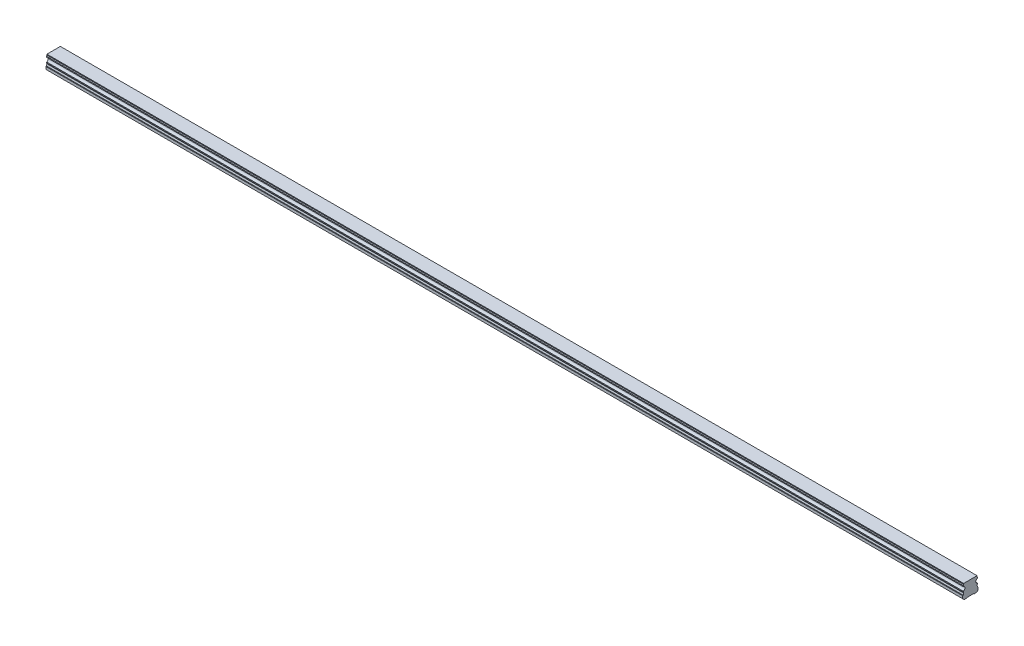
ISO-10303-21;
HEADER;
FILE_DESCRIPTION(('STEP AP214'),'2;1');
FILE_NAME('part.step','',(''),(''),'','','');
FILE_SCHEMA(('AUTOMOTIVE_DESIGN { 1 0 10303 214 1 1 1 1 }'));
ENDSEC;
DATA;
#1=APPLICATION_CONTEXT('core data for automotive mechanical design processes');
#2=APPLICATION_PROTOCOL_DEFINITION('international standard','automotive_design',2000,#1);
#3=PRODUCT_CONTEXT('',#1,'mechanical');
#4=PRODUCT('Part','Part','',(#3));
#5=PRODUCT_RELATED_PRODUCT_CATEGORY('part','',(#4));
#6=PRODUCT_DEFINITION_FORMATION('','',#4);
#7=PRODUCT_DEFINITION_CONTEXT('part definition',#1,'design');
#8=PRODUCT_DEFINITION('design','',#6,#7);
#9=PRODUCT_DEFINITION_SHAPE('','',#8);
#10=(LENGTH_UNIT() NAMED_UNIT(*) SI_UNIT(.MILLI.,.METRE.));
#11=(NAMED_UNIT(*) PLANE_ANGLE_UNIT() SI_UNIT($,.RADIAN.));
#12=(NAMED_UNIT(*) SI_UNIT($,.STERADIAN.) SOLID_ANGLE_UNIT());
#13=UNCERTAINTY_MEASURE_WITH_UNIT(LENGTH_MEASURE(1.E-05),#10,'distance_accuracy_value','');
#14=(GEOMETRIC_REPRESENTATION_CONTEXT(3) GLOBAL_UNCERTAINTY_ASSIGNED_CONTEXT((#13)) GLOBAL_UNIT_ASSIGNED_CONTEXT((#10,
#11,#12)) REPRESENTATION_CONTEXT('',''));
#15=CARTESIAN_POINT('',(0.,0.,0.));
#16=DIRECTION('',(0.,0.,1.));
#17=DIRECTION('',(1.,0.,0.));
#18=AXIS2_PLACEMENT_3D('',#15,#16,#17);
#19=CARTESIAN_POINT('',(870.,0.399999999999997,0.));
#20=DIRECTION('',(0.,-1.,0.));
#21=DIRECTION('',(0.,0.,-1.));
#22=AXIS2_PLACEMENT_3D('',#19,#20,#21);
#23=CONICAL_SURFACE('',#22,2.89999999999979,0.785398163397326);
#24=CARTESIAN_POINT('',(870.,0.799999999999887,0.));
#25=DIRECTION('',(0.,1.,0.));
#26=DIRECTION('',(0.,0.,1.));
#27=AXIS2_PLACEMENT_3D('',#24,#25,#26);
#28=CIRCLE('',#27,2.5);
#29=CARTESIAN_POINT('',(870.,0.799999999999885,-2.5));
#30=VERTEX_POINT('',#29);
#31=EDGE_CURVE('E11',#30,#30,#28,.F.);
#32=CARTESIAN_POINT('',(870.,0.399999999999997,0.));
#33=DIRECTION('',(0.,1.,0.));
#34=DIRECTION('',(0.,0.,1.));
#35=AXIS2_PLACEMENT_3D('',#32,#33,#34);
#36=CIRCLE('',#35,2.8999999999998);
#37=CARTESIAN_POINT('',(870.,0.399999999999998,-2.89999999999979));
#38=VERTEX_POINT('',#37);
#39=EDGE_CURVE('E577',#38,#38,#36,.T.);
#40=CARTESIAN_POINT('',(870.,0.799999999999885,-2.5));
#41=CARTESIAN_POINT('',(870.,0.795833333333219,-2.50416666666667));
#42=CARTESIAN_POINT('',(870.,0.791666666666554,-2.50833333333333));
#43=CARTESIAN_POINT('',(870.,0.783333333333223,-2.51666666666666));
#44=CARTESIAN_POINT('',(870.,0.779166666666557,-2.52083333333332));
#45=CARTESIAN_POINT('',(870.,0.770833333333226,-2.52916666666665));
#46=CARTESIAN_POINT('',(870.,0.766666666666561,-2.53333333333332));
#47=CARTESIAN_POINT('',(870.,0.75833333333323,-2.54166666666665));
#48=CARTESIAN_POINT('',(870.,0.754166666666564,-2.54583333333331));
#49=CARTESIAN_POINT('',(870.,0.745833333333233,-2.55416666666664));
#50=CARTESIAN_POINT('',(870.,0.741666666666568,-2.5583333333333));
#51=CARTESIAN_POINT('',(870.,0.733333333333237,-2.56666666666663));
#52=CARTESIAN_POINT('',(870.,0.729166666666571,-2.5708333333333));
#53=CARTESIAN_POINT('',(870.,0.72083333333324,-2.57916666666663));
#54=CARTESIAN_POINT('',(870.,0.716666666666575,-2.58333333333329));
#55=CARTESIAN_POINT('',(870.,0.708333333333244,-2.59166666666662));
#56=CARTESIAN_POINT('',(870.,0.704166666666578,-2.59583333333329));
#57=CARTESIAN_POINT('',(870.,0.695833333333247,-2.60416666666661));
#58=CARTESIAN_POINT('',(870.,0.691666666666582,-2.60833333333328));
#59=CARTESIAN_POINT('',(870.,0.683333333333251,-2.61666666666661));
#60=CARTESIAN_POINT('',(870.,0.679166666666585,-2.62083333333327));
#61=CARTESIAN_POINT('',(870.,0.670833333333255,-2.6291666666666));
#62=CARTESIAN_POINT('',(870.,0.666666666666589,-2.63333333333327));
#63=CARTESIAN_POINT('',(870.,0.658333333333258,-2.64166666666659));
#64=CARTESIAN_POINT('',(870.,0.654166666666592,-2.64583333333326));
#65=CARTESIAN_POINT('',(870.,0.645833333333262,-2.65416666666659));
#66=CARTESIAN_POINT('',(870.,0.641666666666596,-2.65833333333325));
#67=CARTESIAN_POINT('',(870.,0.633333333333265,-2.66666666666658));
#68=CARTESIAN_POINT('',(870.,0.6291666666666,-2.67083333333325));
#69=CARTESIAN_POINT('',(870.,0.620833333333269,-2.67916666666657));
#70=CARTESIAN_POINT('',(870.,0.616666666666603,-2.68333333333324));
#71=CARTESIAN_POINT('',(870.,0.608333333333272,-2.69166666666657));
#72=CARTESIAN_POINT('',(870.,0.604166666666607,-2.69583333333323));
#73=CARTESIAN_POINT('',(870.,0.595833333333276,-2.70416666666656));
#74=CARTESIAN_POINT('',(870.,0.59166666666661,-2.70833333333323));
#75=CARTESIAN_POINT('',(870.,0.583333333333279,-2.71666666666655));
#76=CARTESIAN_POINT('',(870.,0.579166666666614,-2.72083333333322));
#77=CARTESIAN_POINT('',(870.,0.570833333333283,-2.72916666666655));
#78=CARTESIAN_POINT('',(870.,0.566666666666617,-2.73333333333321));
#79=CARTESIAN_POINT('',(870.,0.558333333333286,-2.74166666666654));
#80=CARTESIAN_POINT('',(870.,0.554166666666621,-2.74583333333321));
#81=CARTESIAN_POINT('',(870.,0.54583333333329,-2.75416666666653));
#82=CARTESIAN_POINT('',(870.,0.541666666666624,-2.7583333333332));
#83=CARTESIAN_POINT('',(870.,0.533333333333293,-2.76666666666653));
#84=CARTESIAN_POINT('',(870.,0.529166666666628,-2.77083333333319));
#85=CARTESIAN_POINT('',(870.,0.520833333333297,-2.77916666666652));
#86=CARTESIAN_POINT('',(870.,0.516666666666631,-2.78333333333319));
#87=CARTESIAN_POINT('',(870.,0.5083333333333,-2.79166666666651));
#88=CARTESIAN_POINT('',(870.,0.504166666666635,-2.79583333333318));
#89=CARTESIAN_POINT('',(870.,0.495833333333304,-2.80416666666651));
#90=CARTESIAN_POINT('',(870.,0.491666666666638,-2.80833333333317));
#91=CARTESIAN_POINT('',(870.,0.483333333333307,-2.8166666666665));
#92=CARTESIAN_POINT('',(870.,0.479166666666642,-2.82083333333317));
#93=CARTESIAN_POINT('',(870.,0.470833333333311,-2.82916666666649));
#94=CARTESIAN_POINT('',(870.,0.466666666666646,-2.83333333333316));
#95=CARTESIAN_POINT('',(870.,0.458333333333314,-2.84166666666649));
#96=CARTESIAN_POINT('',(870.,0.454166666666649,-2.84583333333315));
#97=CARTESIAN_POINT('',(870.,0.445833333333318,-2.85416666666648));
#98=CARTESIAN_POINT('',(870.,0.441666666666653,-2.85833333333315));
#99=CARTESIAN_POINT('',(870.,0.433333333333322,-2.86666666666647));
#100=CARTESIAN_POINT('',(870.,0.429166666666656,-2.87083333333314));
#101=CARTESIAN_POINT('',(870.,0.420833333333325,-2.87916666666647));
#102=CARTESIAN_POINT('',(870.,0.41666666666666,-2.88333333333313));
#103=CARTESIAN_POINT('',(870.,0.408333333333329,-2.89166666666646));
#104=CARTESIAN_POINT('',(870.,0.404166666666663,-2.89583333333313));
#105=CARTESIAN_POINT('',(870.,0.399999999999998,-2.89999999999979));
#106=B_SPLINE_CURVE_WITH_KNOTS('',3,(#40,#41,#42,#43,#44,#45,#46,#47,#48,#49,#50,#51,#52,#53,
#54,#55,#56,#57,#58,#59,#60,#61,#62,#63,#64,#65,#66,#67,#68,#69,#70,#71,#72,#73,#74,#75,#76,#77,
#78,#79,#80,#81,#82,#83,#84,#85,#86,#87,#88,#89,#90,#91,#92,#93,#94,#95,#96,#97,#98,#99,#100,
#101,#102,#103,#104,#105),.UNSPECIFIED.,.F.,.F.,(4,2,2,2,2,2,2,2,2,2,2,2,2,2,2,2,2,2,2,2,2,2,2,
2,2,2,2,2,2,2,2,2,4),(0.,0.0176776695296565,0.0353553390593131,0.0530330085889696,
0.0707106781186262,0.0883883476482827,0.106066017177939,0.123743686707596,0.141421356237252,
0.159099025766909,0.176776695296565,0.194454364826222,0.212132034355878,0.229809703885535,
0.247487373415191,0.265165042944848,0.282842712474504,0.300520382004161,0.318198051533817,
0.335875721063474,0.35355339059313,0.371231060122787,0.388908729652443,0.4065863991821,
0.424264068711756,0.441941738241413,0.459619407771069,0.477297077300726,0.494974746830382,
0.512652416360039,0.530330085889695,0.548007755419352,0.565685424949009),.UNSPECIFIED.);
#107=EDGE_CURVE('BSEAM39',#30,#38,#106,.T.);
#108=ORIENTED_EDGE('',*,*,#31,.F.);
#109=ORIENTED_EDGE('',*,*,#39,.F.);
#110=ORIENTED_EDGE('',*,*,#107,.T.);
#111=ORIENTED_EDGE('',*,*,#107,.F.);
#112=EDGE_LOOP('',(#108,#110,#109,#111));
#113=FACE_BOUND('',#112,.T.);
#114=ADVANCED_FACE('F39',(#113),#23,.F.);
#115=CARTESIAN_POINT('',(870.,7.,0.));
#116=DIRECTION('',(0.,-1.,0.));
#117=DIRECTION('',(0.,0.,-1.));
#118=AXIS2_PLACEMENT_3D('',#115,#116,#117);
#119=CYLINDRICAL_SURFACE('',#118,2.5);
#120=ORIENTED_EDGE('',*,*,#31,.T.);
#121=EDGE_LOOP('',(#120));
#122=FACE_BOUND('',#121,.T.);
#123=CARTESIAN_POINT('',(870.,7.,0.));
#124=DIRECTION('',(0.,-1.,0.));
#125=DIRECTION('',(0.,0.,-1.));
#126=AXIS2_PLACEMENT_3D('',#123,#124,#125);
#127=CIRCLE('',#126,2.5);
#128=CARTESIAN_POINT('',(870.,7.,-2.50000000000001));
#129=VERTEX_POINT('',#128);
#130=EDGE_CURVE('E49',#129,#129,#127,.T.);
#131=ORIENTED_EDGE('',*,*,#130,.F.);
#132=EDGE_LOOP('',(#131));
#133=FACE_BOUND('',#132,.T.);
#134=ADVANCED_FACE('F806',(#122,#133),#119,.F.);
#135=CARTESIAN_POINT('',(870.,7.,0.));
#136=DIRECTION('',(0.,-1.,0.));
#137=DIRECTION('',(0.,0.,-1.));
#138=AXIS2_PLACEMENT_3D('',#135,#136,#137);
#139=PLANE('',#138);
#140=CARTESIAN_POINT('',(870.,7.,0.));
#141=DIRECTION('',(0.,-1.,0.));
#142=DIRECTION('',(0.,0.,-1.));
#143=AXIS2_PLACEMENT_3D('',#140,#141,#142);
#144=CIRCLE('',#143,2.1);
#145=CARTESIAN_POINT('',(870.,7.,-2.1));
#146=VERTEX_POINT('',#145);
#147=EDGE_CURVE('E42',#146,#146,#144,.T.);
#148=ORIENTED_EDGE('',*,*,#147,.F.);
#149=EDGE_LOOP('',(#148));
#150=FACE_BOUND('',#149,.T.);
#151=ORIENTED_EDGE('',*,*,#130,.T.);
#152=EDGE_LOOP('',(#151));
#153=FACE_BOUND('',#152,.T.);
#154=ADVANCED_FACE('F811',(#150,#153),#139,.T.);
#155=CARTESIAN_POINT('',(810.,0.399999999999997,0.));
#156=DIRECTION('',(0.,-1.,0.));
#157=DIRECTION('',(0.,0.,-1.));
#158=AXIS2_PLACEMENT_3D('',#155,#156,#157);
#159=CONICAL_SURFACE('',#158,2.89999999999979,0.785398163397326);
#160=CARTESIAN_POINT('',(810.,0.799999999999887,0.));
#161=DIRECTION('',(0.,1.,0.));
#162=DIRECTION('',(0.,0.,1.));
#163=AXIS2_PLACEMENT_3D('',#160,#161,#162);
#164=CIRCLE('',#163,2.5);
#165=CARTESIAN_POINT('',(810.,0.799999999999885,-2.5));
#166=VERTEX_POINT('',#165);
#167=EDGE_CURVE('E573',#166,#166,#164,.F.);
#168=CARTESIAN_POINT('',(810.,0.399999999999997,0.));
#169=DIRECTION('',(0.,1.,0.));
#170=DIRECTION('',(0.,0.,1.));
#171=AXIS2_PLACEMENT_3D('',#168,#169,#170);
#172=CIRCLE('',#171,2.8999999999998);
#173=CARTESIAN_POINT('',(810.,0.399999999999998,-2.89999999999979));
#174=VERTEX_POINT('',#173);
#175=EDGE_CURVE('E565',#174,#174,#172,.T.);
#176=CARTESIAN_POINT('',(810.,0.799999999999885,-2.5));
#177=CARTESIAN_POINT('',(810.,0.795833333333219,-2.50416666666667));
#178=CARTESIAN_POINT('',(810.,0.791666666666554,-2.50833333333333));
#179=CARTESIAN_POINT('',(810.,0.783333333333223,-2.51666666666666));
#180=CARTESIAN_POINT('',(810.,0.779166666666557,-2.52083333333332));
#181=CARTESIAN_POINT('',(810.,0.770833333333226,-2.52916666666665));
#182=CARTESIAN_POINT('',(810.,0.766666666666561,-2.53333333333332));
#183=CARTESIAN_POINT('',(810.,0.75833333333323,-2.54166666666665));
#184=CARTESIAN_POINT('',(810.,0.754166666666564,-2.54583333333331));
#185=CARTESIAN_POINT('',(810.,0.745833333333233,-2.55416666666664));
#186=CARTESIAN_POINT('',(810.,0.741666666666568,-2.5583333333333));
#187=CARTESIAN_POINT('',(810.,0.733333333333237,-2.56666666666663));
#188=CARTESIAN_POINT('',(810.,0.729166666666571,-2.5708333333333));
#189=CARTESIAN_POINT('',(810.,0.72083333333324,-2.57916666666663));
#190=CARTESIAN_POINT('',(810.,0.716666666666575,-2.58333333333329));
#191=CARTESIAN_POINT('',(810.,0.708333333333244,-2.59166666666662));
#192=CARTESIAN_POINT('',(810.,0.704166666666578,-2.59583333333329));
#193=CARTESIAN_POINT('',(810.,0.695833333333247,-2.60416666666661));
#194=CARTESIAN_POINT('',(810.,0.691666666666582,-2.60833333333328));
#195=CARTESIAN_POINT('',(810.,0.683333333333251,-2.61666666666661));
#196=CARTESIAN_POINT('',(810.,0.679166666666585,-2.62083333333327));
#197=CARTESIAN_POINT('',(810.,0.670833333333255,-2.6291666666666));
#198=CARTESIAN_POINT('',(810.,0.666666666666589,-2.63333333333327));
#199=CARTESIAN_POINT('',(810.,0.658333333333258,-2.64166666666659));
#200=CARTESIAN_POINT('',(810.,0.654166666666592,-2.64583333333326));
#201=CARTESIAN_POINT('',(810.,0.645833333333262,-2.65416666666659));
#202=CARTESIAN_POINT('',(810.,0.641666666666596,-2.65833333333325));
#203=CARTESIAN_POINT('',(810.,0.633333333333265,-2.66666666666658));
#204=CARTESIAN_POINT('',(810.,0.6291666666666,-2.67083333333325));
#205=CARTESIAN_POINT('',(810.,0.620833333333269,-2.67916666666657));
#206=CARTESIAN_POINT('',(810.,0.616666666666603,-2.68333333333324));
#207=CARTESIAN_POINT('',(810.,0.608333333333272,-2.69166666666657));
#208=CARTESIAN_POINT('',(810.,0.604166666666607,-2.69583333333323));
#209=CARTESIAN_POINT('',(810.,0.595833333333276,-2.70416666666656));
#210=CARTESIAN_POINT('',(810.,0.59166666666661,-2.70833333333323));
#211=CARTESIAN_POINT('',(810.,0.583333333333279,-2.71666666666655));
#212=CARTESIAN_POINT('',(810.,0.579166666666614,-2.72083333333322));
#213=CARTESIAN_POINT('',(810.,0.570833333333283,-2.72916666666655));
#214=CARTESIAN_POINT('',(810.,0.566666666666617,-2.73333333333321));
#215=CARTESIAN_POINT('',(810.,0.558333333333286,-2.74166666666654));
#216=CARTESIAN_POINT('',(810.,0.554166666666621,-2.74583333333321));
#217=CARTESIAN_POINT('',(810.,0.54583333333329,-2.75416666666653));
#218=CARTESIAN_POINT('',(810.,0.541666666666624,-2.7583333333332));
#219=CARTESIAN_POINT('',(810.,0.533333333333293,-2.76666666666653));
#220=CARTESIAN_POINT('',(810.,0.529166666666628,-2.77083333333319));
#221=CARTESIAN_POINT('',(810.,0.520833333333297,-2.77916666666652));
#222=CARTESIAN_POINT('',(810.,0.516666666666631,-2.78333333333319));
#223=CARTESIAN_POINT('',(810.,0.5083333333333,-2.79166666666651));
#224=CARTESIAN_POINT('',(810.,0.504166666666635,-2.79583333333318));
#225=CARTESIAN_POINT('',(810.,0.495833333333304,-2.80416666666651));
#226=CARTESIAN_POINT('',(810.,0.491666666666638,-2.80833333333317));
#227=CARTESIAN_POINT('',(810.,0.483333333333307,-2.8166666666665));
#228=CARTESIAN_POINT('',(810.,0.479166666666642,-2.82083333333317));
#229=CARTESIAN_POINT('',(810.,0.470833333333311,-2.82916666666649));
#230=CARTESIAN_POINT('',(810.,0.466666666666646,-2.83333333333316));
#231=CARTESIAN_POINT('',(810.,0.458333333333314,-2.84166666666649));
#232=CARTESIAN_POINT('',(810.,0.454166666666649,-2.84583333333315));
#233=CARTESIAN_POINT('',(810.,0.445833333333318,-2.85416666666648));
#234=CARTESIAN_POINT('',(810.,0.441666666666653,-2.85833333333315));
#235=CARTESIAN_POINT('',(810.,0.433333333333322,-2.86666666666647));
#236=CARTESIAN_POINT('',(810.,0.429166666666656,-2.87083333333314));
#237=CARTESIAN_POINT('',(810.,0.420833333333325,-2.87916666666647));
#238=CARTESIAN_POINT('',(810.,0.41666666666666,-2.88333333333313));
#239=CARTESIAN_POINT('',(810.,0.408333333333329,-2.89166666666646));
#240=CARTESIAN_POINT('',(810.,0.404166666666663,-2.89583333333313));
#241=CARTESIAN_POINT('',(810.,0.399999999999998,-2.89999999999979));
#242=B_SPLINE_CURVE_WITH_KNOTS('',3,(#176,#177,#178,#179,#180,#181,#182,#183,#184,#185,#186,
#187,#188,#189,#190,#191,#192,#193,#194,#195,#196,#197,#198,#199,#200,#201,#202,#203,#204,#205,
#206,#207,#208,#209,#210,#211,#212,#213,#214,#215,#216,#217,#218,#219,#220,#221,#222,#223,#224,
#225,#226,#227,#228,#229,#230,#231,#232,#233,#234,#235,#236,#237,#238,#239,#240,#241),
.UNSPECIFIED.,.F.,.F.,(4,2,2,2,2,2,2,2,2,2,2,2,2,2,2,2,2,2,2,2,2,2,2,2,2,2,2,2,2,2,2,2,4),(0.,
0.0176776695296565,0.0353553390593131,0.0530330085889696,0.0707106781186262,0.0883883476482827,
0.106066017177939,0.123743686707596,0.141421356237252,0.159099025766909,0.176776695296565,
0.194454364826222,0.212132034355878,0.229809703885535,0.247487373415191,0.265165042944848,
0.282842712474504,0.300520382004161,0.318198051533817,0.335875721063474,0.35355339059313,
0.371231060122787,0.388908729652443,0.4065863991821,0.424264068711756,0.441941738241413,
0.459619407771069,0.477297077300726,0.494974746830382,0.512652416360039,0.530330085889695,
0.548007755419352,0.565685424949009),.UNSPECIFIED.);
#243=EDGE_CURVE('BSEAM1030',#166,#174,#242,.T.);
#244=ORIENTED_EDGE('',*,*,#167,.F.);
#245=ORIENTED_EDGE('',*,*,#175,.F.);
#246=ORIENTED_EDGE('',*,*,#243,.T.);
#247=ORIENTED_EDGE('',*,*,#243,.F.);
#248=EDGE_LOOP('',(#244,#246,#245,#247));
#249=FACE_BOUND('',#248,.T.);
#250=ADVANCED_FACE('F1030',(#249),#159,.F.);
#251=CARTESIAN_POINT('',(810.,7.,0.));
#252=DIRECTION('',(0.,-1.,0.));
#253=DIRECTION('',(0.,0.,-1.));
#254=AXIS2_PLACEMENT_3D('',#251,#252,#253);
#255=CYLINDRICAL_SURFACE('',#254,2.5);
#256=ORIENTED_EDGE('',*,*,#167,.T.);
#257=EDGE_LOOP('',(#256));
#258=FACE_BOUND('',#257,.T.);
#259=CARTESIAN_POINT('',(810.,7.,0.));
#260=DIRECTION('',(0.,-1.,0.));
#261=DIRECTION('',(0.,0.,-1.));
#262=AXIS2_PLACEMENT_3D('',#259,#260,#261);
#263=CIRCLE('',#262,2.5);
#264=CARTESIAN_POINT('',(810.,7.,-2.50000000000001));
#265=VERTEX_POINT('',#264);
#266=EDGE_CURVE('E569',#265,#265,#263,.T.);
#267=ORIENTED_EDGE('',*,*,#266,.F.);
#268=EDGE_LOOP('',(#267));
#269=FACE_BOUND('',#268,.T.);
#270=ADVANCED_FACE('F1026',(#258,#269),#255,.F.);
#271=CARTESIAN_POINT('',(810.,7.,0.));
#272=DIRECTION('',(0.,-1.,0.));
#273=DIRECTION('',(0.,0.,-1.));
#274=AXIS2_PLACEMENT_3D('',#271,#272,#273);
#275=PLANE('',#274);
#276=CARTESIAN_POINT('',(810.,7.,0.));
#277=DIRECTION('',(0.,-1.,0.));
#278=DIRECTION('',(0.,0.,-1.));
#279=AXIS2_PLACEMENT_3D('',#276,#277,#278);
#280=CIRCLE('',#279,2.1);
#281=CARTESIAN_POINT('',(810.,7.,-2.1));
#282=VERTEX_POINT('',#281);
#283=EDGE_CURVE('E632',#282,#282,#280,.T.);
#284=ORIENTED_EDGE('',*,*,#283,.F.);
#285=EDGE_LOOP('',(#284));
#286=FACE_BOUND('',#285,.T.);
#287=ORIENTED_EDGE('',*,*,#266,.T.);
#288=EDGE_LOOP('',(#287));
#289=FACE_BOUND('',#288,.T.);
#290=ADVANCED_FACE('F1022',(#286,#289),#275,.T.);
#291=CARTESIAN_POINT('',(750.,0.399999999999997,0.));
#292=DIRECTION('',(0.,-1.,0.));
#293=DIRECTION('',(0.,0.,-1.));
#294=AXIS2_PLACEMENT_3D('',#291,#292,#293);
#295=CONICAL_SURFACE('',#294,2.89999999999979,0.785398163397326);
#296=CARTESIAN_POINT('',(750.,0.799999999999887,0.));
#297=DIRECTION('',(0.,1.,0.));
#298=DIRECTION('',(0.,0.,1.));
#299=AXIS2_PLACEMENT_3D('',#296,#297,#298);
#300=CIRCLE('',#299,2.5);
#301=CARTESIAN_POINT('',(750.,0.799999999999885,-2.5));
#302=VERTEX_POINT('',#301);
#303=EDGE_CURVE('E561',#302,#302,#300,.F.);
#304=CARTESIAN_POINT('',(750.,0.399999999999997,0.));
#305=DIRECTION('',(0.,1.,0.));
#306=DIRECTION('',(0.,0.,1.));
#307=AXIS2_PLACEMENT_3D('',#304,#305,#306);
#308=CIRCLE('',#307,2.8999999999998);
#309=CARTESIAN_POINT('',(750.,0.399999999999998,-2.89999999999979));
#310=VERTEX_POINT('',#309);
#311=EDGE_CURVE('E553',#310,#310,#308,.T.);
#312=CARTESIAN_POINT('',(750.,0.799999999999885,-2.5));
#313=CARTESIAN_POINT('',(750.,0.795833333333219,-2.50416666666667));
#314=CARTESIAN_POINT('',(750.,0.791666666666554,-2.50833333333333));
#315=CARTESIAN_POINT('',(750.,0.783333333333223,-2.51666666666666));
#316=CARTESIAN_POINT('',(750.,0.779166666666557,-2.52083333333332));
#317=CARTESIAN_POINT('',(750.,0.770833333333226,-2.52916666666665));
#318=CARTESIAN_POINT('',(750.,0.766666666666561,-2.53333333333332));
#319=CARTESIAN_POINT('',(750.,0.75833333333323,-2.54166666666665));
#320=CARTESIAN_POINT('',(750.,0.754166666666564,-2.54583333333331));
#321=CARTESIAN_POINT('',(750.,0.745833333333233,-2.55416666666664));
#322=CARTESIAN_POINT('',(750.,0.741666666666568,-2.5583333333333));
#323=CARTESIAN_POINT('',(750.,0.733333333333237,-2.56666666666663));
#324=CARTESIAN_POINT('',(750.,0.729166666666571,-2.5708333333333));
#325=CARTESIAN_POINT('',(750.,0.72083333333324,-2.57916666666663));
#326=CARTESIAN_POINT('',(750.,0.716666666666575,-2.58333333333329));
#327=CARTESIAN_POINT('',(750.,0.708333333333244,-2.59166666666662));
#328=CARTESIAN_POINT('',(750.,0.704166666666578,-2.59583333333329));
#329=CARTESIAN_POINT('',(750.,0.695833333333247,-2.60416666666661));
#330=CARTESIAN_POINT('',(750.,0.691666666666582,-2.60833333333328));
#331=CARTESIAN_POINT('',(750.,0.683333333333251,-2.61666666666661));
#332=CARTESIAN_POINT('',(750.,0.679166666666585,-2.62083333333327));
#333=CARTESIAN_POINT('',(750.,0.670833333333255,-2.6291666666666));
#334=CARTESIAN_POINT('',(750.,0.666666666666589,-2.63333333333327));
#335=CARTESIAN_POINT('',(750.,0.658333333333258,-2.64166666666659));
#336=CARTESIAN_POINT('',(750.,0.654166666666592,-2.64583333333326));
#337=CARTESIAN_POINT('',(750.,0.645833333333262,-2.65416666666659));
#338=CARTESIAN_POINT('',(750.,0.641666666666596,-2.65833333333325));
#339=CARTESIAN_POINT('',(750.,0.633333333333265,-2.66666666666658));
#340=CARTESIAN_POINT('',(750.,0.6291666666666,-2.67083333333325));
#341=CARTESIAN_POINT('',(750.,0.620833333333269,-2.67916666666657));
#342=CARTESIAN_POINT('',(750.,0.616666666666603,-2.68333333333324));
#343=CARTESIAN_POINT('',(750.,0.608333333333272,-2.69166666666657));
#344=CARTESIAN_POINT('',(750.,0.604166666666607,-2.69583333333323));
#345=CARTESIAN_POINT('',(750.,0.595833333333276,-2.70416666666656));
#346=CARTESIAN_POINT('',(750.,0.59166666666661,-2.70833333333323));
#347=CARTESIAN_POINT('',(750.,0.583333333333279,-2.71666666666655));
#348=CARTESIAN_POINT('',(750.,0.579166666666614,-2.72083333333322));
#349=CARTESIAN_POINT('',(750.,0.570833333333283,-2.72916666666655));
#350=CARTESIAN_POINT('',(750.,0.566666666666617,-2.73333333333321));
#351=CARTESIAN_POINT('',(750.,0.558333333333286,-2.74166666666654));
#352=CARTESIAN_POINT('',(750.,0.554166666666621,-2.74583333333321));
#353=CARTESIAN_POINT('',(750.,0.54583333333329,-2.75416666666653));
#354=CARTESIAN_POINT('',(750.,0.541666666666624,-2.7583333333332));
#355=CARTESIAN_POINT('',(750.,0.533333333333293,-2.76666666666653));
#356=CARTESIAN_POINT('',(750.,0.529166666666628,-2.77083333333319));
#357=CARTESIAN_POINT('',(750.,0.520833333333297,-2.77916666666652));
#358=CARTESIAN_POINT('',(750.,0.516666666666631,-2.78333333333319));
#359=CARTESIAN_POINT('',(750.,0.5083333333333,-2.79166666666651));
#360=CARTESIAN_POINT('',(750.,0.504166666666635,-2.79583333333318));
#361=CARTESIAN_POINT('',(750.,0.495833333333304,-2.80416666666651));
#362=CARTESIAN_POINT('',(750.,0.491666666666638,-2.80833333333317));
#363=CARTESIAN_POINT('',(750.,0.483333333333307,-2.8166666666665));
#364=CARTESIAN_POINT('',(750.,0.479166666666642,-2.82083333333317));
#365=CARTESIAN_POINT('',(750.,0.470833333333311,-2.82916666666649));
#366=CARTESIAN_POINT('',(750.,0.466666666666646,-2.83333333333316));
#367=CARTESIAN_POINT('',(750.,0.458333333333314,-2.84166666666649));
#368=CARTESIAN_POINT('',(750.,0.454166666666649,-2.84583333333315));
#369=CARTESIAN_POINT('',(750.,0.445833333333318,-2.85416666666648));
#370=CARTESIAN_POINT('',(750.,0.441666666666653,-2.85833333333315));
#371=CARTESIAN_POINT('',(750.,0.433333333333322,-2.86666666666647));
#372=CARTESIAN_POINT('',(750.,0.429166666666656,-2.87083333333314));
#373=CARTESIAN_POINT('',(750.,0.420833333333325,-2.87916666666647));
#374=CARTESIAN_POINT('',(750.,0.41666666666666,-2.88333333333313));
#375=CARTESIAN_POINT('',(750.,0.408333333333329,-2.89166666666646));
#376=CARTESIAN_POINT('',(750.,0.404166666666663,-2.89583333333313));
#377=CARTESIAN_POINT('',(750.,0.399999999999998,-2.89999999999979));
#378=B_SPLINE_CURVE_WITH_KNOTS('',3,(#312,#313,#314,#315,#316,#317,#318,#319,#320,#321,#322,
#323,#324,#325,#326,#327,#328,#329,#330,#331,#332,#333,#334,#335,#336,#337,#338,#339,#340,#341,
#342,#343,#344,#345,#346,#347,#348,#349,#350,#351,#352,#353,#354,#355,#356,#357,#358,#359,#360,
#361,#362,#363,#364,#365,#366,#367,#368,#369,#370,#371,#372,#373,#374,#375,#376,#377),
.UNSPECIFIED.,.F.,.F.,(4,2,2,2,2,2,2,2,2,2,2,2,2,2,2,2,2,2,2,2,2,2,2,2,2,2,2,2,2,2,2,2,4),(0.,
0.0176776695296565,0.0353553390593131,0.0530330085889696,0.0707106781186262,0.0883883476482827,
0.106066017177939,0.123743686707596,0.141421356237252,0.159099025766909,0.176776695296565,
0.194454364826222,0.212132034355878,0.229809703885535,0.247487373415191,0.265165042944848,
0.282842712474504,0.300520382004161,0.318198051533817,0.335875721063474,0.35355339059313,
0.371231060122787,0.388908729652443,0.4065863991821,0.424264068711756,0.441941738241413,
0.459619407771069,0.477297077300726,0.494974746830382,0.512652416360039,0.530330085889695,
0.548007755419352,0.565685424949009),.UNSPECIFIED.);
#379=EDGE_CURVE('BSEAM1018',#302,#310,#378,.T.);
#380=ORIENTED_EDGE('',*,*,#303,.F.);
#381=ORIENTED_EDGE('',*,*,#311,.F.);
#382=ORIENTED_EDGE('',*,*,#379,.T.);
#383=ORIENTED_EDGE('',*,*,#379,.F.);
#384=EDGE_LOOP('',(#380,#382,#381,#383));
#385=FACE_BOUND('',#384,.T.);
#386=ADVANCED_FACE('F1018',(#385),#295,.F.);
#387=CARTESIAN_POINT('',(750.,7.,0.));
#388=DIRECTION('',(0.,-1.,0.));
#389=DIRECTION('',(0.,0.,-1.));
#390=AXIS2_PLACEMENT_3D('',#387,#388,#389);
#391=CYLINDRICAL_SURFACE('',#390,2.5);
#392=ORIENTED_EDGE('',*,*,#303,.T.);
#393=EDGE_LOOP('',(#392));
#394=FACE_BOUND('',#393,.T.);
#395=CARTESIAN_POINT('',(750.,7.,0.));
#396=DIRECTION('',(0.,-1.,0.));
#397=DIRECTION('',(0.,0.,-1.));
#398=AXIS2_PLACEMENT_3D('',#395,#396,#397);
#399=CIRCLE('',#398,2.5);
#400=CARTESIAN_POINT('',(750.,7.,-2.50000000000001));
#401=VERTEX_POINT('',#400);
#402=EDGE_CURVE('E557',#401,#401,#399,.T.);
#403=ORIENTED_EDGE('',*,*,#402,.F.);
#404=EDGE_LOOP('',(#403));
#405=FACE_BOUND('',#404,.T.);
#406=ADVANCED_FACE('F1014',(#394,#405),#391,.F.);
#407=CARTESIAN_POINT('',(750.,7.,0.));
#408=DIRECTION('',(0.,-1.,0.));
#409=DIRECTION('',(0.,0.,-1.));
#410=AXIS2_PLACEMENT_3D('',#407,#408,#409);
#411=PLANE('',#410);
#412=CARTESIAN_POINT('',(750.,7.,0.));
#413=DIRECTION('',(0.,-1.,0.));
#414=DIRECTION('',(0.,0.,-1.));
#415=AXIS2_PLACEMENT_3D('',#412,#413,#414);
#416=CIRCLE('',#415,2.1);
#417=CARTESIAN_POINT('',(750.,7.,-2.1));
#418=VERTEX_POINT('',#417);
#419=EDGE_CURVE('E629',#418,#418,#416,.T.);
#420=ORIENTED_EDGE('',*,*,#419,.F.);
#421=EDGE_LOOP('',(#420));
#422=FACE_BOUND('',#421,.T.);
#423=ORIENTED_EDGE('',*,*,#402,.T.);
#424=EDGE_LOOP('',(#423));
#425=FACE_BOUND('',#424,.T.);
#426=ADVANCED_FACE('F1010',(#422,#425),#411,.T.);
#427=CARTESIAN_POINT('',(690.,0.399999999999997,0.));
#428=DIRECTION('',(0.,-1.,0.));
#429=DIRECTION('',(0.,0.,-1.));
#430=AXIS2_PLACEMENT_3D('',#427,#428,#429);
#431=CONICAL_SURFACE('',#430,2.89999999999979,0.785398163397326);
#432=CARTESIAN_POINT('',(690.,0.799999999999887,0.));
#433=DIRECTION('',(0.,1.,0.));
#434=DIRECTION('',(0.,0.,1.));
#435=AXIS2_PLACEMENT_3D('',#432,#433,#434);
#436=CIRCLE('',#435,2.5);
#437=CARTESIAN_POINT('',(690.,0.799999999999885,-2.5));
#438=VERTEX_POINT('',#437);
#439=EDGE_CURVE('E549',#438,#438,#436,.F.);
#440=CARTESIAN_POINT('',(690.,0.399999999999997,0.));
#441=DIRECTION('',(0.,1.,0.));
#442=DIRECTION('',(0.,0.,1.));
#443=AXIS2_PLACEMENT_3D('',#440,#441,#442);
#444=CIRCLE('',#443,2.8999999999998);
#445=CARTESIAN_POINT('',(690.,0.399999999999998,-2.89999999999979));
#446=VERTEX_POINT('',#445);
#447=EDGE_CURVE('E541',#446,#446,#444,.T.);
#448=CARTESIAN_POINT('',(690.,0.799999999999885,-2.5));
#449=CARTESIAN_POINT('',(690.,0.795833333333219,-2.50416666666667));
#450=CARTESIAN_POINT('',(690.,0.791666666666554,-2.50833333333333));
#451=CARTESIAN_POINT('',(690.,0.783333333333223,-2.51666666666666));
#452=CARTESIAN_POINT('',(690.,0.779166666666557,-2.52083333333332));
#453=CARTESIAN_POINT('',(690.,0.770833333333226,-2.52916666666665));
#454=CARTESIAN_POINT('',(690.,0.766666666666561,-2.53333333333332));
#455=CARTESIAN_POINT('',(690.,0.75833333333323,-2.54166666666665));
#456=CARTESIAN_POINT('',(690.,0.754166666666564,-2.54583333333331));
#457=CARTESIAN_POINT('',(690.,0.745833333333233,-2.55416666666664));
#458=CARTESIAN_POINT('',(690.,0.741666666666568,-2.5583333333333));
#459=CARTESIAN_POINT('',(690.,0.733333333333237,-2.56666666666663));
#460=CARTESIAN_POINT('',(690.,0.729166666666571,-2.5708333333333));
#461=CARTESIAN_POINT('',(690.,0.72083333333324,-2.57916666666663));
#462=CARTESIAN_POINT('',(690.,0.716666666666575,-2.58333333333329));
#463=CARTESIAN_POINT('',(690.,0.708333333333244,-2.59166666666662));
#464=CARTESIAN_POINT('',(690.,0.704166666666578,-2.59583333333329));
#465=CARTESIAN_POINT('',(690.,0.695833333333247,-2.60416666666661));
#466=CARTESIAN_POINT('',(690.,0.691666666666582,-2.60833333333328));
#467=CARTESIAN_POINT('',(690.,0.683333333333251,-2.61666666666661));
#468=CARTESIAN_POINT('',(690.,0.679166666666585,-2.62083333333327));
#469=CARTESIAN_POINT('',(690.,0.670833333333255,-2.6291666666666));
#470=CARTESIAN_POINT('',(690.,0.666666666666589,-2.63333333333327));
#471=CARTESIAN_POINT('',(690.,0.658333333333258,-2.64166666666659));
#472=CARTESIAN_POINT('',(690.,0.654166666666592,-2.64583333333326));
#473=CARTESIAN_POINT('',(690.,0.645833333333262,-2.65416666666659));
#474=CARTESIAN_POINT('',(690.,0.641666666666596,-2.65833333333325));
#475=CARTESIAN_POINT('',(690.,0.633333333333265,-2.66666666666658));
#476=CARTESIAN_POINT('',(690.,0.6291666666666,-2.67083333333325));
#477=CARTESIAN_POINT('',(690.,0.620833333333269,-2.67916666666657));
#478=CARTESIAN_POINT('',(690.,0.616666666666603,-2.68333333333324));
#479=CARTESIAN_POINT('',(690.,0.608333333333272,-2.69166666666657));
#480=CARTESIAN_POINT('',(690.,0.604166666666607,-2.69583333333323));
#481=CARTESIAN_POINT('',(690.,0.595833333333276,-2.70416666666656));
#482=CARTESIAN_POINT('',(690.,0.59166666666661,-2.70833333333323));
#483=CARTESIAN_POINT('',(690.,0.583333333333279,-2.71666666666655));
#484=CARTESIAN_POINT('',(690.,0.579166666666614,-2.72083333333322));
#485=CARTESIAN_POINT('',(690.,0.570833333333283,-2.72916666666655));
#486=CARTESIAN_POINT('',(690.,0.566666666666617,-2.73333333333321));
#487=CARTESIAN_POINT('',(690.,0.558333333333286,-2.74166666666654));
#488=CARTESIAN_POINT('',(690.,0.554166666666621,-2.74583333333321));
#489=CARTESIAN_POINT('',(690.,0.54583333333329,-2.75416666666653));
#490=CARTESIAN_POINT('',(690.,0.541666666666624,-2.7583333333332));
#491=CARTESIAN_POINT('',(690.,0.533333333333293,-2.76666666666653));
#492=CARTESIAN_POINT('',(690.,0.529166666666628,-2.77083333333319));
#493=CARTESIAN_POINT('',(690.,0.520833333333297,-2.77916666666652));
#494=CARTESIAN_POINT('',(690.,0.516666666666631,-2.78333333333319));
#495=CARTESIAN_POINT('',(690.,0.5083333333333,-2.79166666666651));
#496=CARTESIAN_POINT('',(690.,0.504166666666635,-2.79583333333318));
#497=CARTESIAN_POINT('',(690.,0.495833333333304,-2.80416666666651));
#498=CARTESIAN_POINT('',(690.,0.491666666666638,-2.80833333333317));
#499=CARTESIAN_POINT('',(690.,0.483333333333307,-2.8166666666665));
#500=CARTESIAN_POINT('',(690.,0.479166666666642,-2.82083333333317));
#501=CARTESIAN_POINT('',(690.,0.470833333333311,-2.82916666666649));
#502=CARTESIAN_POINT('',(690.,0.466666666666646,-2.83333333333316));
#503=CARTESIAN_POINT('',(690.,0.458333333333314,-2.84166666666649));
#504=CARTESIAN_POINT('',(690.,0.454166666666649,-2.84583333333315));
#505=CARTESIAN_POINT('',(690.,0.445833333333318,-2.85416666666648));
#506=CARTESIAN_POINT('',(690.,0.441666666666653,-2.85833333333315));
#507=CARTESIAN_POINT('',(690.,0.433333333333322,-2.86666666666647));
#508=CARTESIAN_POINT('',(690.,0.429166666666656,-2.87083333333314));
#509=CARTESIAN_POINT('',(690.,0.420833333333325,-2.87916666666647));
#510=CARTESIAN_POINT('',(690.,0.41666666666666,-2.88333333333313));
#511=CARTESIAN_POINT('',(690.,0.408333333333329,-2.89166666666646));
#512=CARTESIAN_POINT('',(690.,0.404166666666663,-2.89583333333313));
#513=CARTESIAN_POINT('',(690.,0.399999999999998,-2.89999999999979));
#514=B_SPLINE_CURVE_WITH_KNOTS('',3,(#448,#449,#450,#451,#452,#453,#454,#455,#456,#457,#458,
#459,#460,#461,#462,#463,#464,#465,#466,#467,#468,#469,#470,#471,#472,#473,#474,#475,#476,#477,
#478,#479,#480,#481,#482,#483,#484,#485,#486,#487,#488,#489,#490,#491,#492,#493,#494,#495,#496,
#497,#498,#499,#500,#501,#502,#503,#504,#505,#506,#507,#508,#509,#510,#511,#512,#513),
.UNSPECIFIED.,.F.,.F.,(4,2,2,2,2,2,2,2,2,2,2,2,2,2,2,2,2,2,2,2,2,2,2,2,2,2,2,2,2,2,2,2,4),(0.,
0.0176776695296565,0.0353553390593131,0.0530330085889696,0.0707106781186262,0.0883883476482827,
0.106066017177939,0.123743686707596,0.141421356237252,0.159099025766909,0.176776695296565,
0.194454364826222,0.212132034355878,0.229809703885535,0.247487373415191,0.265165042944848,
0.282842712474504,0.300520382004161,0.318198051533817,0.335875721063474,0.35355339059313,
0.371231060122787,0.388908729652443,0.4065863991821,0.424264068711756,0.441941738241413,
0.459619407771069,0.477297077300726,0.494974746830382,0.512652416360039,0.530330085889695,
0.548007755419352,0.565685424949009),.UNSPECIFIED.);
#515=EDGE_CURVE('BSEAM1006',#438,#446,#514,.T.);
#516=ORIENTED_EDGE('',*,*,#439,.F.);
#517=ORIENTED_EDGE('',*,*,#447,.F.);
#518=ORIENTED_EDGE('',*,*,#515,.T.);
#519=ORIENTED_EDGE('',*,*,#515,.F.);
#520=EDGE_LOOP('',(#516,#518,#517,#519));
#521=FACE_BOUND('',#520,.T.);
#522=ADVANCED_FACE('F1006',(#521),#431,.F.);
#523=CARTESIAN_POINT('',(690.,7.,0.));
#524=DIRECTION('',(0.,-1.,0.));
#525=DIRECTION('',(0.,0.,-1.));
#526=AXIS2_PLACEMENT_3D('',#523,#524,#525);
#527=CYLINDRICAL_SURFACE('',#526,2.5);
#528=ORIENTED_EDGE('',*,*,#439,.T.);
#529=EDGE_LOOP('',(#528));
#530=FACE_BOUND('',#529,.T.);
#531=CARTESIAN_POINT('',(690.,7.,0.));
#532=DIRECTION('',(0.,-1.,0.));
#533=DIRECTION('',(0.,0.,-1.));
#534=AXIS2_PLACEMENT_3D('',#531,#532,#533);
#535=CIRCLE('',#534,2.5);
#536=CARTESIAN_POINT('',(690.,7.,-2.50000000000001));
#537=VERTEX_POINT('',#536);
#538=EDGE_CURVE('E545',#537,#537,#535,.T.);
#539=ORIENTED_EDGE('',*,*,#538,.F.);
#540=EDGE_LOOP('',(#539));
#541=FACE_BOUND('',#540,.T.);
#542=ADVANCED_FACE('F1002',(#530,#541),#527,.F.);
#543=CARTESIAN_POINT('',(690.,7.,0.));
#544=DIRECTION('',(0.,-1.,0.));
#545=DIRECTION('',(0.,0.,-1.));
#546=AXIS2_PLACEMENT_3D('',#543,#544,#545);
#547=PLANE('',#546);
#548=CARTESIAN_POINT('',(690.,7.,0.));
#549=DIRECTION('',(0.,-1.,0.));
#550=DIRECTION('',(0.,0.,-1.));
#551=AXIS2_PLACEMENT_3D('',#548,#549,#550);
#552=CIRCLE('',#551,2.1);
#553=CARTESIAN_POINT('',(690.,7.,-2.1));
#554=VERTEX_POINT('',#553);
#555=EDGE_CURVE('E625',#554,#554,#552,.T.);
#556=ORIENTED_EDGE('',*,*,#555,.F.);
#557=EDGE_LOOP('',(#556));
#558=FACE_BOUND('',#557,.T.);
#559=ORIENTED_EDGE('',*,*,#538,.T.);
#560=EDGE_LOOP('',(#559));
#561=FACE_BOUND('',#560,.T.);
#562=ADVANCED_FACE('F998',(#558,#561),#547,.T.);
#563=CARTESIAN_POINT('',(630.,0.399999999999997,0.));
#564=DIRECTION('',(0.,-1.,0.));
#565=DIRECTION('',(0.,0.,-1.));
#566=AXIS2_PLACEMENT_3D('',#563,#564,#565);
#567=CONICAL_SURFACE('',#566,2.89999999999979,0.785398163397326);
#568=CARTESIAN_POINT('',(630.,0.799999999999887,0.));
#569=DIRECTION('',(0.,1.,0.));
#570=DIRECTION('',(0.,0.,1.));
#571=AXIS2_PLACEMENT_3D('',#568,#569,#570);
#572=CIRCLE('',#571,2.5);
#573=CARTESIAN_POINT('',(630.,0.799999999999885,-2.5));
#574=VERTEX_POINT('',#573);
#575=EDGE_CURVE('E537',#574,#574,#572,.F.);
#576=CARTESIAN_POINT('',(630.,0.399999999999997,0.));
#577=DIRECTION('',(0.,1.,0.));
#578=DIRECTION('',(0.,0.,1.));
#579=AXIS2_PLACEMENT_3D('',#576,#577,#578);
#580=CIRCLE('',#579,2.8999999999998);
#581=CARTESIAN_POINT('',(630.,0.399999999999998,-2.89999999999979));
#582=VERTEX_POINT('',#581);
#583=EDGE_CURVE('E529',#582,#582,#580,.T.);
#584=CARTESIAN_POINT('',(630.,0.799999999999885,-2.5));
#585=CARTESIAN_POINT('',(630.,0.795833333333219,-2.50416666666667));
#586=CARTESIAN_POINT('',(630.,0.791666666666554,-2.50833333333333));
#587=CARTESIAN_POINT('',(630.,0.783333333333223,-2.51666666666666));
#588=CARTESIAN_POINT('',(630.,0.779166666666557,-2.52083333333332));
#589=CARTESIAN_POINT('',(630.,0.770833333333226,-2.52916666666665));
#590=CARTESIAN_POINT('',(630.,0.766666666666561,-2.53333333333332));
#591=CARTESIAN_POINT('',(630.,0.75833333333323,-2.54166666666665));
#592=CARTESIAN_POINT('',(630.,0.754166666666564,-2.54583333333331));
#593=CARTESIAN_POINT('',(630.,0.745833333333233,-2.55416666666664));
#594=CARTESIAN_POINT('',(630.,0.741666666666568,-2.5583333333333));
#595=CARTESIAN_POINT('',(630.,0.733333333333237,-2.56666666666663));
#596=CARTESIAN_POINT('',(630.,0.729166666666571,-2.5708333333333));
#597=CARTESIAN_POINT('',(630.,0.72083333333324,-2.57916666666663));
#598=CARTESIAN_POINT('',(630.,0.716666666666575,-2.58333333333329));
#599=CARTESIAN_POINT('',(630.,0.708333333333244,-2.59166666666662));
#600=CARTESIAN_POINT('',(630.,0.704166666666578,-2.59583333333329));
#601=CARTESIAN_POINT('',(630.,0.695833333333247,-2.60416666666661));
#602=CARTESIAN_POINT('',(630.,0.691666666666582,-2.60833333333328));
#603=CARTESIAN_POINT('',(630.,0.683333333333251,-2.61666666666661));
#604=CARTESIAN_POINT('',(630.,0.679166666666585,-2.62083333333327));
#605=CARTESIAN_POINT('',(630.,0.670833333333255,-2.6291666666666));
#606=CARTESIAN_POINT('',(630.,0.666666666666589,-2.63333333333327));
#607=CARTESIAN_POINT('',(630.,0.658333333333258,-2.64166666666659));
#608=CARTESIAN_POINT('',(630.,0.654166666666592,-2.64583333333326));
#609=CARTESIAN_POINT('',(630.,0.645833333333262,-2.65416666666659));
#610=CARTESIAN_POINT('',(630.,0.641666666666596,-2.65833333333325));
#611=CARTESIAN_POINT('',(630.,0.633333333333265,-2.66666666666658));
#612=CARTESIAN_POINT('',(630.,0.6291666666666,-2.67083333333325));
#613=CARTESIAN_POINT('',(630.,0.620833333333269,-2.67916666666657));
#614=CARTESIAN_POINT('',(630.,0.616666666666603,-2.68333333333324));
#615=CARTESIAN_POINT('',(630.,0.608333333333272,-2.69166666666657));
#616=CARTESIAN_POINT('',(630.,0.604166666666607,-2.69583333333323));
#617=CARTESIAN_POINT('',(630.,0.595833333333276,-2.70416666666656));
#618=CARTESIAN_POINT('',(630.,0.59166666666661,-2.70833333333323));
#619=CARTESIAN_POINT('',(630.,0.583333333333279,-2.71666666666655));
#620=CARTESIAN_POINT('',(630.,0.579166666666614,-2.72083333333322));
#621=CARTESIAN_POINT('',(630.,0.570833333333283,-2.72916666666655));
#622=CARTESIAN_POINT('',(630.,0.566666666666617,-2.73333333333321));
#623=CARTESIAN_POINT('',(630.,0.558333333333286,-2.74166666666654));
#624=CARTESIAN_POINT('',(630.,0.554166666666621,-2.74583333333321));
#625=CARTESIAN_POINT('',(630.,0.54583333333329,-2.75416666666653));
#626=CARTESIAN_POINT('',(630.,0.541666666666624,-2.7583333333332));
#627=CARTESIAN_POINT('',(630.,0.533333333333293,-2.76666666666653));
#628=CARTESIAN_POINT('',(630.,0.529166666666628,-2.77083333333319));
#629=CARTESIAN_POINT('',(630.,0.520833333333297,-2.77916666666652));
#630=CARTESIAN_POINT('',(630.,0.516666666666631,-2.78333333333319));
#631=CARTESIAN_POINT('',(630.,0.5083333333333,-2.79166666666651));
#632=CARTESIAN_POINT('',(630.,0.504166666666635,-2.79583333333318));
#633=CARTESIAN_POINT('',(630.,0.495833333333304,-2.80416666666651));
#634=CARTESIAN_POINT('',(630.,0.491666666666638,-2.80833333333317));
#635=CARTESIAN_POINT('',(630.,0.483333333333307,-2.8166666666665));
#636=CARTESIAN_POINT('',(630.,0.479166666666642,-2.82083333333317));
#637=CARTESIAN_POINT('',(630.,0.470833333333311,-2.82916666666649));
#638=CARTESIAN_POINT('',(630.,0.466666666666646,-2.83333333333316));
#639=CARTESIAN_POINT('',(630.,0.458333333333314,-2.84166666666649));
#640=CARTESIAN_POINT('',(630.,0.454166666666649,-2.84583333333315));
#641=CARTESIAN_POINT('',(630.,0.445833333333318,-2.85416666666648));
#642=CARTESIAN_POINT('',(630.,0.441666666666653,-2.85833333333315));
#643=CARTESIAN_POINT('',(630.,0.433333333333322,-2.86666666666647));
#644=CARTESIAN_POINT('',(630.,0.429166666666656,-2.87083333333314));
#645=CARTESIAN_POINT('',(630.,0.420833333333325,-2.87916666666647));
#646=CARTESIAN_POINT('',(630.,0.41666666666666,-2.88333333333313));
#647=CARTESIAN_POINT('',(630.,0.408333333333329,-2.89166666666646));
#648=CARTESIAN_POINT('',(630.,0.404166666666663,-2.89583333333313));
#649=CARTESIAN_POINT('',(630.,0.399999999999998,-2.89999999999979));
#650=B_SPLINE_CURVE_WITH_KNOTS('',3,(#584,#585,#586,#587,#588,#589,#590,#591,#592,#593,#594,
#595,#596,#597,#598,#599,#600,#601,#602,#603,#604,#605,#606,#607,#608,#609,#610,#611,#612,#613,
#614,#615,#616,#617,#618,#619,#620,#621,#622,#623,#624,#625,#626,#627,#628,#629,#630,#631,#632,
#633,#634,#635,#636,#637,#638,#639,#640,#641,#642,#643,#644,#645,#646,#647,#648,#649),
.UNSPECIFIED.,.F.,.F.,(4,2,2,2,2,2,2,2,2,2,2,2,2,2,2,2,2,2,2,2,2,2,2,2,2,2,2,2,2,2,2,2,4),(0.,
0.0176776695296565,0.0353553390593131,0.0530330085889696,0.0707106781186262,0.0883883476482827,
0.106066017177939,0.123743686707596,0.141421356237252,0.159099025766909,0.176776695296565,
0.194454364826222,0.212132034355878,0.229809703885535,0.247487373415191,0.265165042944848,
0.282842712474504,0.300520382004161,0.318198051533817,0.335875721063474,0.35355339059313,
0.371231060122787,0.388908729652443,0.4065863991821,0.424264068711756,0.441941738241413,
0.459619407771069,0.477297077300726,0.494974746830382,0.512652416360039,0.530330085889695,
0.548007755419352,0.565685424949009),.UNSPECIFIED.);
#651=EDGE_CURVE('BSEAM994',#574,#582,#650,.T.);
#652=ORIENTED_EDGE('',*,*,#575,.F.);
#653=ORIENTED_EDGE('',*,*,#583,.F.);
#654=ORIENTED_EDGE('',*,*,#651,.T.);
#655=ORIENTED_EDGE('',*,*,#651,.F.);
#656=EDGE_LOOP('',(#652,#654,#653,#655));
#657=FACE_BOUND('',#656,.T.);
#658=ADVANCED_FACE('F994',(#657),#567,.F.);
#659=CARTESIAN_POINT('',(630.,7.,0.));
#660=DIRECTION('',(0.,-1.,0.));
#661=DIRECTION('',(0.,0.,-1.));
#662=AXIS2_PLACEMENT_3D('',#659,#660,#661);
#663=CYLINDRICAL_SURFACE('',#662,2.5);
#664=ORIENTED_EDGE('',*,*,#575,.T.);
#665=EDGE_LOOP('',(#664));
#666=FACE_BOUND('',#665,.T.);
#667=CARTESIAN_POINT('',(630.,7.,0.));
#668=DIRECTION('',(0.,-1.,0.));
#669=DIRECTION('',(0.,0.,-1.));
#670=AXIS2_PLACEMENT_3D('',#667,#668,#669);
#671=CIRCLE('',#670,2.5);
#672=CARTESIAN_POINT('',(630.,7.,-2.50000000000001));
#673=VERTEX_POINT('',#672);
#674=EDGE_CURVE('E533',#673,#673,#671,.T.);
#675=ORIENTED_EDGE('',*,*,#674,.F.);
#676=EDGE_LOOP('',(#675));
#677=FACE_BOUND('',#676,.T.);
#678=ADVANCED_FACE('F990',(#666,#677),#663,.F.);
#679=CARTESIAN_POINT('',(630.,7.,0.));
#680=DIRECTION('',(0.,-1.,0.));
#681=DIRECTION('',(0.,0.,-1.));
#682=AXIS2_PLACEMENT_3D('',#679,#680,#681);
#683=PLANE('',#682);
#684=CARTESIAN_POINT('',(630.,7.,0.));
#685=DIRECTION('',(0.,-1.,0.));
#686=DIRECTION('',(0.,0.,-1.));
#687=AXIS2_PLACEMENT_3D('',#684,#685,#686);
#688=CIRCLE('',#687,2.1);
#689=CARTESIAN_POINT('',(630.,7.,-2.1));
#690=VERTEX_POINT('',#689);
#691=EDGE_CURVE('E621',#690,#690,#688,.T.);
#692=ORIENTED_EDGE('',*,*,#691,.F.);
#693=EDGE_LOOP('',(#692));
#694=FACE_BOUND('',#693,.T.);
#695=ORIENTED_EDGE('',*,*,#674,.T.);
#696=EDGE_LOOP('',(#695));
#697=FACE_BOUND('',#696,.T.);
#698=ADVANCED_FACE('F986',(#694,#697),#683,.T.);
#699=CARTESIAN_POINT('',(570.,0.399999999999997,0.));
#700=DIRECTION('',(0.,-1.,0.));
#701=DIRECTION('',(0.,0.,-1.));
#702=AXIS2_PLACEMENT_3D('',#699,#700,#701);
#703=CONICAL_SURFACE('',#702,2.89999999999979,0.785398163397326);
#704=CARTESIAN_POINT('',(570.,0.799999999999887,0.));
#705=DIRECTION('',(0.,1.,0.));
#706=DIRECTION('',(0.,0.,1.));
#707=AXIS2_PLACEMENT_3D('',#704,#705,#706);
#708=CIRCLE('',#707,2.5);
#709=CARTESIAN_POINT('',(570.,0.799999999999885,-2.5));
#710=VERTEX_POINT('',#709);
#711=EDGE_CURVE('E525',#710,#710,#708,.F.);
#712=CARTESIAN_POINT('',(570.,0.399999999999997,0.));
#713=DIRECTION('',(0.,1.,0.));
#714=DIRECTION('',(0.,0.,1.));
#715=AXIS2_PLACEMENT_3D('',#712,#713,#714);
#716=CIRCLE('',#715,2.8999999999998);
#717=CARTESIAN_POINT('',(570.,0.399999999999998,-2.89999999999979));
#718=VERTEX_POINT('',#717);
#719=EDGE_CURVE('E517',#718,#718,#716,.T.);
#720=CARTESIAN_POINT('',(570.,0.799999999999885,-2.5));
#721=CARTESIAN_POINT('',(570.,0.795833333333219,-2.50416666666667));
#722=CARTESIAN_POINT('',(570.,0.791666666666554,-2.50833333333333));
#723=CARTESIAN_POINT('',(570.,0.783333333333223,-2.51666666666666));
#724=CARTESIAN_POINT('',(570.,0.779166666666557,-2.52083333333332));
#725=CARTESIAN_POINT('',(570.,0.770833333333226,-2.52916666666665));
#726=CARTESIAN_POINT('',(570.,0.766666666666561,-2.53333333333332));
#727=CARTESIAN_POINT('',(570.,0.75833333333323,-2.54166666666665));
#728=CARTESIAN_POINT('',(570.,0.754166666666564,-2.54583333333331));
#729=CARTESIAN_POINT('',(570.,0.745833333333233,-2.55416666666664));
#730=CARTESIAN_POINT('',(570.,0.741666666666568,-2.5583333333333));
#731=CARTESIAN_POINT('',(570.,0.733333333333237,-2.56666666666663));
#732=CARTESIAN_POINT('',(570.,0.729166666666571,-2.5708333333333));
#733=CARTESIAN_POINT('',(570.,0.72083333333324,-2.57916666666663));
#734=CARTESIAN_POINT('',(570.,0.716666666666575,-2.58333333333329));
#735=CARTESIAN_POINT('',(570.,0.708333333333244,-2.59166666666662));
#736=CARTESIAN_POINT('',(570.,0.704166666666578,-2.59583333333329));
#737=CARTESIAN_POINT('',(570.,0.695833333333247,-2.60416666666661));
#738=CARTESIAN_POINT('',(570.,0.691666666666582,-2.60833333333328));
#739=CARTESIAN_POINT('',(570.,0.683333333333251,-2.61666666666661));
#740=CARTESIAN_POINT('',(570.,0.679166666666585,-2.62083333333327));
#741=CARTESIAN_POINT('',(570.,0.670833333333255,-2.6291666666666));
#742=CARTESIAN_POINT('',(570.,0.666666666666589,-2.63333333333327));
#743=CARTESIAN_POINT('',(570.,0.658333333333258,-2.64166666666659));
#744=CARTESIAN_POINT('',(570.,0.654166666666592,-2.64583333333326));
#745=CARTESIAN_POINT('',(570.,0.645833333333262,-2.65416666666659));
#746=CARTESIAN_POINT('',(570.,0.641666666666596,-2.65833333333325));
#747=CARTESIAN_POINT('',(570.,0.633333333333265,-2.66666666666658));
#748=CARTESIAN_POINT('',(570.,0.6291666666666,-2.67083333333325));
#749=CARTESIAN_POINT('',(570.,0.620833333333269,-2.67916666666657));
#750=CARTESIAN_POINT('',(570.,0.616666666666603,-2.68333333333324));
#751=CARTESIAN_POINT('',(570.,0.608333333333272,-2.69166666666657));
#752=CARTESIAN_POINT('',(570.,0.604166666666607,-2.69583333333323));
#753=CARTESIAN_POINT('',(570.,0.595833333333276,-2.70416666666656));
#754=CARTESIAN_POINT('',(570.,0.59166666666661,-2.70833333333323));
#755=CARTESIAN_POINT('',(570.,0.583333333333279,-2.71666666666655));
#756=CARTESIAN_POINT('',(570.,0.579166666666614,-2.72083333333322));
#757=CARTESIAN_POINT('',(570.,0.570833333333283,-2.72916666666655));
#758=CARTESIAN_POINT('',(570.,0.566666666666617,-2.73333333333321));
#759=CARTESIAN_POINT('',(570.,0.558333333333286,-2.74166666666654));
#760=CARTESIAN_POINT('',(570.,0.554166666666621,-2.74583333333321));
#761=CARTESIAN_POINT('',(570.,0.54583333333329,-2.75416666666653));
#762=CARTESIAN_POINT('',(570.,0.541666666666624,-2.7583333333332));
#763=CARTESIAN_POINT('',(570.,0.533333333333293,-2.76666666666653));
#764=CARTESIAN_POINT('',(570.,0.529166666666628,-2.77083333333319));
#765=CARTESIAN_POINT('',(570.,0.520833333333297,-2.77916666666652));
#766=CARTESIAN_POINT('',(570.,0.516666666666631,-2.78333333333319));
#767=CARTESIAN_POINT('',(570.,0.5083333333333,-2.79166666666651));
#768=CARTESIAN_POINT('',(570.,0.504166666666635,-2.79583333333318));
#769=CARTESIAN_POINT('',(570.,0.495833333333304,-2.80416666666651));
#770=CARTESIAN_POINT('',(570.,0.491666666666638,-2.80833333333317));
#771=CARTESIAN_POINT('',(570.,0.483333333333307,-2.8166666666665));
#772=CARTESIAN_POINT('',(570.,0.479166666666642,-2.82083333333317));
#773=CARTESIAN_POINT('',(570.,0.470833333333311,-2.82916666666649));
#774=CARTESIAN_POINT('',(570.,0.466666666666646,-2.83333333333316));
#775=CARTESIAN_POINT('',(570.,0.458333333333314,-2.84166666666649));
#776=CARTESIAN_POINT('',(570.,0.454166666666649,-2.84583333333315));
#777=CARTESIAN_POINT('',(570.,0.445833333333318,-2.85416666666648));
#778=CARTESIAN_POINT('',(570.,0.441666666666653,-2.85833333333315));
#779=CARTESIAN_POINT('',(570.,0.433333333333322,-2.86666666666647));
#780=CARTESIAN_POINT('',(570.,0.429166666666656,-2.87083333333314));
#781=CARTESIAN_POINT('',(570.,0.420833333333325,-2.87916666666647));
#782=CARTESIAN_POINT('',(570.,0.41666666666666,-2.88333333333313));
#783=CARTESIAN_POINT('',(570.,0.408333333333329,-2.89166666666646));
#784=CARTESIAN_POINT('',(570.,0.404166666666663,-2.89583333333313));
#785=CARTESIAN_POINT('',(570.,0.399999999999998,-2.89999999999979));
#786=B_SPLINE_CURVE_WITH_KNOTS('',3,(#720,#721,#722,#723,#724,#725,#726,#727,#728,#729,#730,
#731,#732,#733,#734,#735,#736,#737,#738,#739,#740,#741,#742,#743,#744,#745,#746,#747,#748,#749,
#750,#751,#752,#753,#754,#755,#756,#757,#758,#759,#760,#761,#762,#763,#764,#765,#766,#767,#768,
#769,#770,#771,#772,#773,#774,#775,#776,#777,#778,#779,#780,#781,#782,#783,#784,#785),
.UNSPECIFIED.,.F.,.F.,(4,2,2,2,2,2,2,2,2,2,2,2,2,2,2,2,2,2,2,2,2,2,2,2,2,2,2,2,2,2,2,2,4),(0.,
0.0176776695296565,0.0353553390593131,0.0530330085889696,0.0707106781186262,0.0883883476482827,
0.106066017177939,0.123743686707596,0.141421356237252,0.159099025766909,0.176776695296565,
0.194454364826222,0.212132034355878,0.229809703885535,0.247487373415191,0.265165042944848,
0.282842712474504,0.300520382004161,0.318198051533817,0.335875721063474,0.35355339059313,
0.371231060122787,0.388908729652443,0.4065863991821,0.424264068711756,0.441941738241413,
0.459619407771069,0.477297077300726,0.494974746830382,0.512652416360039,0.530330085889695,
0.548007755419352,0.565685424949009),.UNSPECIFIED.);
#787=EDGE_CURVE('BSEAM982',#710,#718,#786,.T.);
#788=ORIENTED_EDGE('',*,*,#711,.F.);
#789=ORIENTED_EDGE('',*,*,#719,.F.);
#790=ORIENTED_EDGE('',*,*,#787,.T.);
#791=ORIENTED_EDGE('',*,*,#787,.F.);
#792=EDGE_LOOP('',(#788,#790,#789,#791));
#793=FACE_BOUND('',#792,.T.);
#794=ADVANCED_FACE('F982',(#793),#703,.F.);
#795=CARTESIAN_POINT('',(570.,7.,0.));
#796=DIRECTION('',(0.,-1.,0.));
#797=DIRECTION('',(0.,0.,-1.));
#798=AXIS2_PLACEMENT_3D('',#795,#796,#797);
#799=CYLINDRICAL_SURFACE('',#798,2.5);
#800=ORIENTED_EDGE('',*,*,#711,.T.);
#801=EDGE_LOOP('',(#800));
#802=FACE_BOUND('',#801,.T.);
#803=CARTESIAN_POINT('',(570.,7.,0.));
#804=DIRECTION('',(0.,-1.,0.));
#805=DIRECTION('',(0.,0.,-1.));
#806=AXIS2_PLACEMENT_3D('',#803,#804,#805);
#807=CIRCLE('',#806,2.5);
#808=CARTESIAN_POINT('',(570.,7.,-2.50000000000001));
#809=VERTEX_POINT('',#808);
#810=EDGE_CURVE('E521',#809,#809,#807,.T.);
#811=ORIENTED_EDGE('',*,*,#810,.F.);
#812=EDGE_LOOP('',(#811));
#813=FACE_BOUND('',#812,.T.);
#814=ADVANCED_FACE('F978',(#802,#813),#799,.F.);
#815=CARTESIAN_POINT('',(570.,7.,0.));
#816=DIRECTION('',(0.,-1.,0.));
#817=DIRECTION('',(0.,0.,-1.));
#818=AXIS2_PLACEMENT_3D('',#815,#816,#817);
#819=PLANE('',#818);
#820=CARTESIAN_POINT('',(570.,7.,0.));
#821=DIRECTION('',(0.,-1.,0.));
#822=DIRECTION('',(0.,0.,-1.));
#823=AXIS2_PLACEMENT_3D('',#820,#821,#822);
#824=CIRCLE('',#823,2.1);
#825=CARTESIAN_POINT('',(570.,7.,-2.1));
#826=VERTEX_POINT('',#825);
#827=EDGE_CURVE('E617',#826,#826,#824,.T.);
#828=ORIENTED_EDGE('',*,*,#827,.F.);
#829=EDGE_LOOP('',(#828));
#830=FACE_BOUND('',#829,.T.);
#831=ORIENTED_EDGE('',*,*,#810,.T.);
#832=EDGE_LOOP('',(#831));
#833=FACE_BOUND('',#832,.T.);
#834=ADVANCED_FACE('F974',(#830,#833),#819,.T.);
#835=CARTESIAN_POINT('',(510.,0.399999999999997,0.));
#836=DIRECTION('',(0.,-1.,0.));
#837=DIRECTION('',(0.,0.,-1.));
#838=AXIS2_PLACEMENT_3D('',#835,#836,#837);
#839=CONICAL_SURFACE('',#838,2.89999999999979,0.785398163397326);
#840=CARTESIAN_POINT('',(510.,0.799999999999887,0.));
#841=DIRECTION('',(0.,1.,0.));
#842=DIRECTION('',(0.,0.,1.));
#843=AXIS2_PLACEMENT_3D('',#840,#841,#842);
#844=CIRCLE('',#843,2.5);
#845=CARTESIAN_POINT('',(510.,0.799999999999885,-2.5));
#846=VERTEX_POINT('',#845);
#847=EDGE_CURVE('E513',#846,#846,#844,.F.);
#848=CARTESIAN_POINT('',(510.,0.399999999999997,0.));
#849=DIRECTION('',(0.,1.,0.));
#850=DIRECTION('',(0.,0.,1.));
#851=AXIS2_PLACEMENT_3D('',#848,#849,#850);
#852=CIRCLE('',#851,2.8999999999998);
#853=CARTESIAN_POINT('',(510.,0.399999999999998,-2.89999999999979));
#854=VERTEX_POINT('',#853);
#855=EDGE_CURVE('E505',#854,#854,#852,.T.);
#856=CARTESIAN_POINT('',(510.,0.799999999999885,-2.5));
#857=CARTESIAN_POINT('',(510.,0.795833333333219,-2.50416666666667));
#858=CARTESIAN_POINT('',(510.,0.791666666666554,-2.50833333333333));
#859=CARTESIAN_POINT('',(510.,0.783333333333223,-2.51666666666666));
#860=CARTESIAN_POINT('',(510.,0.779166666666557,-2.52083333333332));
#861=CARTESIAN_POINT('',(510.,0.770833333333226,-2.52916666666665));
#862=CARTESIAN_POINT('',(510.,0.766666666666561,-2.53333333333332));
#863=CARTESIAN_POINT('',(510.,0.75833333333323,-2.54166666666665));
#864=CARTESIAN_POINT('',(510.,0.754166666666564,-2.54583333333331));
#865=CARTESIAN_POINT('',(510.,0.745833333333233,-2.55416666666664));
#866=CARTESIAN_POINT('',(510.,0.741666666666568,-2.5583333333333));
#867=CARTESIAN_POINT('',(510.,0.733333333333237,-2.56666666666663));
#868=CARTESIAN_POINT('',(510.,0.729166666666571,-2.5708333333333));
#869=CARTESIAN_POINT('',(510.,0.72083333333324,-2.57916666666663));
#870=CARTESIAN_POINT('',(510.,0.716666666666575,-2.58333333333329));
#871=CARTESIAN_POINT('',(510.,0.708333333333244,-2.59166666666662));
#872=CARTESIAN_POINT('',(510.,0.704166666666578,-2.59583333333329));
#873=CARTESIAN_POINT('',(510.,0.695833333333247,-2.60416666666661));
#874=CARTESIAN_POINT('',(510.,0.691666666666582,-2.60833333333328));
#875=CARTESIAN_POINT('',(510.,0.683333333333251,-2.61666666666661));
#876=CARTESIAN_POINT('',(510.,0.679166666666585,-2.62083333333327));
#877=CARTESIAN_POINT('',(510.,0.670833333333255,-2.6291666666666));
#878=CARTESIAN_POINT('',(510.,0.666666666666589,-2.63333333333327));
#879=CARTESIAN_POINT('',(510.,0.658333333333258,-2.64166666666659));
#880=CARTESIAN_POINT('',(510.,0.654166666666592,-2.64583333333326));
#881=CARTESIAN_POINT('',(510.,0.645833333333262,-2.65416666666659));
#882=CARTESIAN_POINT('',(510.,0.641666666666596,-2.65833333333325));
#883=CARTESIAN_POINT('',(510.,0.633333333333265,-2.66666666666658));
#884=CARTESIAN_POINT('',(510.,0.6291666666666,-2.67083333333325));
#885=CARTESIAN_POINT('',(510.,0.620833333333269,-2.67916666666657));
#886=CARTESIAN_POINT('',(510.,0.616666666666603,-2.68333333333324));
#887=CARTESIAN_POINT('',(510.,0.608333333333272,-2.69166666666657));
#888=CARTESIAN_POINT('',(510.,0.604166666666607,-2.69583333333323));
#889=CARTESIAN_POINT('',(510.,0.595833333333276,-2.70416666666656));
#890=CARTESIAN_POINT('',(510.,0.59166666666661,-2.70833333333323));
#891=CARTESIAN_POINT('',(510.,0.583333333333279,-2.71666666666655));
#892=CARTESIAN_POINT('',(510.,0.579166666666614,-2.72083333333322));
#893=CARTESIAN_POINT('',(510.,0.570833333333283,-2.72916666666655));
#894=CARTESIAN_POINT('',(510.,0.566666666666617,-2.73333333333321));
#895=CARTESIAN_POINT('',(510.,0.558333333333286,-2.74166666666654));
#896=CARTESIAN_POINT('',(510.,0.554166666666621,-2.74583333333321));
#897=CARTESIAN_POINT('',(510.,0.54583333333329,-2.75416666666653));
#898=CARTESIAN_POINT('',(510.,0.541666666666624,-2.7583333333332));
#899=CARTESIAN_POINT('',(510.,0.533333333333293,-2.76666666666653));
#900=CARTESIAN_POINT('',(510.,0.529166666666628,-2.77083333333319));
#901=CARTESIAN_POINT('',(510.,0.520833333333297,-2.77916666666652));
#902=CARTESIAN_POINT('',(510.,0.516666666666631,-2.78333333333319));
#903=CARTESIAN_POINT('',(510.,0.5083333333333,-2.79166666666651));
#904=CARTESIAN_POINT('',(510.,0.504166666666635,-2.79583333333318));
#905=CARTESIAN_POINT('',(510.,0.495833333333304,-2.80416666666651));
#906=CARTESIAN_POINT('',(510.,0.491666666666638,-2.80833333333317));
#907=CARTESIAN_POINT('',(510.,0.483333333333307,-2.8166666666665));
#908=CARTESIAN_POINT('',(510.,0.479166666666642,-2.82083333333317));
#909=CARTESIAN_POINT('',(510.,0.470833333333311,-2.82916666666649));
#910=CARTESIAN_POINT('',(510.,0.466666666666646,-2.83333333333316));
#911=CARTESIAN_POINT('',(510.,0.458333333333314,-2.84166666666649));
#912=CARTESIAN_POINT('',(510.,0.454166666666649,-2.84583333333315));
#913=CARTESIAN_POINT('',(510.,0.445833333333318,-2.85416666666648));
#914=CARTESIAN_POINT('',(510.,0.441666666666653,-2.85833333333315));
#915=CARTESIAN_POINT('',(510.,0.433333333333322,-2.86666666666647));
#916=CARTESIAN_POINT('',(510.,0.429166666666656,-2.87083333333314));
#917=CARTESIAN_POINT('',(510.,0.420833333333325,-2.87916666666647));
#918=CARTESIAN_POINT('',(510.,0.41666666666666,-2.88333333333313));
#919=CARTESIAN_POINT('',(510.,0.408333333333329,-2.89166666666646));
#920=CARTESIAN_POINT('',(510.,0.404166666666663,-2.89583333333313));
#921=CARTESIAN_POINT('',(510.,0.399999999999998,-2.89999999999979));
#922=B_SPLINE_CURVE_WITH_KNOTS('',3,(#856,#857,#858,#859,#860,#861,#862,#863,#864,#865,#866,
#867,#868,#869,#870,#871,#872,#873,#874,#875,#876,#877,#878,#879,#880,#881,#882,#883,#884,#885,
#886,#887,#888,#889,#890,#891,#892,#893,#894,#895,#896,#897,#898,#899,#900,#901,#902,#903,#904,
#905,#906,#907,#908,#909,#910,#911,#912,#913,#914,#915,#916,#917,#918,#919,#920,#921),
.UNSPECIFIED.,.F.,.F.,(4,2,2,2,2,2,2,2,2,2,2,2,2,2,2,2,2,2,2,2,2,2,2,2,2,2,2,2,2,2,2,2,4),(0.,
0.0176776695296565,0.0353553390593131,0.0530330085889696,0.0707106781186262,0.0883883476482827,
0.106066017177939,0.123743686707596,0.141421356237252,0.159099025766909,0.176776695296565,
0.194454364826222,0.212132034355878,0.229809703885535,0.247487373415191,0.265165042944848,
0.282842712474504,0.300520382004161,0.318198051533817,0.335875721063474,0.35355339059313,
0.371231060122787,0.388908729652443,0.4065863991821,0.424264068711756,0.441941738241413,
0.459619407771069,0.477297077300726,0.494974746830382,0.512652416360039,0.530330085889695,
0.548007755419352,0.565685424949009),.UNSPECIFIED.);
#923=EDGE_CURVE('BSEAM970',#846,#854,#922,.T.);
#924=ORIENTED_EDGE('',*,*,#847,.F.);
#925=ORIENTED_EDGE('',*,*,#855,.F.);
#926=ORIENTED_EDGE('',*,*,#923,.T.);
#927=ORIENTED_EDGE('',*,*,#923,.F.);
#928=EDGE_LOOP('',(#924,#926,#925,#927));
#929=FACE_BOUND('',#928,.T.);
#930=ADVANCED_FACE('F970',(#929),#839,.F.);
#931=CARTESIAN_POINT('',(510.,7.,0.));
#932=DIRECTION('',(0.,-1.,0.));
#933=DIRECTION('',(0.,0.,-1.));
#934=AXIS2_PLACEMENT_3D('',#931,#932,#933);
#935=CYLINDRICAL_SURFACE('',#934,2.5);
#936=ORIENTED_EDGE('',*,*,#847,.T.);
#937=EDGE_LOOP('',(#936));
#938=FACE_BOUND('',#937,.T.);
#939=CARTESIAN_POINT('',(510.,7.,0.));
#940=DIRECTION('',(0.,-1.,0.));
#941=DIRECTION('',(0.,0.,-1.));
#942=AXIS2_PLACEMENT_3D('',#939,#940,#941);
#943=CIRCLE('',#942,2.5);
#944=CARTESIAN_POINT('',(510.,7.,-2.50000000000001));
#945=VERTEX_POINT('',#944);
#946=EDGE_CURVE('E509',#945,#945,#943,.T.);
#947=ORIENTED_EDGE('',*,*,#946,.F.);
#948=EDGE_LOOP('',(#947));
#949=FACE_BOUND('',#948,.T.);
#950=ADVANCED_FACE('F966',(#938,#949),#935,.F.);
#951=CARTESIAN_POINT('',(510.,7.,0.));
#952=DIRECTION('',(0.,-1.,0.));
#953=DIRECTION('',(0.,0.,-1.));
#954=AXIS2_PLACEMENT_3D('',#951,#952,#953);
#955=PLANE('',#954);
#956=CARTESIAN_POINT('',(510.,7.,0.));
#957=DIRECTION('',(0.,-1.,0.));
#958=DIRECTION('',(0.,0.,-1.));
#959=AXIS2_PLACEMENT_3D('',#956,#957,#958);
#960=CIRCLE('',#959,2.1);
#961=CARTESIAN_POINT('',(510.,7.,-2.1));
#962=VERTEX_POINT('',#961);
#963=EDGE_CURVE('E613',#962,#962,#960,.T.);
#964=ORIENTED_EDGE('',*,*,#963,.F.);
#965=EDGE_LOOP('',(#964));
#966=FACE_BOUND('',#965,.T.);
#967=ORIENTED_EDGE('',*,*,#946,.T.);
#968=EDGE_LOOP('',(#967));
#969=FACE_BOUND('',#968,.T.);
#970=ADVANCED_FACE('F962',(#966,#969),#955,.T.);
#971=CARTESIAN_POINT('',(450.,0.399999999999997,0.));
#972=DIRECTION('',(0.,-1.,0.));
#973=DIRECTION('',(0.,0.,-1.));
#974=AXIS2_PLACEMENT_3D('',#971,#972,#973);
#975=CONICAL_SURFACE('',#974,2.89999999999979,0.785398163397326);
#976=CARTESIAN_POINT('',(450.,0.799999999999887,0.));
#977=DIRECTION('',(0.,1.,0.));
#978=DIRECTION('',(0.,0.,1.));
#979=AXIS2_PLACEMENT_3D('',#976,#977,#978);
#980=CIRCLE('',#979,2.5);
#981=CARTESIAN_POINT('',(450.,0.799999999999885,-2.5));
#982=VERTEX_POINT('',#981);
#983=EDGE_CURVE('E501',#982,#982,#980,.F.);
#984=CARTESIAN_POINT('',(450.,0.399999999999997,0.));
#985=DIRECTION('',(0.,1.,0.));
#986=DIRECTION('',(0.,0.,1.));
#987=AXIS2_PLACEMENT_3D('',#984,#985,#986);
#988=CIRCLE('',#987,2.8999999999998);
#989=CARTESIAN_POINT('',(450.,0.399999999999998,-2.89999999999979));
#990=VERTEX_POINT('',#989);
#991=EDGE_CURVE('E493',#990,#990,#988,.T.);
#992=CARTESIAN_POINT('',(450.,0.799999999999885,-2.5));
#993=CARTESIAN_POINT('',(450.,0.795833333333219,-2.50416666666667));
#994=CARTESIAN_POINT('',(450.,0.791666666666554,-2.50833333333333));
#995=CARTESIAN_POINT('',(450.,0.783333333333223,-2.51666666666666));
#996=CARTESIAN_POINT('',(450.,0.779166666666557,-2.52083333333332));
#997=CARTESIAN_POINT('',(450.,0.770833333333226,-2.52916666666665));
#998=CARTESIAN_POINT('',(450.,0.766666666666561,-2.53333333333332));
#999=CARTESIAN_POINT('',(450.,0.75833333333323,-2.54166666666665));
#1000=CARTESIAN_POINT('',(450.,0.754166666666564,-2.54583333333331));
#1001=CARTESIAN_POINT('',(450.,0.745833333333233,-2.55416666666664));
#1002=CARTESIAN_POINT('',(450.,0.741666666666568,-2.5583333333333));
#1003=CARTESIAN_POINT('',(450.,0.733333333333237,-2.56666666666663));
#1004=CARTESIAN_POINT('',(450.,0.729166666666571,-2.5708333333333));
#1005=CARTESIAN_POINT('',(450.,0.72083333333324,-2.57916666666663));
#1006=CARTESIAN_POINT('',(450.,0.716666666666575,-2.58333333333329));
#1007=CARTESIAN_POINT('',(450.,0.708333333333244,-2.59166666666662));
#1008=CARTESIAN_POINT('',(450.,0.704166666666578,-2.59583333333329));
#1009=CARTESIAN_POINT('',(450.,0.695833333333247,-2.60416666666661));
#1010=CARTESIAN_POINT('',(450.,0.691666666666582,-2.60833333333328));
#1011=CARTESIAN_POINT('',(450.,0.683333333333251,-2.61666666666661));
#1012=CARTESIAN_POINT('',(450.,0.679166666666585,-2.62083333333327));
#1013=CARTESIAN_POINT('',(450.,0.670833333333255,-2.6291666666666));
#1014=CARTESIAN_POINT('',(450.,0.666666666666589,-2.63333333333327));
#1015=CARTESIAN_POINT('',(450.,0.658333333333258,-2.64166666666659));
#1016=CARTESIAN_POINT('',(450.,0.654166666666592,-2.64583333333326));
#1017=CARTESIAN_POINT('',(450.,0.645833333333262,-2.65416666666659));
#1018=CARTESIAN_POINT('',(450.,0.641666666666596,-2.65833333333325));
#1019=CARTESIAN_POINT('',(450.,0.633333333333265,-2.66666666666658));
#1020=CARTESIAN_POINT('',(450.,0.6291666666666,-2.67083333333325));
#1021=CARTESIAN_POINT('',(450.,0.620833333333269,-2.67916666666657));
#1022=CARTESIAN_POINT('',(450.,0.616666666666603,-2.68333333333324));
#1023=CARTESIAN_POINT('',(450.,0.608333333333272,-2.69166666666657));
#1024=CARTESIAN_POINT('',(450.,0.604166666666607,-2.69583333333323));
#1025=CARTESIAN_POINT('',(450.,0.595833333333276,-2.70416666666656));
#1026=CARTESIAN_POINT('',(450.,0.59166666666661,-2.70833333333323));
#1027=CARTESIAN_POINT('',(450.,0.583333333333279,-2.71666666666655));
#1028=CARTESIAN_POINT('',(450.,0.579166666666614,-2.72083333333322));
#1029=CARTESIAN_POINT('',(450.,0.570833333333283,-2.72916666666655));
#1030=CARTESIAN_POINT('',(450.,0.566666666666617,-2.73333333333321));
#1031=CARTESIAN_POINT('',(450.,0.558333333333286,-2.74166666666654));
#1032=CARTESIAN_POINT('',(450.,0.554166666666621,-2.74583333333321));
#1033=CARTESIAN_POINT('',(450.,0.54583333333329,-2.75416666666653));
#1034=CARTESIAN_POINT('',(450.,0.541666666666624,-2.7583333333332));
#1035=CARTESIAN_POINT('',(450.,0.533333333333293,-2.76666666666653));
#1036=CARTESIAN_POINT('',(450.,0.529166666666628,-2.77083333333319));
#1037=CARTESIAN_POINT('',(450.,0.520833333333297,-2.77916666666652));
#1038=CARTESIAN_POINT('',(450.,0.516666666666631,-2.78333333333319));
#1039=CARTESIAN_POINT('',(450.,0.5083333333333,-2.79166666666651));
#1040=CARTESIAN_POINT('',(450.,0.504166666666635,-2.79583333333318));
#1041=CARTESIAN_POINT('',(450.,0.495833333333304,-2.80416666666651));
#1042=CARTESIAN_POINT('',(450.,0.491666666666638,-2.80833333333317));
#1043=CARTESIAN_POINT('',(450.,0.483333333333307,-2.8166666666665));
#1044=CARTESIAN_POINT('',(450.,0.479166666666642,-2.82083333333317));
#1045=CARTESIAN_POINT('',(450.,0.470833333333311,-2.82916666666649));
#1046=CARTESIAN_POINT('',(450.,0.466666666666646,-2.83333333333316));
#1047=CARTESIAN_POINT('',(450.,0.458333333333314,-2.84166666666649));
#1048=CARTESIAN_POINT('',(450.,0.454166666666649,-2.84583333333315));
#1049=CARTESIAN_POINT('',(450.,0.445833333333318,-2.85416666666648));
#1050=CARTESIAN_POINT('',(450.,0.441666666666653,-2.85833333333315));
#1051=CARTESIAN_POINT('',(450.,0.433333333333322,-2.86666666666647));
#1052=CARTESIAN_POINT('',(450.,0.429166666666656,-2.87083333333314));
#1053=CARTESIAN_POINT('',(450.,0.420833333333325,-2.87916666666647));
#1054=CARTESIAN_POINT('',(450.,0.41666666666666,-2.88333333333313));
#1055=CARTESIAN_POINT('',(450.,0.408333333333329,-2.89166666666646));
#1056=CARTESIAN_POINT('',(450.,0.404166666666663,-2.89583333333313));
#1057=CARTESIAN_POINT('',(450.,0.399999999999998,-2.89999999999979));
#1058=B_SPLINE_CURVE_WITH_KNOTS('',3,(#992,#993,#994,#995,#996,#997,#998,#999,#1000,#1001,#1002,
#1003,#1004,#1005,#1006,#1007,#1008,#1009,#1010,#1011,#1012,#1013,#1014,#1015,#1016,#1017,#1018,
#1019,#1020,#1021,#1022,#1023,#1024,#1025,#1026,#1027,#1028,#1029,#1030,#1031,#1032,#1033,#1034,
#1035,#1036,#1037,#1038,#1039,#1040,#1041,#1042,#1043,#1044,#1045,#1046,#1047,#1048,#1049,#1050,
#1051,#1052,#1053,#1054,#1055,#1056,#1057),.UNSPECIFIED.,.F.,.F.,(4,2,2,2,2,2,2,2,2,2,2,2,2,2,2,
2,2,2,2,2,2,2,2,2,2,2,2,2,2,2,2,2,4),(0.,0.0176776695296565,0.0353553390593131,
0.0530330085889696,0.0707106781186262,0.0883883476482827,0.106066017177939,0.123743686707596,
0.141421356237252,0.159099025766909,0.176776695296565,0.194454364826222,0.212132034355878,
0.229809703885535,0.247487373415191,0.265165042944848,0.282842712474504,0.300520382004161,
0.318198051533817,0.335875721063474,0.35355339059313,0.371231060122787,0.388908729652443,
0.4065863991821,0.424264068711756,0.441941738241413,0.459619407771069,0.477297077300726,
0.494974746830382,0.512652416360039,0.530330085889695,0.548007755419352,0.565685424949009),.UNSPECIFIED.);
#1059=EDGE_CURVE('BSEAM958',#982,#990,#1058,.T.);
#1060=ORIENTED_EDGE('',*,*,#983,.F.);
#1061=ORIENTED_EDGE('',*,*,#991,.F.);
#1062=ORIENTED_EDGE('',*,*,#1059,.T.);
#1063=ORIENTED_EDGE('',*,*,#1059,.F.);
#1064=EDGE_LOOP('',(#1060,#1062,#1061,#1063));
#1065=FACE_BOUND('',#1064,.T.);
#1066=ADVANCED_FACE('F958',(#1065),#975,.F.);
#1067=CARTESIAN_POINT('',(450.,7.,0.));
#1068=DIRECTION('',(0.,-1.,0.));
#1069=DIRECTION('',(0.,0.,-1.));
#1070=AXIS2_PLACEMENT_3D('',#1067,#1068,#1069);
#1071=CYLINDRICAL_SURFACE('',#1070,2.5);
#1072=ORIENTED_EDGE('',*,*,#983,.T.);
#1073=EDGE_LOOP('',(#1072));
#1074=FACE_BOUND('',#1073,.T.);
#1075=CARTESIAN_POINT('',(450.,7.,0.));
#1076=DIRECTION('',(0.,-1.,0.));
#1077=DIRECTION('',(0.,0.,-1.));
#1078=AXIS2_PLACEMENT_3D('',#1075,#1076,#1077);
#1079=CIRCLE('',#1078,2.5);
#1080=CARTESIAN_POINT('',(450.,7.,-2.50000000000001));
#1081=VERTEX_POINT('',#1080);
#1082=EDGE_CURVE('E497',#1081,#1081,#1079,.T.);
#1083=ORIENTED_EDGE('',*,*,#1082,.F.);
#1084=EDGE_LOOP('',(#1083));
#1085=FACE_BOUND('',#1084,.T.);
#1086=ADVANCED_FACE('F954',(#1074,#1085),#1071,.F.);
#1087=CARTESIAN_POINT('',(450.,7.,0.));
#1088=DIRECTION('',(0.,-1.,0.));
#1089=DIRECTION('',(0.,0.,-1.));
#1090=AXIS2_PLACEMENT_3D('',#1087,#1088,#1089);
#1091=PLANE('',#1090);
#1092=CARTESIAN_POINT('',(450.,7.,0.));
#1093=DIRECTION('',(0.,-1.,0.));
#1094=DIRECTION('',(0.,0.,-1.));
#1095=AXIS2_PLACEMENT_3D('',#1092,#1093,#1094);
#1096=CIRCLE('',#1095,2.1);
#1097=CARTESIAN_POINT('',(450.,7.,-2.1));
#1098=VERTEX_POINT('',#1097);
#1099=EDGE_CURVE('E609',#1098,#1098,#1096,.T.);
#1100=ORIENTED_EDGE('',*,*,#1099,.F.);
#1101=EDGE_LOOP('',(#1100));
#1102=FACE_BOUND('',#1101,.T.);
#1103=ORIENTED_EDGE('',*,*,#1082,.T.);
#1104=EDGE_LOOP('',(#1103));
#1105=FACE_BOUND('',#1104,.T.);
#1106=ADVANCED_FACE('F950',(#1102,#1105),#1091,.T.);
#1107=CARTESIAN_POINT('',(390.,0.399999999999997,0.));
#1108=DIRECTION('',(0.,-1.,0.));
#1109=DIRECTION('',(0.,0.,-1.));
#1110=AXIS2_PLACEMENT_3D('',#1107,#1108,#1109);
#1111=CONICAL_SURFACE('',#1110,2.89999999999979,0.785398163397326);
#1112=CARTESIAN_POINT('',(390.,0.799999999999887,0.));
#1113=DIRECTION('',(0.,1.,0.));
#1114=DIRECTION('',(0.,0.,1.));
#1115=AXIS2_PLACEMENT_3D('',#1112,#1113,#1114);
#1116=CIRCLE('',#1115,2.5);
#1117=CARTESIAN_POINT('',(390.,0.799999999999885,-2.5));
#1118=VERTEX_POINT('',#1117);
#1119=EDGE_CURVE('E489',#1118,#1118,#1116,.F.);
#1120=CARTESIAN_POINT('',(390.,0.399999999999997,0.));
#1121=DIRECTION('',(0.,1.,0.));
#1122=DIRECTION('',(0.,0.,1.));
#1123=AXIS2_PLACEMENT_3D('',#1120,#1121,#1122);
#1124=CIRCLE('',#1123,2.8999999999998);
#1125=CARTESIAN_POINT('',(390.,0.399999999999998,-2.89999999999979));
#1126=VERTEX_POINT('',#1125);
#1127=EDGE_CURVE('E481',#1126,#1126,#1124,.T.);
#1128=CARTESIAN_POINT('',(390.,0.799999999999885,-2.5));
#1129=CARTESIAN_POINT('',(390.,0.795833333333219,-2.50416666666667));
#1130=CARTESIAN_POINT('',(390.,0.791666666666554,-2.50833333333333));
#1131=CARTESIAN_POINT('',(390.,0.783333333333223,-2.51666666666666));
#1132=CARTESIAN_POINT('',(390.,0.779166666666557,-2.52083333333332));
#1133=CARTESIAN_POINT('',(390.,0.770833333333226,-2.52916666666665));
#1134=CARTESIAN_POINT('',(390.,0.766666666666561,-2.53333333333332));
#1135=CARTESIAN_POINT('',(390.,0.75833333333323,-2.54166666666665));
#1136=CARTESIAN_POINT('',(390.,0.754166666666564,-2.54583333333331));
#1137=CARTESIAN_POINT('',(390.,0.745833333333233,-2.55416666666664));
#1138=CARTESIAN_POINT('',(390.,0.741666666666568,-2.5583333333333));
#1139=CARTESIAN_POINT('',(390.,0.733333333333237,-2.56666666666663));
#1140=CARTESIAN_POINT('',(390.,0.729166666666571,-2.5708333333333));
#1141=CARTESIAN_POINT('',(390.,0.72083333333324,-2.57916666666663));
#1142=CARTESIAN_POINT('',(390.,0.716666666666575,-2.58333333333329));
#1143=CARTESIAN_POINT('',(390.,0.708333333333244,-2.59166666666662));
#1144=CARTESIAN_POINT('',(390.,0.704166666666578,-2.59583333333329));
#1145=CARTESIAN_POINT('',(390.,0.695833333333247,-2.60416666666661));
#1146=CARTESIAN_POINT('',(390.,0.691666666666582,-2.60833333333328));
#1147=CARTESIAN_POINT('',(390.,0.683333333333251,-2.61666666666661));
#1148=CARTESIAN_POINT('',(390.,0.679166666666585,-2.62083333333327));
#1149=CARTESIAN_POINT('',(390.,0.670833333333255,-2.6291666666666));
#1150=CARTESIAN_POINT('',(390.,0.666666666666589,-2.63333333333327));
#1151=CARTESIAN_POINT('',(390.,0.658333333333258,-2.64166666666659));
#1152=CARTESIAN_POINT('',(390.,0.654166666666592,-2.64583333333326));
#1153=CARTESIAN_POINT('',(390.,0.645833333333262,-2.65416666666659));
#1154=CARTESIAN_POINT('',(390.,0.641666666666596,-2.65833333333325));
#1155=CARTESIAN_POINT('',(390.,0.633333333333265,-2.66666666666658));
#1156=CARTESIAN_POINT('',(390.,0.6291666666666,-2.67083333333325));
#1157=CARTESIAN_POINT('',(390.,0.620833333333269,-2.67916666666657));
#1158=CARTESIAN_POINT('',(390.,0.616666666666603,-2.68333333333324));
#1159=CARTESIAN_POINT('',(390.,0.608333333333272,-2.69166666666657));
#1160=CARTESIAN_POINT('',(390.,0.604166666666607,-2.69583333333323));
#1161=CARTESIAN_POINT('',(390.,0.595833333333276,-2.70416666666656));
#1162=CARTESIAN_POINT('',(390.,0.59166666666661,-2.70833333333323));
#1163=CARTESIAN_POINT('',(390.,0.583333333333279,-2.71666666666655));
#1164=CARTESIAN_POINT('',(390.,0.579166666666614,-2.72083333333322));
#1165=CARTESIAN_POINT('',(390.,0.570833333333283,-2.72916666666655));
#1166=CARTESIAN_POINT('',(390.,0.566666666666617,-2.73333333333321));
#1167=CARTESIAN_POINT('',(390.,0.558333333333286,-2.74166666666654));
#1168=CARTESIAN_POINT('',(390.,0.554166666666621,-2.74583333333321));
#1169=CARTESIAN_POINT('',(390.,0.54583333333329,-2.75416666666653));
#1170=CARTESIAN_POINT('',(390.,0.541666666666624,-2.7583333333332));
#1171=CARTESIAN_POINT('',(390.,0.533333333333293,-2.76666666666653));
#1172=CARTESIAN_POINT('',(390.,0.529166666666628,-2.77083333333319));
#1173=CARTESIAN_POINT('',(390.,0.520833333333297,-2.77916666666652));
#1174=CARTESIAN_POINT('',(390.,0.516666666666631,-2.78333333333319));
#1175=CARTESIAN_POINT('',(390.,0.5083333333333,-2.79166666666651));
#1176=CARTESIAN_POINT('',(390.,0.504166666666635,-2.79583333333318));
#1177=CARTESIAN_POINT('',(390.,0.495833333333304,-2.80416666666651));
#1178=CARTESIAN_POINT('',(390.,0.491666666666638,-2.80833333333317));
#1179=CARTESIAN_POINT('',(390.,0.483333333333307,-2.8166666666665));
#1180=CARTESIAN_POINT('',(390.,0.479166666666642,-2.82083333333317));
#1181=CARTESIAN_POINT('',(390.,0.470833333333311,-2.82916666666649));
#1182=CARTESIAN_POINT('',(390.,0.466666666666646,-2.83333333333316));
#1183=CARTESIAN_POINT('',(390.,0.458333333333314,-2.84166666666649));
#1184=CARTESIAN_POINT('',(390.,0.454166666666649,-2.84583333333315));
#1185=CARTESIAN_POINT('',(390.,0.445833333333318,-2.85416666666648));
#1186=CARTESIAN_POINT('',(390.,0.441666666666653,-2.85833333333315));
#1187=CARTESIAN_POINT('',(390.,0.433333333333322,-2.86666666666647));
#1188=CARTESIAN_POINT('',(390.,0.429166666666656,-2.87083333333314));
#1189=CARTESIAN_POINT('',(390.,0.420833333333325,-2.87916666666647));
#1190=CARTESIAN_POINT('',(390.,0.41666666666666,-2.88333333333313));
#1191=CARTESIAN_POINT('',(390.,0.408333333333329,-2.89166666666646));
#1192=CARTESIAN_POINT('',(390.,0.404166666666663,-2.89583333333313));
#1193=CARTESIAN_POINT('',(390.,0.399999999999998,-2.89999999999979));
#1194=B_SPLINE_CURVE_WITH_KNOTS('',3,(#1128,#1129,#1130,#1131,#1132,#1133,#1134,#1135,#1136,
#1137,#1138,#1139,#1140,#1141,#1142,#1143,#1144,#1145,#1146,#1147,#1148,#1149,#1150,#1151,#1152,
#1153,#1154,#1155,#1156,#1157,#1158,#1159,#1160,#1161,#1162,#1163,#1164,#1165,#1166,#1167,#1168,
#1169,#1170,#1171,#1172,#1173,#1174,#1175,#1176,#1177,#1178,#1179,#1180,#1181,#1182,#1183,#1184,
#1185,#1186,#1187,#1188,#1189,#1190,#1191,#1192,#1193),.UNSPECIFIED.,.F.,.F.,(4,2,2,2,2,2,2,2,2,
2,2,2,2,2,2,2,2,2,2,2,2,2,2,2,2,2,2,2,2,2,2,2,4),(0.,0.0176776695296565,0.0353553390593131,
0.0530330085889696,0.0707106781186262,0.0883883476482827,0.106066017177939,0.123743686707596,
0.141421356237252,0.159099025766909,0.176776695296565,0.194454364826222,0.212132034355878,
0.229809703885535,0.247487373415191,0.265165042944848,0.282842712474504,0.300520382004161,
0.318198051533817,0.335875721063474,0.35355339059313,0.371231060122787,0.388908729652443,
0.4065863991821,0.424264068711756,0.441941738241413,0.459619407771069,0.477297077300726,
0.494974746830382,0.512652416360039,0.530330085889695,0.548007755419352,0.565685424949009),.UNSPECIFIED.);
#1195=EDGE_CURVE('BSEAM946',#1118,#1126,#1194,.T.);
#1196=ORIENTED_EDGE('',*,*,#1119,.F.);
#1197=ORIENTED_EDGE('',*,*,#1127,.F.);
#1198=ORIENTED_EDGE('',*,*,#1195,.T.);
#1199=ORIENTED_EDGE('',*,*,#1195,.F.);
#1200=EDGE_LOOP('',(#1196,#1198,#1197,#1199));
#1201=FACE_BOUND('',#1200,.T.);
#1202=ADVANCED_FACE('F946',(#1201),#1111,.F.);
#1203=CARTESIAN_POINT('',(390.,7.,0.));
#1204=DIRECTION('',(0.,-1.,0.));
#1205=DIRECTION('',(0.,0.,-1.));
#1206=AXIS2_PLACEMENT_3D('',#1203,#1204,#1205);
#1207=CYLINDRICAL_SURFACE('',#1206,2.5);
#1208=ORIENTED_EDGE('',*,*,#1119,.T.);
#1209=EDGE_LOOP('',(#1208));
#1210=FACE_BOUND('',#1209,.T.);
#1211=CARTESIAN_POINT('',(390.,7.,0.));
#1212=DIRECTION('',(0.,-1.,0.));
#1213=DIRECTION('',(0.,0.,-1.));
#1214=AXIS2_PLACEMENT_3D('',#1211,#1212,#1213);
#1215=CIRCLE('',#1214,2.5);
#1216=CARTESIAN_POINT('',(390.,7.,-2.50000000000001));
#1217=VERTEX_POINT('',#1216);
#1218=EDGE_CURVE('E485',#1217,#1217,#1215,.T.);
#1219=ORIENTED_EDGE('',*,*,#1218,.F.);
#1220=EDGE_LOOP('',(#1219));
#1221=FACE_BOUND('',#1220,.T.);
#1222=ADVANCED_FACE('F942',(#1210,#1221),#1207,.F.);
#1223=CARTESIAN_POINT('',(390.,7.,0.));
#1224=DIRECTION('',(0.,-1.,0.));
#1225=DIRECTION('',(0.,0.,-1.));
#1226=AXIS2_PLACEMENT_3D('',#1223,#1224,#1225);
#1227=PLANE('',#1226);
#1228=CARTESIAN_POINT('',(390.,7.,0.));
#1229=DIRECTION('',(0.,-1.,0.));
#1230=DIRECTION('',(0.,0.,-1.));
#1231=AXIS2_PLACEMENT_3D('',#1228,#1229,#1230);
#1232=CIRCLE('',#1231,2.1);
#1233=CARTESIAN_POINT('',(390.,7.,-2.1));
#1234=VERTEX_POINT('',#1233);
#1235=EDGE_CURVE('E605',#1234,#1234,#1232,.T.);
#1236=ORIENTED_EDGE('',*,*,#1235,.F.);
#1237=EDGE_LOOP('',(#1236));
#1238=FACE_BOUND('',#1237,.T.);
#1239=ORIENTED_EDGE('',*,*,#1218,.T.);
#1240=EDGE_LOOP('',(#1239));
#1241=FACE_BOUND('',#1240,.T.);
#1242=ADVANCED_FACE('F938',(#1238,#1241),#1227,.T.);
#1243=CARTESIAN_POINT('',(330.,0.399999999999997,0.));
#1244=DIRECTION('',(0.,-1.,0.));
#1245=DIRECTION('',(0.,0.,-1.));
#1246=AXIS2_PLACEMENT_3D('',#1243,#1244,#1245);
#1247=CONICAL_SURFACE('',#1246,2.89999999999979,0.785398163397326);
#1248=CARTESIAN_POINT('',(330.,0.799999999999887,0.));
#1249=DIRECTION('',(0.,1.,0.));
#1250=DIRECTION('',(0.,0.,1.));
#1251=AXIS2_PLACEMENT_3D('',#1248,#1249,#1250);
#1252=CIRCLE('',#1251,2.5);
#1253=CARTESIAN_POINT('',(330.,0.799999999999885,-2.5));
#1254=VERTEX_POINT('',#1253);
#1255=EDGE_CURVE('E477',#1254,#1254,#1252,.F.);
#1256=CARTESIAN_POINT('',(330.,0.399999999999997,0.));
#1257=DIRECTION('',(0.,1.,0.));
#1258=DIRECTION('',(0.,0.,1.));
#1259=AXIS2_PLACEMENT_3D('',#1256,#1257,#1258);
#1260=CIRCLE('',#1259,2.8999999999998);
#1261=CARTESIAN_POINT('',(330.,0.399999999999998,-2.89999999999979));
#1262=VERTEX_POINT('',#1261);
#1263=EDGE_CURVE('E469',#1262,#1262,#1260,.T.);
#1264=CARTESIAN_POINT('',(330.,0.799999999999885,-2.5));
#1265=CARTESIAN_POINT('',(330.,0.795833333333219,-2.50416666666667));
#1266=CARTESIAN_POINT('',(330.,0.791666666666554,-2.50833333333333));
#1267=CARTESIAN_POINT('',(330.,0.783333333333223,-2.51666666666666));
#1268=CARTESIAN_POINT('',(330.,0.779166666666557,-2.52083333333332));
#1269=CARTESIAN_POINT('',(330.,0.770833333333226,-2.52916666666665));
#1270=CARTESIAN_POINT('',(330.,0.766666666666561,-2.53333333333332));
#1271=CARTESIAN_POINT('',(330.,0.75833333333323,-2.54166666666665));
#1272=CARTESIAN_POINT('',(330.,0.754166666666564,-2.54583333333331));
#1273=CARTESIAN_POINT('',(330.,0.745833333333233,-2.55416666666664));
#1274=CARTESIAN_POINT('',(330.,0.741666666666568,-2.5583333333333));
#1275=CARTESIAN_POINT('',(330.,0.733333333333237,-2.56666666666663));
#1276=CARTESIAN_POINT('',(330.,0.729166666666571,-2.5708333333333));
#1277=CARTESIAN_POINT('',(330.,0.72083333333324,-2.57916666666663));
#1278=CARTESIAN_POINT('',(330.,0.716666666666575,-2.58333333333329));
#1279=CARTESIAN_POINT('',(330.,0.708333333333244,-2.59166666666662));
#1280=CARTESIAN_POINT('',(330.,0.704166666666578,-2.59583333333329));
#1281=CARTESIAN_POINT('',(330.,0.695833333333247,-2.60416666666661));
#1282=CARTESIAN_POINT('',(330.,0.691666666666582,-2.60833333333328));
#1283=CARTESIAN_POINT('',(330.,0.683333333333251,-2.61666666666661));
#1284=CARTESIAN_POINT('',(330.,0.679166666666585,-2.62083333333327));
#1285=CARTESIAN_POINT('',(330.,0.670833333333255,-2.6291666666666));
#1286=CARTESIAN_POINT('',(330.,0.666666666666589,-2.63333333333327));
#1287=CARTESIAN_POINT('',(330.,0.658333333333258,-2.64166666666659));
#1288=CARTESIAN_POINT('',(330.,0.654166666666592,-2.64583333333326));
#1289=CARTESIAN_POINT('',(330.,0.645833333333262,-2.65416666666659));
#1290=CARTESIAN_POINT('',(330.,0.641666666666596,-2.65833333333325));
#1291=CARTESIAN_POINT('',(330.,0.633333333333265,-2.66666666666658));
#1292=CARTESIAN_POINT('',(330.,0.6291666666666,-2.67083333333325));
#1293=CARTESIAN_POINT('',(330.,0.620833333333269,-2.67916666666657));
#1294=CARTESIAN_POINT('',(330.,0.616666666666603,-2.68333333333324));
#1295=CARTESIAN_POINT('',(330.,0.608333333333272,-2.69166666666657));
#1296=CARTESIAN_POINT('',(330.,0.604166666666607,-2.69583333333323));
#1297=CARTESIAN_POINT('',(330.,0.595833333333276,-2.70416666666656));
#1298=CARTESIAN_POINT('',(330.,0.59166666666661,-2.70833333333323));
#1299=CARTESIAN_POINT('',(330.,0.583333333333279,-2.71666666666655));
#1300=CARTESIAN_POINT('',(330.,0.579166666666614,-2.72083333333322));
#1301=CARTESIAN_POINT('',(330.,0.570833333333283,-2.72916666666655));
#1302=CARTESIAN_POINT('',(330.,0.566666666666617,-2.73333333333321));
#1303=CARTESIAN_POINT('',(330.,0.558333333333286,-2.74166666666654));
#1304=CARTESIAN_POINT('',(330.,0.554166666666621,-2.74583333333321));
#1305=CARTESIAN_POINT('',(330.,0.54583333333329,-2.75416666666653));
#1306=CARTESIAN_POINT('',(330.,0.541666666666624,-2.7583333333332));
#1307=CARTESIAN_POINT('',(330.,0.533333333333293,-2.76666666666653));
#1308=CARTESIAN_POINT('',(330.,0.529166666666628,-2.77083333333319));
#1309=CARTESIAN_POINT('',(330.,0.520833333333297,-2.77916666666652));
#1310=CARTESIAN_POINT('',(330.,0.516666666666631,-2.78333333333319));
#1311=CARTESIAN_POINT('',(330.,0.5083333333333,-2.79166666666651));
#1312=CARTESIAN_POINT('',(330.,0.504166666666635,-2.79583333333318));
#1313=CARTESIAN_POINT('',(330.,0.495833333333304,-2.80416666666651));
#1314=CARTESIAN_POINT('',(330.,0.491666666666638,-2.80833333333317));
#1315=CARTESIAN_POINT('',(330.,0.483333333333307,-2.8166666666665));
#1316=CARTESIAN_POINT('',(330.,0.479166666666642,-2.82083333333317));
#1317=CARTESIAN_POINT('',(330.,0.470833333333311,-2.82916666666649));
#1318=CARTESIAN_POINT('',(330.,0.466666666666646,-2.83333333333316));
#1319=CARTESIAN_POINT('',(330.,0.458333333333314,-2.84166666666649));
#1320=CARTESIAN_POINT('',(330.,0.454166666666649,-2.84583333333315));
#1321=CARTESIAN_POINT('',(330.,0.445833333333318,-2.85416666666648));
#1322=CARTESIAN_POINT('',(330.,0.441666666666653,-2.85833333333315));
#1323=CARTESIAN_POINT('',(330.,0.433333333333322,-2.86666666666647));
#1324=CARTESIAN_POINT('',(330.,0.429166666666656,-2.87083333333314));
#1325=CARTESIAN_POINT('',(330.,0.420833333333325,-2.87916666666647));
#1326=CARTESIAN_POINT('',(330.,0.41666666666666,-2.88333333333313));
#1327=CARTESIAN_POINT('',(330.,0.408333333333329,-2.89166666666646));
#1328=CARTESIAN_POINT('',(330.,0.404166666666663,-2.89583333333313));
#1329=CARTESIAN_POINT('',(330.,0.399999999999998,-2.89999999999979));
#1330=B_SPLINE_CURVE_WITH_KNOTS('',3,(#1264,#1265,#1266,#1267,#1268,#1269,#1270,#1271,#1272,
#1273,#1274,#1275,#1276,#1277,#1278,#1279,#1280,#1281,#1282,#1283,#1284,#1285,#1286,#1287,#1288,
#1289,#1290,#1291,#1292,#1293,#1294,#1295,#1296,#1297,#1298,#1299,#1300,#1301,#1302,#1303,#1304,
#1305,#1306,#1307,#1308,#1309,#1310,#1311,#1312,#1313,#1314,#1315,#1316,#1317,#1318,#1319,#1320,
#1321,#1322,#1323,#1324,#1325,#1326,#1327,#1328,#1329),.UNSPECIFIED.,.F.,.F.,(4,2,2,2,2,2,2,2,2,
2,2,2,2,2,2,2,2,2,2,2,2,2,2,2,2,2,2,2,2,2,2,2,4),(0.,0.0176776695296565,0.0353553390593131,
0.0530330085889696,0.0707106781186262,0.0883883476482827,0.106066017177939,0.123743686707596,
0.141421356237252,0.159099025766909,0.176776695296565,0.194454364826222,0.212132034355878,
0.229809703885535,0.247487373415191,0.265165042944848,0.282842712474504,0.300520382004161,
0.318198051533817,0.335875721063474,0.35355339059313,0.371231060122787,0.388908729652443,
0.4065863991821,0.424264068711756,0.441941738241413,0.459619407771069,0.477297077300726,
0.494974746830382,0.512652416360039,0.530330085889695,0.548007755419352,0.565685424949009),.UNSPECIFIED.);
#1331=EDGE_CURVE('BSEAM934',#1254,#1262,#1330,.T.);
#1332=ORIENTED_EDGE('',*,*,#1255,.F.);
#1333=ORIENTED_EDGE('',*,*,#1263,.F.);
#1334=ORIENTED_EDGE('',*,*,#1331,.T.);
#1335=ORIENTED_EDGE('',*,*,#1331,.F.);
#1336=EDGE_LOOP('',(#1332,#1334,#1333,#1335));
#1337=FACE_BOUND('',#1336,.T.);
#1338=ADVANCED_FACE('F934',(#1337),#1247,.F.);
#1339=CARTESIAN_POINT('',(330.,7.,0.));
#1340=DIRECTION('',(0.,-1.,0.));
#1341=DIRECTION('',(0.,0.,-1.));
#1342=AXIS2_PLACEMENT_3D('',#1339,#1340,#1341);
#1343=CYLINDRICAL_SURFACE('',#1342,2.5);
#1344=ORIENTED_EDGE('',*,*,#1255,.T.);
#1345=EDGE_LOOP('',(#1344));
#1346=FACE_BOUND('',#1345,.T.);
#1347=CARTESIAN_POINT('',(330.,7.,0.));
#1348=DIRECTION('',(0.,-1.,0.));
#1349=DIRECTION('',(0.,0.,-1.));
#1350=AXIS2_PLACEMENT_3D('',#1347,#1348,#1349);
#1351=CIRCLE('',#1350,2.5);
#1352=CARTESIAN_POINT('',(330.,7.,-2.50000000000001));
#1353=VERTEX_POINT('',#1352);
#1354=EDGE_CURVE('E473',#1353,#1353,#1351,.T.);
#1355=ORIENTED_EDGE('',*,*,#1354,.F.);
#1356=EDGE_LOOP('',(#1355));
#1357=FACE_BOUND('',#1356,.T.);
#1358=ADVANCED_FACE('F930',(#1346,#1357),#1343,.F.);
#1359=CARTESIAN_POINT('',(330.,7.,0.));
#1360=DIRECTION('',(0.,-1.,0.));
#1361=DIRECTION('',(0.,0.,-1.));
#1362=AXIS2_PLACEMENT_3D('',#1359,#1360,#1361);
#1363=PLANE('',#1362);
#1364=CARTESIAN_POINT('',(330.,7.,0.));
#1365=DIRECTION('',(0.,-1.,0.));
#1366=DIRECTION('',(0.,0.,-1.));
#1367=AXIS2_PLACEMENT_3D('',#1364,#1365,#1366);
#1368=CIRCLE('',#1367,2.1);
#1369=CARTESIAN_POINT('',(330.,7.,-2.1));
#1370=VERTEX_POINT('',#1369);
#1371=EDGE_CURVE('E601',#1370,#1370,#1368,.T.);
#1372=ORIENTED_EDGE('',*,*,#1371,.F.);
#1373=EDGE_LOOP('',(#1372));
#1374=FACE_BOUND('',#1373,.T.);
#1375=ORIENTED_EDGE('',*,*,#1354,.T.);
#1376=EDGE_LOOP('',(#1375));
#1377=FACE_BOUND('',#1376,.T.);
#1378=ADVANCED_FACE('F926',(#1374,#1377),#1363,.T.);
#1379=CARTESIAN_POINT('',(270.,0.399999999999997,0.));
#1380=DIRECTION('',(0.,-1.,0.));
#1381=DIRECTION('',(0.,0.,-1.));
#1382=AXIS2_PLACEMENT_3D('',#1379,#1380,#1381);
#1383=CONICAL_SURFACE('',#1382,2.89999999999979,0.785398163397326);
#1384=CARTESIAN_POINT('',(270.,0.799999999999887,0.));
#1385=DIRECTION('',(0.,1.,0.));
#1386=DIRECTION('',(0.,0.,1.));
#1387=AXIS2_PLACEMENT_3D('',#1384,#1385,#1386);
#1388=CIRCLE('',#1387,2.5);
#1389=CARTESIAN_POINT('',(270.,0.799999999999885,-2.5));
#1390=VERTEX_POINT('',#1389);
#1391=EDGE_CURVE('E465',#1390,#1390,#1388,.F.);
#1392=CARTESIAN_POINT('',(270.,0.399999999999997,0.));
#1393=DIRECTION('',(0.,1.,0.));
#1394=DIRECTION('',(0.,0.,1.));
#1395=AXIS2_PLACEMENT_3D('',#1392,#1393,#1394);
#1396=CIRCLE('',#1395,2.8999999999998);
#1397=CARTESIAN_POINT('',(270.,0.399999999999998,-2.89999999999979));
#1398=VERTEX_POINT('',#1397);
#1399=EDGE_CURVE('E457',#1398,#1398,#1396,.T.);
#1400=CARTESIAN_POINT('',(270.,0.799999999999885,-2.5));
#1401=CARTESIAN_POINT('',(270.,0.795833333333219,-2.50416666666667));
#1402=CARTESIAN_POINT('',(270.,0.791666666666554,-2.50833333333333));
#1403=CARTESIAN_POINT('',(270.,0.783333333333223,-2.51666666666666));
#1404=CARTESIAN_POINT('',(270.,0.779166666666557,-2.52083333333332));
#1405=CARTESIAN_POINT('',(270.,0.770833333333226,-2.52916666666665));
#1406=CARTESIAN_POINT('',(270.,0.766666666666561,-2.53333333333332));
#1407=CARTESIAN_POINT('',(270.,0.75833333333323,-2.54166666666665));
#1408=CARTESIAN_POINT('',(270.,0.754166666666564,-2.54583333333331));
#1409=CARTESIAN_POINT('',(270.,0.745833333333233,-2.55416666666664));
#1410=CARTESIAN_POINT('',(270.,0.741666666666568,-2.5583333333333));
#1411=CARTESIAN_POINT('',(270.,0.733333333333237,-2.56666666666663));
#1412=CARTESIAN_POINT('',(270.,0.729166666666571,-2.5708333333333));
#1413=CARTESIAN_POINT('',(270.,0.72083333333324,-2.57916666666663));
#1414=CARTESIAN_POINT('',(270.,0.716666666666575,-2.58333333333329));
#1415=CARTESIAN_POINT('',(270.,0.708333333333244,-2.59166666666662));
#1416=CARTESIAN_POINT('',(270.,0.704166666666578,-2.59583333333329));
#1417=CARTESIAN_POINT('',(270.,0.695833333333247,-2.60416666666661));
#1418=CARTESIAN_POINT('',(270.,0.691666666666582,-2.60833333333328));
#1419=CARTESIAN_POINT('',(270.,0.683333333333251,-2.61666666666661));
#1420=CARTESIAN_POINT('',(270.,0.679166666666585,-2.62083333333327));
#1421=CARTESIAN_POINT('',(270.,0.670833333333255,-2.6291666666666));
#1422=CARTESIAN_POINT('',(270.,0.666666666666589,-2.63333333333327));
#1423=CARTESIAN_POINT('',(270.,0.658333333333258,-2.64166666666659));
#1424=CARTESIAN_POINT('',(270.,0.654166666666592,-2.64583333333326));
#1425=CARTESIAN_POINT('',(270.,0.645833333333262,-2.65416666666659));
#1426=CARTESIAN_POINT('',(270.,0.641666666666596,-2.65833333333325));
#1427=CARTESIAN_POINT('',(270.,0.633333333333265,-2.66666666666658));
#1428=CARTESIAN_POINT('',(270.,0.6291666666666,-2.67083333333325));
#1429=CARTESIAN_POINT('',(270.,0.620833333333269,-2.67916666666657));
#1430=CARTESIAN_POINT('',(270.,0.616666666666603,-2.68333333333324));
#1431=CARTESIAN_POINT('',(270.,0.608333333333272,-2.69166666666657));
#1432=CARTESIAN_POINT('',(270.,0.604166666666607,-2.69583333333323));
#1433=CARTESIAN_POINT('',(270.,0.595833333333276,-2.70416666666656));
#1434=CARTESIAN_POINT('',(270.,0.59166666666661,-2.70833333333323));
#1435=CARTESIAN_POINT('',(270.,0.583333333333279,-2.71666666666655));
#1436=CARTESIAN_POINT('',(270.,0.579166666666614,-2.72083333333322));
#1437=CARTESIAN_POINT('',(270.,0.570833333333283,-2.72916666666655));
#1438=CARTESIAN_POINT('',(270.,0.566666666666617,-2.73333333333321));
#1439=CARTESIAN_POINT('',(270.,0.558333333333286,-2.74166666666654));
#1440=CARTESIAN_POINT('',(270.,0.554166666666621,-2.74583333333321));
#1441=CARTESIAN_POINT('',(270.,0.54583333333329,-2.75416666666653));
#1442=CARTESIAN_POINT('',(270.,0.541666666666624,-2.7583333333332));
#1443=CARTESIAN_POINT('',(270.,0.533333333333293,-2.76666666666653));
#1444=CARTESIAN_POINT('',(270.,0.529166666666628,-2.77083333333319));
#1445=CARTESIAN_POINT('',(270.,0.520833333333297,-2.77916666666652));
#1446=CARTESIAN_POINT('',(270.,0.516666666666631,-2.78333333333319));
#1447=CARTESIAN_POINT('',(270.,0.5083333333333,-2.79166666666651));
#1448=CARTESIAN_POINT('',(270.,0.504166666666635,-2.79583333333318));
#1449=CARTESIAN_POINT('',(270.,0.495833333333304,-2.80416666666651));
#1450=CARTESIAN_POINT('',(270.,0.491666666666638,-2.80833333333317));
#1451=CARTESIAN_POINT('',(270.,0.483333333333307,-2.8166666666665));
#1452=CARTESIAN_POINT('',(270.,0.479166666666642,-2.82083333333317));
#1453=CARTESIAN_POINT('',(270.,0.470833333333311,-2.82916666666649));
#1454=CARTESIAN_POINT('',(270.,0.466666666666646,-2.83333333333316));
#1455=CARTESIAN_POINT('',(270.,0.458333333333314,-2.84166666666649));
#1456=CARTESIAN_POINT('',(270.,0.454166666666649,-2.84583333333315));
#1457=CARTESIAN_POINT('',(270.,0.445833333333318,-2.85416666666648));
#1458=CARTESIAN_POINT('',(270.,0.441666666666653,-2.85833333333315));
#1459=CARTESIAN_POINT('',(270.,0.433333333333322,-2.86666666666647));
#1460=CARTESIAN_POINT('',(270.,0.429166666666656,-2.87083333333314));
#1461=CARTESIAN_POINT('',(270.,0.420833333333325,-2.87916666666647));
#1462=CARTESIAN_POINT('',(270.,0.41666666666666,-2.88333333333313));
#1463=CARTESIAN_POINT('',(270.,0.408333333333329,-2.89166666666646));
#1464=CARTESIAN_POINT('',(270.,0.404166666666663,-2.89583333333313));
#1465=CARTESIAN_POINT('',(270.,0.399999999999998,-2.89999999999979));
#1466=B_SPLINE_CURVE_WITH_KNOTS('',3,(#1400,#1401,#1402,#1403,#1404,#1405,#1406,#1407,#1408,
#1409,#1410,#1411,#1412,#1413,#1414,#1415,#1416,#1417,#1418,#1419,#1420,#1421,#1422,#1423,#1424,
#1425,#1426,#1427,#1428,#1429,#1430,#1431,#1432,#1433,#1434,#1435,#1436,#1437,#1438,#1439,#1440,
#1441,#1442,#1443,#1444,#1445,#1446,#1447,#1448,#1449,#1450,#1451,#1452,#1453,#1454,#1455,#1456,
#1457,#1458,#1459,#1460,#1461,#1462,#1463,#1464,#1465),.UNSPECIFIED.,.F.,.F.,(4,2,2,2,2,2,2,2,2,
2,2,2,2,2,2,2,2,2,2,2,2,2,2,2,2,2,2,2,2,2,2,2,4),(0.,0.0176776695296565,0.0353553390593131,
0.0530330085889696,0.0707106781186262,0.0883883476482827,0.106066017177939,0.123743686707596,
0.141421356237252,0.159099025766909,0.176776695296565,0.194454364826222,0.212132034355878,
0.229809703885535,0.247487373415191,0.265165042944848,0.282842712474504,0.300520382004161,
0.318198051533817,0.335875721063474,0.35355339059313,0.371231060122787,0.388908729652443,
0.4065863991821,0.424264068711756,0.441941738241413,0.459619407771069,0.477297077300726,
0.494974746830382,0.512652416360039,0.530330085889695,0.548007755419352,0.565685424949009),.UNSPECIFIED.);
#1467=EDGE_CURVE('BSEAM922',#1390,#1398,#1466,.T.);
#1468=ORIENTED_EDGE('',*,*,#1391,.F.);
#1469=ORIENTED_EDGE('',*,*,#1399,.F.);
#1470=ORIENTED_EDGE('',*,*,#1467,.T.);
#1471=ORIENTED_EDGE('',*,*,#1467,.F.);
#1472=EDGE_LOOP('',(#1468,#1470,#1469,#1471));
#1473=FACE_BOUND('',#1472,.T.);
#1474=ADVANCED_FACE('F922',(#1473),#1383,.F.);
#1475=CARTESIAN_POINT('',(270.,7.,0.));
#1476=DIRECTION('',(0.,-1.,0.));
#1477=DIRECTION('',(0.,0.,-1.));
#1478=AXIS2_PLACEMENT_3D('',#1475,#1476,#1477);
#1479=CYLINDRICAL_SURFACE('',#1478,2.5);
#1480=ORIENTED_EDGE('',*,*,#1391,.T.);
#1481=EDGE_LOOP('',(#1480));
#1482=FACE_BOUND('',#1481,.T.);
#1483=CARTESIAN_POINT('',(270.,7.,0.));
#1484=DIRECTION('',(0.,-1.,0.));
#1485=DIRECTION('',(0.,0.,-1.));
#1486=AXIS2_PLACEMENT_3D('',#1483,#1484,#1485);
#1487=CIRCLE('',#1486,2.5);
#1488=CARTESIAN_POINT('',(270.,7.,-2.50000000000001));
#1489=VERTEX_POINT('',#1488);
#1490=EDGE_CURVE('E461',#1489,#1489,#1487,.T.);
#1491=ORIENTED_EDGE('',*,*,#1490,.F.);
#1492=EDGE_LOOP('',(#1491));
#1493=FACE_BOUND('',#1492,.T.);
#1494=ADVANCED_FACE('F918',(#1482,#1493),#1479,.F.);
#1495=CARTESIAN_POINT('',(270.,7.,0.));
#1496=DIRECTION('',(0.,-1.,0.));
#1497=DIRECTION('',(0.,0.,-1.));
#1498=AXIS2_PLACEMENT_3D('',#1495,#1496,#1497);
#1499=PLANE('',#1498);
#1500=CARTESIAN_POINT('',(270.,7.,0.));
#1501=DIRECTION('',(0.,-1.,0.));
#1502=DIRECTION('',(0.,0.,-1.));
#1503=AXIS2_PLACEMENT_3D('',#1500,#1501,#1502);
#1504=CIRCLE('',#1503,2.1);
#1505=CARTESIAN_POINT('',(270.,7.,-2.1));
#1506=VERTEX_POINT('',#1505);
#1507=EDGE_CURVE('E597',#1506,#1506,#1504,.T.);
#1508=ORIENTED_EDGE('',*,*,#1507,.F.);
#1509=EDGE_LOOP('',(#1508));
#1510=FACE_BOUND('',#1509,.T.);
#1511=ORIENTED_EDGE('',*,*,#1490,.T.);
#1512=EDGE_LOOP('',(#1511));
#1513=FACE_BOUND('',#1512,.T.);
#1514=ADVANCED_FACE('F914',(#1510,#1513),#1499,.T.);
#1515=CARTESIAN_POINT('',(210.,0.399999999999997,0.));
#1516=DIRECTION('',(0.,-1.,0.));
#1517=DIRECTION('',(0.,0.,-1.));
#1518=AXIS2_PLACEMENT_3D('',#1515,#1516,#1517);
#1519=CONICAL_SURFACE('',#1518,2.89999999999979,0.785398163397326);
#1520=CARTESIAN_POINT('',(210.,0.799999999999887,0.));
#1521=DIRECTION('',(0.,1.,0.));
#1522=DIRECTION('',(0.,0.,1.));
#1523=AXIS2_PLACEMENT_3D('',#1520,#1521,#1522);
#1524=CIRCLE('',#1523,2.5);
#1525=CARTESIAN_POINT('',(210.,0.799999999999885,-2.5));
#1526=VERTEX_POINT('',#1525);
#1527=EDGE_CURVE('E453',#1526,#1526,#1524,.F.);
#1528=CARTESIAN_POINT('',(210.,0.399999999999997,0.));
#1529=DIRECTION('',(0.,1.,0.));
#1530=DIRECTION('',(0.,0.,1.));
#1531=AXIS2_PLACEMENT_3D('',#1528,#1529,#1530);
#1532=CIRCLE('',#1531,2.8999999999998);
#1533=CARTESIAN_POINT('',(210.,0.399999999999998,-2.89999999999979));
#1534=VERTEX_POINT('',#1533);
#1535=EDGE_CURVE('E445',#1534,#1534,#1532,.T.);
#1536=CARTESIAN_POINT('',(210.,0.799999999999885,-2.5));
#1537=CARTESIAN_POINT('',(210.,0.795833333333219,-2.50416666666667));
#1538=CARTESIAN_POINT('',(210.,0.791666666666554,-2.50833333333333));
#1539=CARTESIAN_POINT('',(210.,0.783333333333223,-2.51666666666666));
#1540=CARTESIAN_POINT('',(210.,0.779166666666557,-2.52083333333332));
#1541=CARTESIAN_POINT('',(210.,0.770833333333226,-2.52916666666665));
#1542=CARTESIAN_POINT('',(210.,0.766666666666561,-2.53333333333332));
#1543=CARTESIAN_POINT('',(210.,0.75833333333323,-2.54166666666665));
#1544=CARTESIAN_POINT('',(210.,0.754166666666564,-2.54583333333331));
#1545=CARTESIAN_POINT('',(210.,0.745833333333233,-2.55416666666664));
#1546=CARTESIAN_POINT('',(210.,0.741666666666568,-2.5583333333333));
#1547=CARTESIAN_POINT('',(210.,0.733333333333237,-2.56666666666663));
#1548=CARTESIAN_POINT('',(210.,0.729166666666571,-2.5708333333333));
#1549=CARTESIAN_POINT('',(210.,0.72083333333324,-2.57916666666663));
#1550=CARTESIAN_POINT('',(210.,0.716666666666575,-2.58333333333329));
#1551=CARTESIAN_POINT('',(210.,0.708333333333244,-2.59166666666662));
#1552=CARTESIAN_POINT('',(210.,0.704166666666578,-2.59583333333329));
#1553=CARTESIAN_POINT('',(210.,0.695833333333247,-2.60416666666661));
#1554=CARTESIAN_POINT('',(210.,0.691666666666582,-2.60833333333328));
#1555=CARTESIAN_POINT('',(210.,0.683333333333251,-2.61666666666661));
#1556=CARTESIAN_POINT('',(210.,0.679166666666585,-2.62083333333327));
#1557=CARTESIAN_POINT('',(210.,0.670833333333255,-2.6291666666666));
#1558=CARTESIAN_POINT('',(210.,0.666666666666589,-2.63333333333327));
#1559=CARTESIAN_POINT('',(210.,0.658333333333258,-2.64166666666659));
#1560=CARTESIAN_POINT('',(210.,0.654166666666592,-2.64583333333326));
#1561=CARTESIAN_POINT('',(210.,0.645833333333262,-2.65416666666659));
#1562=CARTESIAN_POINT('',(210.,0.641666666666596,-2.65833333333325));
#1563=CARTESIAN_POINT('',(210.,0.633333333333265,-2.66666666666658));
#1564=CARTESIAN_POINT('',(210.,0.6291666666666,-2.67083333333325));
#1565=CARTESIAN_POINT('',(210.,0.620833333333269,-2.67916666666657));
#1566=CARTESIAN_POINT('',(210.,0.616666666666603,-2.68333333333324));
#1567=CARTESIAN_POINT('',(210.,0.608333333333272,-2.69166666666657));
#1568=CARTESIAN_POINT('',(210.,0.604166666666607,-2.69583333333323));
#1569=CARTESIAN_POINT('',(210.,0.595833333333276,-2.70416666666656));
#1570=CARTESIAN_POINT('',(210.,0.59166666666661,-2.70833333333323));
#1571=CARTESIAN_POINT('',(210.,0.583333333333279,-2.71666666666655));
#1572=CARTESIAN_POINT('',(210.,0.579166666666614,-2.72083333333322));
#1573=CARTESIAN_POINT('',(210.,0.570833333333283,-2.72916666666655));
#1574=CARTESIAN_POINT('',(210.,0.566666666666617,-2.73333333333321));
#1575=CARTESIAN_POINT('',(210.,0.558333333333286,-2.74166666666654));
#1576=CARTESIAN_POINT('',(210.,0.554166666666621,-2.74583333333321));
#1577=CARTESIAN_POINT('',(210.,0.54583333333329,-2.75416666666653));
#1578=CARTESIAN_POINT('',(210.,0.541666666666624,-2.7583333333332));
#1579=CARTESIAN_POINT('',(210.,0.533333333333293,-2.76666666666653));
#1580=CARTESIAN_POINT('',(210.,0.529166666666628,-2.77083333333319));
#1581=CARTESIAN_POINT('',(210.,0.520833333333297,-2.77916666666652));
#1582=CARTESIAN_POINT('',(210.,0.516666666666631,-2.78333333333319));
#1583=CARTESIAN_POINT('',(210.,0.5083333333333,-2.79166666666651));
#1584=CARTESIAN_POINT('',(210.,0.504166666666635,-2.79583333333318));
#1585=CARTESIAN_POINT('',(210.,0.495833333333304,-2.80416666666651));
#1586=CARTESIAN_POINT('',(210.,0.491666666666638,-2.80833333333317));
#1587=CARTESIAN_POINT('',(210.,0.483333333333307,-2.8166666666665));
#1588=CARTESIAN_POINT('',(210.,0.479166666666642,-2.82083333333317));
#1589=CARTESIAN_POINT('',(210.,0.470833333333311,-2.82916666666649));
#1590=CARTESIAN_POINT('',(210.,0.466666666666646,-2.83333333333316));
#1591=CARTESIAN_POINT('',(210.,0.458333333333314,-2.84166666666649));
#1592=CARTESIAN_POINT('',(210.,0.454166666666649,-2.84583333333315));
#1593=CARTESIAN_POINT('',(210.,0.445833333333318,-2.85416666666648));
#1594=CARTESIAN_POINT('',(210.,0.441666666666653,-2.85833333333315));
#1595=CARTESIAN_POINT('',(210.,0.433333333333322,-2.86666666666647));
#1596=CARTESIAN_POINT('',(210.,0.429166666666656,-2.87083333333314));
#1597=CARTESIAN_POINT('',(210.,0.420833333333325,-2.87916666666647));
#1598=CARTESIAN_POINT('',(210.,0.41666666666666,-2.88333333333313));
#1599=CARTESIAN_POINT('',(210.,0.408333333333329,-2.89166666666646));
#1600=CARTESIAN_POINT('',(210.,0.404166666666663,-2.89583333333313));
#1601=CARTESIAN_POINT('',(210.,0.399999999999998,-2.89999999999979));
#1602=B_SPLINE_CURVE_WITH_KNOTS('',3,(#1536,#1537,#1538,#1539,#1540,#1541,#1542,#1543,#1544,
#1545,#1546,#1547,#1548,#1549,#1550,#1551,#1552,#1553,#1554,#1555,#1556,#1557,#1558,#1559,#1560,
#1561,#1562,#1563,#1564,#1565,#1566,#1567,#1568,#1569,#1570,#1571,#1572,#1573,#1574,#1575,#1576,
#1577,#1578,#1579,#1580,#1581,#1582,#1583,#1584,#1585,#1586,#1587,#1588,#1589,#1590,#1591,#1592,
#1593,#1594,#1595,#1596,#1597,#1598,#1599,#1600,#1601),.UNSPECIFIED.,.F.,.F.,(4,2,2,2,2,2,2,2,2,
2,2,2,2,2,2,2,2,2,2,2,2,2,2,2,2,2,2,2,2,2,2,2,4),(0.,0.0176776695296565,0.0353553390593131,
0.0530330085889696,0.0707106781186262,0.0883883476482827,0.106066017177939,0.123743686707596,
0.141421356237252,0.159099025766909,0.176776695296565,0.194454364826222,0.212132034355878,
0.229809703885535,0.247487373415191,0.265165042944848,0.282842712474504,0.300520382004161,
0.318198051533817,0.335875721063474,0.35355339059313,0.371231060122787,0.388908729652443,
0.4065863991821,0.424264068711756,0.441941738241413,0.459619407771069,0.477297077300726,
0.494974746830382,0.512652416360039,0.530330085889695,0.548007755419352,0.565685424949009),.UNSPECIFIED.);
#1603=EDGE_CURVE('BSEAM910',#1526,#1534,#1602,.T.);
#1604=ORIENTED_EDGE('',*,*,#1527,.F.);
#1605=ORIENTED_EDGE('',*,*,#1535,.F.);
#1606=ORIENTED_EDGE('',*,*,#1603,.T.);
#1607=ORIENTED_EDGE('',*,*,#1603,.F.);
#1608=EDGE_LOOP('',(#1604,#1606,#1605,#1607));
#1609=FACE_BOUND('',#1608,.T.);
#1610=ADVANCED_FACE('F910',(#1609),#1519,.F.);
#1611=CARTESIAN_POINT('',(210.,7.,0.));
#1612=DIRECTION('',(0.,-1.,0.));
#1613=DIRECTION('',(0.,0.,-1.));
#1614=AXIS2_PLACEMENT_3D('',#1611,#1612,#1613);
#1615=CYLINDRICAL_SURFACE('',#1614,2.5);
#1616=ORIENTED_EDGE('',*,*,#1527,.T.);
#1617=EDGE_LOOP('',(#1616));
#1618=FACE_BOUND('',#1617,.T.);
#1619=CARTESIAN_POINT('',(210.,7.,0.));
#1620=DIRECTION('',(0.,-1.,0.));
#1621=DIRECTION('',(0.,0.,-1.));
#1622=AXIS2_PLACEMENT_3D('',#1619,#1620,#1621);
#1623=CIRCLE('',#1622,2.5);
#1624=CARTESIAN_POINT('',(210.,7.,-2.50000000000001));
#1625=VERTEX_POINT('',#1624);
#1626=EDGE_CURVE('E449',#1625,#1625,#1623,.T.);
#1627=ORIENTED_EDGE('',*,*,#1626,.F.);
#1628=EDGE_LOOP('',(#1627));
#1629=FACE_BOUND('',#1628,.T.);
#1630=ADVANCED_FACE('F906',(#1618,#1629),#1615,.F.);
#1631=CARTESIAN_POINT('',(210.,7.,0.));
#1632=DIRECTION('',(0.,-1.,0.));
#1633=DIRECTION('',(0.,0.,-1.));
#1634=AXIS2_PLACEMENT_3D('',#1631,#1632,#1633);
#1635=PLANE('',#1634);
#1636=CARTESIAN_POINT('',(210.,7.,0.));
#1637=DIRECTION('',(0.,-1.,0.));
#1638=DIRECTION('',(0.,0.,-1.));
#1639=AXIS2_PLACEMENT_3D('',#1636,#1637,#1638);
#1640=CIRCLE('',#1639,2.1);
#1641=CARTESIAN_POINT('',(210.,7.,-2.1));
#1642=VERTEX_POINT('',#1641);
#1643=EDGE_CURVE('E593',#1642,#1642,#1640,.T.);
#1644=ORIENTED_EDGE('',*,*,#1643,.F.);
#1645=EDGE_LOOP('',(#1644));
#1646=FACE_BOUND('',#1645,.T.);
#1647=ORIENTED_EDGE('',*,*,#1626,.T.);
#1648=EDGE_LOOP('',(#1647));
#1649=FACE_BOUND('',#1648,.T.);
#1650=ADVANCED_FACE('F902',(#1646,#1649),#1635,.T.);
#1651=CARTESIAN_POINT('',(150.,0.399999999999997,0.));
#1652=DIRECTION('',(0.,-1.,0.));
#1653=DIRECTION('',(0.,0.,-1.));
#1654=AXIS2_PLACEMENT_3D('',#1651,#1652,#1653);
#1655=CONICAL_SURFACE('',#1654,2.89999999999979,0.785398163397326);
#1656=CARTESIAN_POINT('',(150.,0.799999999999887,0.));
#1657=DIRECTION('',(0.,1.,0.));
#1658=DIRECTION('',(0.,0.,1.));
#1659=AXIS2_PLACEMENT_3D('',#1656,#1657,#1658);
#1660=CIRCLE('',#1659,2.5);
#1661=CARTESIAN_POINT('',(150.,0.799999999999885,-2.5));
#1662=VERTEX_POINT('',#1661);
#1663=EDGE_CURVE('E441',#1662,#1662,#1660,.F.);
#1664=CARTESIAN_POINT('',(150.,0.399999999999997,0.));
#1665=DIRECTION('',(0.,1.,0.));
#1666=DIRECTION('',(0.,0.,1.));
#1667=AXIS2_PLACEMENT_3D('',#1664,#1665,#1666);
#1668=CIRCLE('',#1667,2.8999999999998);
#1669=CARTESIAN_POINT('',(150.,0.399999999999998,-2.89999999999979));
#1670=VERTEX_POINT('',#1669);
#1671=EDGE_CURVE('E433',#1670,#1670,#1668,.T.);
#1672=CARTESIAN_POINT('',(150.,0.799999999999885,-2.5));
#1673=CARTESIAN_POINT('',(150.,0.795833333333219,-2.50416666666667));
#1674=CARTESIAN_POINT('',(150.,0.791666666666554,-2.50833333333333));
#1675=CARTESIAN_POINT('',(150.,0.783333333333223,-2.51666666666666));
#1676=CARTESIAN_POINT('',(150.,0.779166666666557,-2.52083333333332));
#1677=CARTESIAN_POINT('',(150.,0.770833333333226,-2.52916666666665));
#1678=CARTESIAN_POINT('',(150.,0.766666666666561,-2.53333333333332));
#1679=CARTESIAN_POINT('',(150.,0.75833333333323,-2.54166666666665));
#1680=CARTESIAN_POINT('',(150.,0.754166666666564,-2.54583333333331));
#1681=CARTESIAN_POINT('',(150.,0.745833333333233,-2.55416666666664));
#1682=CARTESIAN_POINT('',(150.,0.741666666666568,-2.5583333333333));
#1683=CARTESIAN_POINT('',(150.,0.733333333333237,-2.56666666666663));
#1684=CARTESIAN_POINT('',(150.,0.729166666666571,-2.5708333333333));
#1685=CARTESIAN_POINT('',(150.,0.72083333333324,-2.57916666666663));
#1686=CARTESIAN_POINT('',(150.,0.716666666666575,-2.58333333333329));
#1687=CARTESIAN_POINT('',(150.,0.708333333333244,-2.59166666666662));
#1688=CARTESIAN_POINT('',(150.,0.704166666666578,-2.59583333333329));
#1689=CARTESIAN_POINT('',(150.,0.695833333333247,-2.60416666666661));
#1690=CARTESIAN_POINT('',(150.,0.691666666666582,-2.60833333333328));
#1691=CARTESIAN_POINT('',(150.,0.683333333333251,-2.61666666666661));
#1692=CARTESIAN_POINT('',(150.,0.679166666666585,-2.62083333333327));
#1693=CARTESIAN_POINT('',(150.,0.670833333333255,-2.6291666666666));
#1694=CARTESIAN_POINT('',(150.,0.666666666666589,-2.63333333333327));
#1695=CARTESIAN_POINT('',(150.,0.658333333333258,-2.64166666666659));
#1696=CARTESIAN_POINT('',(150.,0.654166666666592,-2.64583333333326));
#1697=CARTESIAN_POINT('',(150.,0.645833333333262,-2.65416666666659));
#1698=CARTESIAN_POINT('',(150.,0.641666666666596,-2.65833333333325));
#1699=CARTESIAN_POINT('',(150.,0.633333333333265,-2.66666666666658));
#1700=CARTESIAN_POINT('',(150.,0.6291666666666,-2.67083333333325));
#1701=CARTESIAN_POINT('',(150.,0.620833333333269,-2.67916666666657));
#1702=CARTESIAN_POINT('',(150.,0.616666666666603,-2.68333333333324));
#1703=CARTESIAN_POINT('',(150.,0.608333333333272,-2.69166666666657));
#1704=CARTESIAN_POINT('',(150.,0.604166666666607,-2.69583333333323));
#1705=CARTESIAN_POINT('',(150.,0.595833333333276,-2.70416666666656));
#1706=CARTESIAN_POINT('',(150.,0.59166666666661,-2.70833333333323));
#1707=CARTESIAN_POINT('',(150.,0.583333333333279,-2.71666666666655));
#1708=CARTESIAN_POINT('',(150.,0.579166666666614,-2.72083333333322));
#1709=CARTESIAN_POINT('',(150.,0.570833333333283,-2.72916666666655));
#1710=CARTESIAN_POINT('',(150.,0.566666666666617,-2.73333333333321));
#1711=CARTESIAN_POINT('',(150.,0.558333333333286,-2.74166666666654));
#1712=CARTESIAN_POINT('',(150.,0.554166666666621,-2.74583333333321));
#1713=CARTESIAN_POINT('',(150.,0.54583333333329,-2.75416666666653));
#1714=CARTESIAN_POINT('',(150.,0.541666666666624,-2.7583333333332));
#1715=CARTESIAN_POINT('',(150.,0.533333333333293,-2.76666666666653));
#1716=CARTESIAN_POINT('',(150.,0.529166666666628,-2.77083333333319));
#1717=CARTESIAN_POINT('',(150.,0.520833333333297,-2.77916666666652));
#1718=CARTESIAN_POINT('',(150.,0.516666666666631,-2.78333333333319));
#1719=CARTESIAN_POINT('',(150.,0.5083333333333,-2.79166666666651));
#1720=CARTESIAN_POINT('',(150.,0.504166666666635,-2.79583333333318));
#1721=CARTESIAN_POINT('',(150.,0.495833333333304,-2.80416666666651));
#1722=CARTESIAN_POINT('',(150.,0.491666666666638,-2.80833333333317));
#1723=CARTESIAN_POINT('',(150.,0.483333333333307,-2.8166666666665));
#1724=CARTESIAN_POINT('',(150.,0.479166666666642,-2.82083333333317));
#1725=CARTESIAN_POINT('',(150.,0.470833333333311,-2.82916666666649));
#1726=CARTESIAN_POINT('',(150.,0.466666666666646,-2.83333333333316));
#1727=CARTESIAN_POINT('',(150.,0.458333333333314,-2.84166666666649));
#1728=CARTESIAN_POINT('',(150.,0.454166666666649,-2.84583333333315));
#1729=CARTESIAN_POINT('',(150.,0.445833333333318,-2.85416666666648));
#1730=CARTESIAN_POINT('',(150.,0.441666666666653,-2.85833333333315));
#1731=CARTESIAN_POINT('',(150.,0.433333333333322,-2.86666666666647));
#1732=CARTESIAN_POINT('',(150.,0.429166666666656,-2.87083333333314));
#1733=CARTESIAN_POINT('',(150.,0.420833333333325,-2.87916666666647));
#1734=CARTESIAN_POINT('',(150.,0.41666666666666,-2.88333333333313));
#1735=CARTESIAN_POINT('',(150.,0.408333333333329,-2.89166666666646));
#1736=CARTESIAN_POINT('',(150.,0.404166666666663,-2.89583333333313));
#1737=CARTESIAN_POINT('',(150.,0.399999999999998,-2.89999999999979));
#1738=B_SPLINE_CURVE_WITH_KNOTS('',3,(#1672,#1673,#1674,#1675,#1676,#1677,#1678,#1679,#1680,
#1681,#1682,#1683,#1684,#1685,#1686,#1687,#1688,#1689,#1690,#1691,#1692,#1693,#1694,#1695,#1696,
#1697,#1698,#1699,#1700,#1701,#1702,#1703,#1704,#1705,#1706,#1707,#1708,#1709,#1710,#1711,#1712,
#1713,#1714,#1715,#1716,#1717,#1718,#1719,#1720,#1721,#1722,#1723,#1724,#1725,#1726,#1727,#1728,
#1729,#1730,#1731,#1732,#1733,#1734,#1735,#1736,#1737),.UNSPECIFIED.,.F.,.F.,(4,2,2,2,2,2,2,2,2,
2,2,2,2,2,2,2,2,2,2,2,2,2,2,2,2,2,2,2,2,2,2,2,4),(0.,0.0176776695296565,0.0353553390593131,
0.0530330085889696,0.0707106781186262,0.0883883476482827,0.106066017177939,0.123743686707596,
0.141421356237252,0.159099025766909,0.176776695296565,0.194454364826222,0.212132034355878,
0.229809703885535,0.247487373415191,0.265165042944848,0.282842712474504,0.300520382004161,
0.318198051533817,0.335875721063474,0.35355339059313,0.371231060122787,0.388908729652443,
0.4065863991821,0.424264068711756,0.441941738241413,0.459619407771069,0.477297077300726,
0.494974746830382,0.512652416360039,0.530330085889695,0.548007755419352,0.565685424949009),.UNSPECIFIED.);
#1739=EDGE_CURVE('BSEAM898',#1662,#1670,#1738,.T.);
#1740=ORIENTED_EDGE('',*,*,#1663,.F.);
#1741=ORIENTED_EDGE('',*,*,#1671,.F.);
#1742=ORIENTED_EDGE('',*,*,#1739,.T.);
#1743=ORIENTED_EDGE('',*,*,#1739,.F.);
#1744=EDGE_LOOP('',(#1740,#1742,#1741,#1743));
#1745=FACE_BOUND('',#1744,.T.);
#1746=ADVANCED_FACE('F898',(#1745),#1655,.F.);
#1747=CARTESIAN_POINT('',(150.,7.,0.));
#1748=DIRECTION('',(0.,-1.,0.));
#1749=DIRECTION('',(0.,0.,-1.));
#1750=AXIS2_PLACEMENT_3D('',#1747,#1748,#1749);
#1751=CYLINDRICAL_SURFACE('',#1750,2.5);
#1752=ORIENTED_EDGE('',*,*,#1663,.T.);
#1753=EDGE_LOOP('',(#1752));
#1754=FACE_BOUND('',#1753,.T.);
#1755=CARTESIAN_POINT('',(150.,7.,0.));
#1756=DIRECTION('',(0.,-1.,0.));
#1757=DIRECTION('',(0.,0.,-1.));
#1758=AXIS2_PLACEMENT_3D('',#1755,#1756,#1757);
#1759=CIRCLE('',#1758,2.5);
#1760=CARTESIAN_POINT('',(150.,7.,-2.50000000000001));
#1761=VERTEX_POINT('',#1760);
#1762=EDGE_CURVE('E437',#1761,#1761,#1759,.T.);
#1763=ORIENTED_EDGE('',*,*,#1762,.F.);
#1764=EDGE_LOOP('',(#1763));
#1765=FACE_BOUND('',#1764,.T.);
#1766=ADVANCED_FACE('F894',(#1754,#1765),#1751,.F.);
#1767=CARTESIAN_POINT('',(150.,7.,0.));
#1768=DIRECTION('',(0.,-1.,0.));
#1769=DIRECTION('',(0.,0.,-1.));
#1770=AXIS2_PLACEMENT_3D('',#1767,#1768,#1769);
#1771=PLANE('',#1770);
#1772=CARTESIAN_POINT('',(150.,7.,0.));
#1773=DIRECTION('',(0.,-1.,0.));
#1774=DIRECTION('',(0.,0.,-1.));
#1775=AXIS2_PLACEMENT_3D('',#1772,#1773,#1774);
#1776=CIRCLE('',#1775,2.1);
#1777=CARTESIAN_POINT('',(150.,7.,-2.1));
#1778=VERTEX_POINT('',#1777);
#1779=EDGE_CURVE('E588',#1778,#1778,#1776,.T.);
#1780=ORIENTED_EDGE('',*,*,#1779,.F.);
#1781=EDGE_LOOP('',(#1780));
#1782=FACE_BOUND('',#1781,.T.);
#1783=ORIENTED_EDGE('',*,*,#1762,.T.);
#1784=EDGE_LOOP('',(#1783));
#1785=FACE_BOUND('',#1784,.T.);
#1786=ADVANCED_FACE('F884',(#1782,#1785),#1771,.T.);
#1787=CARTESIAN_POINT('',(900.,14.,-6.59000000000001));
#1788=DIRECTION('',(0.,0.,1.));
#1789=DIRECTION('',(0.,-1.,0.));
#1790=AXIS2_PLACEMENT_3D('',#1787,#1788,#1789);
#1791=PLANE('',#1790);
#1792=DIRECTION('',(0.,1.,0.));
#1793=VECTOR('',#1792,1.);
#1794=CARTESIAN_POINT('',(0.,14.,-6.59000000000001));
#1795=LINE('',#1794,#1793);
#1796=CARTESIAN_POINT('',(0.,13.15,-6.59));
#1797=VERTEX_POINT('',#1796);
#1798=CARTESIAN_POINT('',(0.,14.,-6.59000000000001));
#1799=VERTEX_POINT('',#1798);
#1800=EDGE_CURVE('E255',#1797,#1799,#1795,.T.);
#1801=ORIENTED_EDGE('',*,*,#1800,.T.);
#1802=DIRECTION('',(-1.,0.,0.));
#1803=VECTOR('',#1802,1.);
#1804=CARTESIAN_POINT('',(900.,14.,-6.59000000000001));
#1805=LINE('',#1804,#1803);
#1806=CARTESIAN_POINT('',(900.,14.,-6.59000000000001));
#1807=VERTEX_POINT('',#1806);
#1808=EDGE_CURVE('E422',#1807,#1799,#1805,.T.);
#1809=ORIENTED_EDGE('',*,*,#1808,.F.);
#1810=DIRECTION('',(0.,1.,0.));
#1811=VECTOR('',#1810,1.);
#1812=CARTESIAN_POINT('',(900.,14.,-6.59000000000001));
#1813=LINE('',#1812,#1811);
#1814=CARTESIAN_POINT('',(900.,13.15,-6.59));
#1815=VERTEX_POINT('',#1814);
#1816=EDGE_CURVE('E331',#1815,#1807,#1813,.T.);
#1817=ORIENTED_EDGE('',*,*,#1816,.F.);
#1818=DIRECTION('',(-1.,0.,0.));
#1819=VECTOR('',#1818,1.);
#1820=CARTESIAN_POINT('',(900.,13.15,-6.59));
#1821=LINE('',#1820,#1819);
#1822=EDGE_CURVE('E251',#1815,#1797,#1821,.T.);
#1823=ORIENTED_EDGE('',*,*,#1822,.T.);
#1824=EDGE_LOOP('',(#1801,#1809,#1817,#1823));
#1825=FACE_BOUND('',#1824,.T.);
#1826=ADVANCED_FACE('F881',(#1825),#1791,.F.);
#1827=CARTESIAN_POINT('',(900.,14.,-6.59000000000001));
#1828=DIRECTION('',(0.,-1.,0.));
#1829=DIRECTION('',(0.,0.,-1.));
#1830=AXIS2_PLACEMENT_3D('',#1827,#1828,#1829);
#1831=PLANE('',#1830);
#1832=DIRECTION('',(0.,0.,1.));
#1833=VECTOR('',#1832,1.);
#1834=CARTESIAN_POINT('',(0.,14.,-6.59000000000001));
#1835=LINE('',#1834,#1833);
#1836=CARTESIAN_POINT('',(0.,14.,6.59));
#1837=VERTEX_POINT('',#1836);
#1838=EDGE_CURVE('E259',#1799,#1837,#1835,.T.);
#1839=ORIENTED_EDGE('',*,*,#1838,.T.);
#1840=DIRECTION('',(-1.,0.,0.));
#1841=VECTOR('',#1840,1.);
#1842=CARTESIAN_POINT('',(900.,14.,6.59));
#1843=LINE('',#1842,#1841);
#1844=CARTESIAN_POINT('',(900.,14.,6.59));
#1845=VERTEX_POINT('',#1844);
#1846=EDGE_CURVE('E418',#1845,#1837,#1843,.T.);
#1847=ORIENTED_EDGE('',*,*,#1846,.F.);
#1848=DIRECTION('',(0.,0.,1.));
#1849=VECTOR('',#1848,1.);
#1850=CARTESIAN_POINT('',(900.,14.,-6.59000000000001));
#1851=LINE('',#1850,#1849);
#1852=EDGE_CURVE('E157',#1807,#1845,#1851,.T.);
#1853=ORIENTED_EDGE('',*,*,#1852,.F.);
#1854=ORIENTED_EDGE('',*,*,#1808,.T.);
#1855=EDGE_LOOP('',(#1839,#1847,#1853,#1854));
#1856=FACE_BOUND('',#1855,.T.);
#1857=ADVANCED_FACE('F877',(#1856),#1831,.F.);
#1858=CARTESIAN_POINT('',(900.,14.,6.59));
#1859=DIRECTION('',(0.,0.,-1.));
#1860=DIRECTION('',(0.,1.,0.));
#1861=AXIS2_PLACEMENT_3D('',#1858,#1859,#1860);
#1862=PLANE('',#1861);
#1863=DIRECTION('',(0.,-1.,0.));
#1864=VECTOR('',#1863,1.);
#1865=CARTESIAN_POINT('',(0.,14.,6.59));
#1866=LINE('',#1865,#1864);
#1867=CARTESIAN_POINT('',(0.,13.15,6.59));
#1868=VERTEX_POINT('',#1867);
#1869=EDGE_CURVE('E263',#1837,#1868,#1866,.T.);
#1870=ORIENTED_EDGE('',*,*,#1869,.T.);
#1871=DIRECTION('',(-1.,0.,0.));
#1872=VECTOR('',#1871,1.);
#1873=CARTESIAN_POINT('',(900.,13.15,6.59));
#1874=LINE('',#1873,#1872);
#1875=CARTESIAN_POINT('',(900.,13.15,6.59));
#1876=VERTEX_POINT('',#1875);
#1877=EDGE_CURVE('E414',#1876,#1868,#1874,.T.);
#1878=ORIENTED_EDGE('',*,*,#1877,.F.);
#1879=DIRECTION('',(0.,-1.,0.));
#1880=VECTOR('',#1879,1.);
#1881=CARTESIAN_POINT('',(900.,14.,6.59));
#1882=LINE('',#1881,#1880);
#1883=EDGE_CURVE('E675',#1845,#1876,#1882,.T.);
#1884=ORIENTED_EDGE('',*,*,#1883,.F.);
#1885=ORIENTED_EDGE('',*,*,#1846,.T.);
#1886=EDGE_LOOP('',(#1870,#1878,#1884,#1885));
#1887=FACE_BOUND('',#1886,.T.);
#1888=ADVANCED_FACE('F873',(#1887),#1862,.F.);
#1889=CARTESIAN_POINT('',(900.,13.15,6.59));
#1890=DIRECTION('',(0.,-0.422618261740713,-0.906307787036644));
#1891=DIRECTION('',(0.,0.906307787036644,-0.422618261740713));
#1892=AXIS2_PLACEMENT_3D('',#1889,#1890,#1891);
#1893=PLANE('',#1892);
#1894=DIRECTION('',(0.,-0.906307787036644,0.422618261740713));
#1895=VECTOR('',#1894,1.);
#1896=CARTESIAN_POINT('',(0.,13.15,6.59));
#1897=LINE('',#1896,#1895);
#1898=CARTESIAN_POINT('',(0.,12.3565324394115,6.96));
#1899=VERTEX_POINT('',#1898);
#1900=EDGE_CURVE('E266',#1868,#1899,#1897,.T.);
#1901=ORIENTED_EDGE('',*,*,#1900,.T.);
#1902=DIRECTION('',(-1.,0.,0.));
#1903=VECTOR('',#1902,1.);
#1904=CARTESIAN_POINT('',(900.,12.3565324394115,6.96));
#1905=LINE('',#1904,#1903);
#1906=CARTESIAN_POINT('',(900.,12.3565324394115,6.96));
#1907=VERTEX_POINT('',#1906);
#1908=EDGE_CURVE('E410',#1907,#1899,#1905,.T.);
#1909=ORIENTED_EDGE('',*,*,#1908,.F.);
#1910=DIRECTION('',(0.,-0.906307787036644,0.422618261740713));
#1911=VECTOR('',#1910,1.);
#1912=CARTESIAN_POINT('',(900.,13.15,6.59));
#1913=LINE('',#1912,#1911);
#1914=EDGE_CURVE('E678',#1876,#1907,#1913,.T.);
#1915=ORIENTED_EDGE('',*,*,#1914,.F.);
#1916=ORIENTED_EDGE('',*,*,#1877,.T.);
#1917=EDGE_LOOP('',(#1901,#1909,#1915,#1916));
#1918=FACE_BOUND('',#1917,.T.);
#1919=ADVANCED_FACE('F869',(#1918),#1893,.F.);
#1920=CARTESIAN_POINT('',(900.,12.3565324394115,6.96));
#1921=DIRECTION('',(0.,0.,-1.));
#1922=DIRECTION('',(0.,1.,0.));
#1923=AXIS2_PLACEMENT_3D('',#1920,#1921,#1922);
#1924=PLANE('',#1923);
#1925=DIRECTION('',(0.,-1.,0.));
#1926=VECTOR('',#1925,1.);
#1927=CARTESIAN_POINT('',(0.,12.3565324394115,6.96));
#1928=LINE('',#1927,#1926);
#1929=CARTESIAN_POINT('',(0.,11.4351744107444,6.96));
#1930=VERTEX_POINT('',#1929);
#1931=EDGE_CURVE('E269',#1899,#1930,#1928,.T.);
#1932=ORIENTED_EDGE('',*,*,#1931,.T.);
#1933=DIRECTION('',(-1.,0.,0.));
#1934=VECTOR('',#1933,1.);
#1935=CARTESIAN_POINT('',(900.,11.4351744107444,6.96));
#1936=LINE('',#1935,#1934);
#1937=CARTESIAN_POINT('',(900.,11.4351744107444,6.96));
#1938=VERTEX_POINT('',#1937);
#1939=EDGE_CURVE('E406',#1938,#1930,#1936,.T.);
#1940=ORIENTED_EDGE('',*,*,#1939,.F.);
#1941=DIRECTION('',(0.,-1.,0.));
#1942=VECTOR('',#1941,1.);
#1943=CARTESIAN_POINT('',(900.,12.3565324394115,6.96));
#1944=LINE('',#1943,#1942);
#1945=EDGE_CURVE('E681',#1907,#1938,#1944,.T.);
#1946=ORIENTED_EDGE('',*,*,#1945,.F.);
#1947=ORIENTED_EDGE('',*,*,#1908,.T.);
#1948=EDGE_LOOP('',(#1932,#1940,#1946,#1947));
#1949=FACE_BOUND('',#1948,.T.);
#1950=ADVANCED_FACE('F865',(#1949),#1924,.F.);
#1951=CARTESIAN_POINT('',(900.,9.5,7.2));
#1952=DIRECTION('',(-1.,0.,0.));
#1953=DIRECTION('',(0.,0.,1.));
#1954=AXIS2_PLACEMENT_3D('',#1951,#1952,#1953);
#1955=CYLINDRICAL_SURFACE('',#1954,1.95);
#1956=CARTESIAN_POINT('',(0.,9.5,7.2));
#1957=DIRECTION('',(-1.,0.,0.));
#1958=DIRECTION('',(0.,0.,-1.));
#1959=AXIS2_PLACEMENT_3D('',#1956,#1957,#1958);
#1960=CIRCLE('',#1959,1.95);
#1961=CARTESIAN_POINT('',(0.,7.56482558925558,6.96));
#1962=VERTEX_POINT('',#1961);
#1963=EDGE_CURVE('E272',#1930,#1962,#1960,.T.);
#1964=ORIENTED_EDGE('',*,*,#1963,.T.);
#1965=DIRECTION('',(-1.,0.,0.));
#1966=VECTOR('',#1965,1.);
#1967=CARTESIAN_POINT('',(900.,7.56482558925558,6.96));
#1968=LINE('',#1967,#1966);
#1969=CARTESIAN_POINT('',(900.,7.56482558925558,6.96));
#1970=VERTEX_POINT('',#1969);
#1971=EDGE_CURVE('E402',#1970,#1962,#1968,.T.);
#1972=ORIENTED_EDGE('',*,*,#1971,.F.);
#1973=CARTESIAN_POINT('',(900.,9.5,7.2));
#1974=DIRECTION('',(-1.,0.,0.));
#1975=DIRECTION('',(0.,0.,-1.));
#1976=AXIS2_PLACEMENT_3D('',#1973,#1974,#1975);
#1977=CIRCLE('',#1976,1.95);
#1978=EDGE_CURVE('E684',#1938,#1970,#1977,.T.);
#1979=ORIENTED_EDGE('',*,*,#1978,.F.);
#1980=ORIENTED_EDGE('',*,*,#1939,.T.);
#1981=EDGE_LOOP('',(#1964,#1972,#1979,#1980));
#1982=FACE_BOUND('',#1981,.T.);
#1983=ADVANCED_FACE('F861',(#1982),#1955,.F.);
#1984=CARTESIAN_POINT('',(900.,7.56482558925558,6.96));
#1985=DIRECTION('',(0.,0.,-1.));
#1986=DIRECTION('',(0.,1.,0.));
#1987=AXIS2_PLACEMENT_3D('',#1984,#1985,#1986);
#1988=PLANE('',#1987);
#1989=DIRECTION('',(0.,-1.,0.));
#1990=VECTOR('',#1989,1.);
#1991=CARTESIAN_POINT('',(0.,7.56482558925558,6.96));
#1992=LINE('',#1991,#1990);
#1993=CARTESIAN_POINT('',(0.,6.64346756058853,6.96));
#1994=VERTEX_POINT('',#1993);
#1995=EDGE_CURVE('E275',#1962,#1994,#1992,.T.);
#1996=ORIENTED_EDGE('',*,*,#1995,.T.);
#1997=DIRECTION('',(-1.,0.,0.));
#1998=VECTOR('',#1997,1.);
#1999=CARTESIAN_POINT('',(900.,6.64346756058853,6.96));
#2000=LINE('',#1999,#1998);
#2001=CARTESIAN_POINT('',(900.,6.64346756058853,6.96));
#2002=VERTEX_POINT('',#2001);
#2003=EDGE_CURVE('E398',#2002,#1994,#2000,.T.);
#2004=ORIENTED_EDGE('',*,*,#2003,.F.);
#2005=DIRECTION('',(0.,-1.,0.));
#2006=VECTOR('',#2005,1.);
#2007=CARTESIAN_POINT('',(900.,7.56482558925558,6.96));
#2008=LINE('',#2007,#2006);
#2009=EDGE_CURVE('E687',#1970,#2002,#2008,.T.);
#2010=ORIENTED_EDGE('',*,*,#2009,.F.);
#2011=ORIENTED_EDGE('',*,*,#1971,.T.);
#2012=EDGE_LOOP('',(#1996,#2004,#2010,#2011));
#2013=FACE_BOUND('',#2012,.T.);
#2014=ADVANCED_FACE('F857',(#2013),#1988,.F.);
#2015=CARTESIAN_POINT('',(900.,6.64346756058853,6.96));
#2016=DIRECTION('',(0.,0.422618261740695,-0.906307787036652));
#2017=DIRECTION('',(0.,0.906307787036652,0.422618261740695));
#2018=AXIS2_PLACEMENT_3D('',#2015,#2016,#2017);
#2019=PLANE('',#2018);
#2020=DIRECTION('',(0.,-0.906307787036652,-0.422618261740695));
#2021=VECTOR('',#2020,1.);
#2022=CARTESIAN_POINT('',(0.,6.64346756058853,6.96));
#2023=LINE('',#2022,#2021);
#2024=CARTESIAN_POINT('',(0.,5.85,6.59000000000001));
#2025=VERTEX_POINT('',#2024);
#2026=EDGE_CURVE('E278',#1994,#2025,#2023,.T.);
#2027=ORIENTED_EDGE('',*,*,#2026,.T.);
#2028=DIRECTION('',(-1.,0.,0.));
#2029=VECTOR('',#2028,1.);
#2030=CARTESIAN_POINT('',(900.,5.85,6.59000000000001));
#2031=LINE('',#2030,#2029);
#2032=CARTESIAN_POINT('',(900.,5.85,6.59000000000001));
#2033=VERTEX_POINT('',#2032);
#2034=EDGE_CURVE('E394',#2033,#2025,#2031,.T.);
#2035=ORIENTED_EDGE('',*,*,#2034,.F.);
#2036=DIRECTION('',(0.,-0.906307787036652,-0.422618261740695));
#2037=VECTOR('',#2036,1.);
#2038=CARTESIAN_POINT('',(900.,6.64346756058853,6.96));
#2039=LINE('',#2038,#2037);
#2040=EDGE_CURVE('E690',#2002,#2033,#2039,.T.);
#2041=ORIENTED_EDGE('',*,*,#2040,.F.);
#2042=ORIENTED_EDGE('',*,*,#2003,.T.);
#2043=EDGE_LOOP('',(#2027,#2035,#2041,#2042));
#2044=FACE_BOUND('',#2043,.T.);
#2045=ADVANCED_FACE('F853',(#2044),#2019,.F.);
#2046=CARTESIAN_POINT('',(900.,5.85,6.59000000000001));
#2047=DIRECTION('',(0.,-0.25881904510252,-0.965925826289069));
#2048=DIRECTION('',(0.,0.965925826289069,-0.25881904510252));
#2049=AXIS2_PLACEMENT_3D('',#2046,#2047,#2048);
#2050=PLANE('',#2049);
#2051=DIRECTION('',(0.,-0.965925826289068,0.25881904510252));
#2052=VECTOR('',#2051,1.);
#2053=CARTESIAN_POINT('',(0.,5.85,6.59000000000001));
#2054=LINE('',#2053,#2052);
#2055=CARTESIAN_POINT('',(0.,4.2,7.03211616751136));
#2056=VERTEX_POINT('',#2055);
#2057=EDGE_CURVE('E281',#2025,#2056,#2054,.T.);
#2058=ORIENTED_EDGE('',*,*,#2057,.T.);
#2059=DIRECTION('',(-1.,0.,0.));
#2060=VECTOR('',#2059,1.);
#2061=CARTESIAN_POINT('',(900.,4.2,7.03211616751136));
#2062=LINE('',#2061,#2060);
#2063=CARTESIAN_POINT('',(900.,4.2,7.03211616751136));
#2064=VERTEX_POINT('',#2063);
#2065=EDGE_CURVE('E390',#2064,#2056,#2062,.T.);
#2066=ORIENTED_EDGE('',*,*,#2065,.F.);
#2067=DIRECTION('',(0.,-0.965925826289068,0.25881904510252));
#2068=VECTOR('',#2067,1.);
#2069=CARTESIAN_POINT('',(900.,5.85,6.59000000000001));
#2070=LINE('',#2069,#2068);
#2071=EDGE_CURVE('E693',#2033,#2064,#2070,.T.);
#2072=ORIENTED_EDGE('',*,*,#2071,.F.);
#2073=ORIENTED_EDGE('',*,*,#2034,.T.);
#2074=EDGE_LOOP('',(#2058,#2066,#2072,#2073));
#2075=FACE_BOUND('',#2074,.T.);
#2076=ADVANCED_FACE('F849',(#2075),#2050,.F.);
#2077=CARTESIAN_POINT('',(900.,4.2,7.03211616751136));
#2078=DIRECTION('',(0.,-0.866025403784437,-0.500000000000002));
#2079=DIRECTION('',(0.,0.500000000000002,-0.866025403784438));
#2080=AXIS2_PLACEMENT_3D('',#2077,#2078,#2079);
#2081=PLANE('',#2080);
#2082=DIRECTION('',(0.,-0.500000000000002,0.866025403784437));
#2083=VECTOR('',#2082,1.);
#2084=CARTESIAN_POINT('',(0.,4.2,7.03211616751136));
#2085=LINE('',#2084,#2083);
#2086=CARTESIAN_POINT('',(0.,3.92986714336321,7.5));
#2087=VERTEX_POINT('',#2086);
#2088=EDGE_CURVE('E284',#2056,#2087,#2085,.T.);
#2089=ORIENTED_EDGE('',*,*,#2088,.T.);
#2090=DIRECTION('',(-1.,0.,0.));
#2091=VECTOR('',#2090,1.);
#2092=CARTESIAN_POINT('',(900.,3.92986714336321,7.5));
#2093=LINE('',#2092,#2091);
#2094=CARTESIAN_POINT('',(900.,3.92986714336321,7.5));
#2095=VERTEX_POINT('',#2094);
#2096=EDGE_CURVE('E386',#2095,#2087,#2093,.T.);
#2097=ORIENTED_EDGE('',*,*,#2096,.F.);
#2098=DIRECTION('',(0.,-0.500000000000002,0.866025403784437));
#2099=VECTOR('',#2098,1.);
#2100=CARTESIAN_POINT('',(900.,4.2,7.03211616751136));
#2101=LINE('',#2100,#2099);
#2102=EDGE_CURVE('E696',#2064,#2095,#2101,.T.);
#2103=ORIENTED_EDGE('',*,*,#2102,.F.);
#2104=ORIENTED_EDGE('',*,*,#2065,.T.);
#2105=EDGE_LOOP('',(#2089,#2097,#2103,#2104));
#2106=FACE_BOUND('',#2105,.T.);
#2107=ADVANCED_FACE('F845',(#2106),#2081,.F.);
#2108=CARTESIAN_POINT('',(900.,3.92986714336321,7.5));
#2109=DIRECTION('',(0.,0.,-1.));
#2110=DIRECTION('',(0.,1.,0.));
#2111=AXIS2_PLACEMENT_3D('',#2108,#2109,#2110);
#2112=PLANE('',#2111);
#2113=DIRECTION('',(0.,-1.,0.));
#2114=VECTOR('',#2113,1.);
#2115=CARTESIAN_POINT('',(0.,3.92986714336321,7.5));
#2116=LINE('',#2115,#2114);
#2117=CARTESIAN_POINT('',(0.,1.4,7.5));
#2118=VERTEX_POINT('',#2117);
#2119=EDGE_CURVE('E287',#2087,#2118,#2116,.T.);
#2120=ORIENTED_EDGE('',*,*,#2119,.T.);
#2121=DIRECTION('',(-1.,0.,0.));
#2122=VECTOR('',#2121,1.);
#2123=CARTESIAN_POINT('',(900.,1.4,7.5));
#2124=LINE('',#2123,#2122);
#2125=CARTESIAN_POINT('',(900.,1.4,7.5));
#2126=VERTEX_POINT('',#2125);
#2127=EDGE_CURVE('E382',#2126,#2118,#2124,.T.);
#2128=ORIENTED_EDGE('',*,*,#2127,.F.);
#2129=DIRECTION('',(0.,-1.,0.));
#2130=VECTOR('',#2129,1.);
#2131=CARTESIAN_POINT('',(900.,3.92986714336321,7.5));
#2132=LINE('',#2131,#2130);
#2133=EDGE_CURVE('E699',#2095,#2126,#2132,.T.);
#2134=ORIENTED_EDGE('',*,*,#2133,.F.);
#2135=ORIENTED_EDGE('',*,*,#2096,.T.);
#2136=EDGE_LOOP('',(#2120,#2128,#2134,#2135));
#2137=FACE_BOUND('',#2136,.T.);
#2138=ADVANCED_FACE('F841',(#2137),#2112,.F.);
#2139=CARTESIAN_POINT('',(900.,1.4,7.5));
#2140=DIRECTION('',(0.,0.70710678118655,-0.707106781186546));
#2141=DIRECTION('',(0.,0.707106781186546,0.70710678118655));
#2142=AXIS2_PLACEMENT_3D('',#2139,#2140,#2141);
#2143=PLANE('',#2142);
#2144=DIRECTION('',(0.,-0.707106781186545,-0.70710678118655));
#2145=VECTOR('',#2144,1.);
#2146=CARTESIAN_POINT('',(0.,1.4,7.5));
#2147=LINE('',#2146,#2145);
#2148=CARTESIAN_POINT('',(0.,0.,6.1));
#2149=VERTEX_POINT('',#2148);
#2150=EDGE_CURVE('E290',#2118,#2149,#2147,.T.);
#2151=ORIENTED_EDGE('',*,*,#2150,.T.);
#2152=DIRECTION('',(-1.,0.,0.));
#2153=VECTOR('',#2152,1.);
#2154=CARTESIAN_POINT('',(900.,0.,6.1));
#2155=LINE('',#2154,#2153);
#2156=CARTESIAN_POINT('',(900.,0.,6.1));
#2157=VERTEX_POINT('',#2156);
#2158=EDGE_CURVE('E378',#2157,#2149,#2155,.T.);
#2159=ORIENTED_EDGE('',*,*,#2158,.F.);
#2160=DIRECTION('',(0.,-0.707106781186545,-0.70710678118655));
#2161=VECTOR('',#2160,1.);
#2162=CARTESIAN_POINT('',(900.,1.4,7.5));
#2163=LINE('',#2162,#2161);
#2164=EDGE_CURVE('E702',#2126,#2157,#2163,.T.);
#2165=ORIENTED_EDGE('',*,*,#2164,.F.);
#2166=ORIENTED_EDGE('',*,*,#2127,.T.);
#2167=EDGE_LOOP('',(#2151,#2159,#2165,#2166));
#2168=FACE_BOUND('',#2167,.T.);
#2169=ADVANCED_FACE('F837',(#2168),#2143,.F.);
#2170=CARTESIAN_POINT('',(900.,0.,6.1));
#2171=DIRECTION('',(0.,1.,0.));
#2172=DIRECTION('',(0.,0.,1.));
#2173=AXIS2_PLACEMENT_3D('',#2170,#2171,#2172);
#2174=PLANE('',#2173);
#2175=DIRECTION('',(0.,0.,-1.));
#2176=VECTOR('',#2175,1.);
#2177=CARTESIAN_POINT('',(0.,0.,6.1));
#2178=LINE('',#2177,#2176);
#2179=CARTESIAN_POINT('',(0.,0.,3.65));
#2180=VERTEX_POINT('',#2179);
#2181=EDGE_CURVE('E293',#2149,#2180,#2178,.T.);
#2182=ORIENTED_EDGE('',*,*,#2181,.T.);
#2183=DIRECTION('',(-1.,0.,0.));
#2184=VECTOR('',#2183,1.);
#2185=CARTESIAN_POINT('',(900.,0.,3.65));
#2186=LINE('',#2185,#2184);
#2187=CARTESIAN_POINT('',(900.,0.,3.65));
#2188=VERTEX_POINT('',#2187);
#2189=EDGE_CURVE('E374',#2188,#2180,#2186,.T.);
#2190=ORIENTED_EDGE('',*,*,#2189,.F.);
#2191=DIRECTION('',(0.,0.,-1.));
#2192=VECTOR('',#2191,1.);
#2193=CARTESIAN_POINT('',(900.,0.,6.1));
#2194=LINE('',#2193,#2192);
#2195=EDGE_CURVE('E705',#2157,#2188,#2194,.T.);
#2196=ORIENTED_EDGE('',*,*,#2195,.F.);
#2197=ORIENTED_EDGE('',*,*,#2158,.T.);
#2198=EDGE_LOOP('',(#2182,#2190,#2196,#2197));
#2199=FACE_BOUND('',#2198,.T.);
#2200=ADVANCED_FACE('F829',(#2199),#2174,.F.);
#2201=CARTESIAN_POINT('',(900.,0.,3.65));
#2202=DIRECTION('',(0.,0.707106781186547,0.707106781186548));
#2203=DIRECTION('',(0.,-0.707106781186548,0.707106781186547));
#2204=AXIS2_PLACEMENT_3D('',#2201,#2202,#2203);
#2205=PLANE('',#2204);
#2206=DIRECTION('',(0.,0.707106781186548,-0.707106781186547));
#2207=VECTOR('',#2206,1.);
#2208=CARTESIAN_POINT('',(0.,0.,3.65));
#2209=LINE('',#2208,#2207);
#2210=CARTESIAN_POINT('',(0.,0.399999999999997,3.25));
#2211=VERTEX_POINT('',#2210);
#2212=EDGE_CURVE('E296',#2180,#2211,#2209,.T.);
#2213=ORIENTED_EDGE('',*,*,#2212,.T.);
#2214=DIRECTION('',(-1.,0.,0.));
#2215=VECTOR('',#2214,1.);
#2216=CARTESIAN_POINT('',(900.,0.399999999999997,3.25));
#2217=LINE('',#2216,#2215);
#2218=CARTESIAN_POINT('',(900.,0.399999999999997,3.25));
#2219=VERTEX_POINT('',#2218);
#2220=EDGE_CURVE('E370',#2219,#2211,#2217,.T.);
#2221=ORIENTED_EDGE('',*,*,#2220,.F.);
#2222=DIRECTION('',(0.,0.707106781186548,-0.707106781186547));
#2223=VECTOR('',#2222,1.);
#2224=CARTESIAN_POINT('',(900.,0.,3.65));
#2225=LINE('',#2224,#2223);
#2226=EDGE_CURVE('E708',#2188,#2219,#2225,.T.);
#2227=ORIENTED_EDGE('',*,*,#2226,.F.);
#2228=ORIENTED_EDGE('',*,*,#2189,.T.);
#2229=EDGE_LOOP('',(#2213,#2221,#2227,#2228));
#2230=FACE_BOUND('',#2229,.T.);
#2231=ADVANCED_FACE('F820',(#2230),#2205,.F.);
#2232=CARTESIAN_POINT('',(900.,0.399999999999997,3.25));
#2233=DIRECTION('',(0.,1.,0.));
#2234=DIRECTION('',(0.,0.,1.));
#2235=AXIS2_PLACEMENT_3D('',#2232,#2233,#2234);
#2236=PLANE('',#2235);
#2237=CARTESIAN_POINT('',(90.,0.399999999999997,0.));
#2238=DIRECTION('',(0.,1.,0.));
#2239=DIRECTION('',(0.,0.,1.));
#2240=AXIS2_PLACEMENT_3D('',#2237,#2238,#2239);
#2241=CIRCLE('',#2240,2.8999999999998);
#2242=CARTESIAN_POINT('',(90.,0.399999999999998,-2.89999999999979));
#2243=VERTEX_POINT('',#2242);
#2244=EDGE_CURVE('E640',#2243,#2243,#2241,.T.);
#2245=ORIENTED_EDGE('',*,*,#2244,.T.);
#2246=EDGE_LOOP('',(#2245));
#2247=FACE_BOUND('',#2246,.T.);
#2248=CARTESIAN_POINT('',(30.,0.399999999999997,0.));
#2249=DIRECTION('',(0.,1.,0.));
#2250=DIRECTION('',(0.,0.,1.));
#2251=AXIS2_PLACEMENT_3D('',#2248,#2249,#2250);
#2252=CIRCLE('',#2251,2.8999999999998);
#2253=CARTESIAN_POINT('',(30.,0.399999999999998,-2.89999999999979));
#2254=VERTEX_POINT('',#2253);
#2255=EDGE_CURVE('E425',#2254,#2254,#2252,.T.);
#2256=ORIENTED_EDGE('',*,*,#2255,.T.);
#2257=EDGE_LOOP('',(#2256));
#2258=FACE_BOUND('',#2257,.T.);
#2259=DIRECTION('',(0.,0.,-1.));
#2260=VECTOR('',#2259,1.);
#2261=CARTESIAN_POINT('',(0.,0.399999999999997,3.25));
#2262=LINE('',#2261,#2260);
#2263=CARTESIAN_POINT('',(0.,0.399999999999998,-3.25));
#2264=VERTEX_POINT('',#2263);
#2265=EDGE_CURVE('E299',#2211,#2264,#2262,.T.);
#2266=ORIENTED_EDGE('',*,*,#2265,.T.);
#2267=DIRECTION('',(-1.,0.,0.));
#2268=VECTOR('',#2267,1.);
#2269=CARTESIAN_POINT('',(900.,0.399999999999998,-3.25));
#2270=LINE('',#2269,#2268);
#2271=CARTESIAN_POINT('',(900.,0.399999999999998,-3.25));
#2272=VERTEX_POINT('',#2271);
#2273=EDGE_CURVE('E366',#2272,#2264,#2270,.T.);
#2274=ORIENTED_EDGE('',*,*,#2273,.F.);
#2275=DIRECTION('',(0.,0.,-1.));
#2276=VECTOR('',#2275,1.);
#2277=CARTESIAN_POINT('',(900.,0.399999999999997,3.25));
#2278=LINE('',#2277,#2276);
#2279=EDGE_CURVE('E711',#2219,#2272,#2278,.T.);
#2280=ORIENTED_EDGE('',*,*,#2279,.F.);
#2281=ORIENTED_EDGE('',*,*,#2220,.T.);
#2282=EDGE_LOOP('',(#2266,#2274,#2280,#2281));
#2283=FACE_BOUND('',#2282,.T.);
#2284=ORIENTED_EDGE('',*,*,#1671,.T.);
#2285=EDGE_LOOP('',(#2284));
#2286=FACE_BOUND('',#2285,.T.);
#2287=ORIENTED_EDGE('',*,*,#1535,.T.);
#2288=EDGE_LOOP('',(#2287));
#2289=FACE_BOUND('',#2288,.T.);
#2290=ORIENTED_EDGE('',*,*,#1399,.T.);
#2291=EDGE_LOOP('',(#2290));
#2292=FACE_BOUND('',#2291,.T.);
#2293=ORIENTED_EDGE('',*,*,#1263,.T.);
#2294=EDGE_LOOP('',(#2293));
#2295=FACE_BOUND('',#2294,.T.);
#2296=ORIENTED_EDGE('',*,*,#1127,.T.);
#2297=EDGE_LOOP('',(#2296));
#2298=FACE_BOUND('',#2297,.T.);
#2299=ORIENTED_EDGE('',*,*,#991,.T.);
#2300=EDGE_LOOP('',(#2299));
#2301=FACE_BOUND('',#2300,.T.);
#2302=ORIENTED_EDGE('',*,*,#855,.T.);
#2303=EDGE_LOOP('',(#2302));
#2304=FACE_BOUND('',#2303,.T.);
#2305=ORIENTED_EDGE('',*,*,#719,.T.);
#2306=EDGE_LOOP('',(#2305));
#2307=FACE_BOUND('',#2306,.T.);
#2308=ORIENTED_EDGE('',*,*,#583,.T.);
#2309=EDGE_LOOP('',(#2308));
#2310=FACE_BOUND('',#2309,.T.);
#2311=ORIENTED_EDGE('',*,*,#447,.T.);
#2312=EDGE_LOOP('',(#2311));
#2313=FACE_BOUND('',#2312,.T.);
#2314=ORIENTED_EDGE('',*,*,#311,.T.);
#2315=EDGE_LOOP('',(#2314));
#2316=FACE_BOUND('',#2315,.T.);
#2317=ORIENTED_EDGE('',*,*,#175,.T.);
#2318=EDGE_LOOP('',(#2317));
#2319=FACE_BOUND('',#2318,.T.);
#2320=ORIENTED_EDGE('',*,*,#39,.T.);
#2321=EDGE_LOOP('',(#2320));
#2322=FACE_BOUND('',#2321,.T.);
#2323=ADVANCED_FACE('F817',(#2247,#2258,#2283,#2286,#2289,#2292,#2295,#2298,#2301,#2304,#2307,
#2310,#2313,#2316,#2319,#2322),#2236,.F.);
#2324=CARTESIAN_POINT('',(900.,0.399999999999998,-3.25));
#2325=DIRECTION('',(0.,0.707106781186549,-0.707106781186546));
#2326=DIRECTION('',(0.,0.707106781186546,0.707106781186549));
#2327=AXIS2_PLACEMENT_3D('',#2324,#2325,#2326);
#2328=PLANE('',#2327);
#2329=DIRECTION('',(0.,-0.707106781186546,-0.707106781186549));
#2330=VECTOR('',#2329,1.);
#2331=CARTESIAN_POINT('',(0.,0.399999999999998,-3.25));
#2332=LINE('',#2331,#2330);
#2333=CARTESIAN_POINT('',(0.,0.,-3.65));
#2334=VERTEX_POINT('',#2333);
#2335=EDGE_CURVE('E302',#2264,#2334,#2332,.T.);
#2336=ORIENTED_EDGE('',*,*,#2335,.T.);
#2337=DIRECTION('',(-1.,0.,0.));
#2338=VECTOR('',#2337,1.);
#2339=CARTESIAN_POINT('',(900.,0.,-3.65));
#2340=LINE('',#2339,#2338);
#2341=CARTESIAN_POINT('',(900.,0.,-3.65));
#2342=VERTEX_POINT('',#2341);
#2343=EDGE_CURVE('E362',#2342,#2334,#2340,.T.);
#2344=ORIENTED_EDGE('',*,*,#2343,.F.);
#2345=DIRECTION('',(0.,-0.707106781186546,-0.707106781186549));
#2346=VECTOR('',#2345,1.);
#2347=CARTESIAN_POINT('',(900.,0.399999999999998,-3.25));
#2348=LINE('',#2347,#2346);
#2349=EDGE_CURVE('E714',#2272,#2342,#2348,.T.);
#2350=ORIENTED_EDGE('',*,*,#2349,.F.);
#2351=ORIENTED_EDGE('',*,*,#2273,.T.);
#2352=EDGE_LOOP('',(#2336,#2344,#2350,#2351));
#2353=FACE_BOUND('',#2352,.T.);
#2354=ADVANCED_FACE('F819',(#2353),#2328,.F.);
#2355=CARTESIAN_POINT('',(900.,0.,-3.65));
#2356=DIRECTION('',(0.,1.,0.));
#2357=DIRECTION('',(0.,0.,1.));
#2358=AXIS2_PLACEMENT_3D('',#2355,#2356,#2357);
#2359=PLANE('',#2358);
#2360=DIRECTION('',(0.,0.,-1.));
#2361=VECTOR('',#2360,1.);
#2362=CARTESIAN_POINT('',(0.,0.,-3.65));
#2363=LINE('',#2362,#2361);
#2364=CARTESIAN_POINT('',(0.,0.,-6.1));
#2365=VERTEX_POINT('',#2364);
#2366=EDGE_CURVE('E305',#2334,#2365,#2363,.T.);
#2367=ORIENTED_EDGE('',*,*,#2366,.T.);
#2368=DIRECTION('',(-1.,0.,0.));
#2369=VECTOR('',#2368,1.);
#2370=CARTESIAN_POINT('',(900.,0.,-6.1));
#2371=LINE('',#2370,#2369);
#2372=CARTESIAN_POINT('',(900.,0.,-6.1));
#2373=VERTEX_POINT('',#2372);
#2374=EDGE_CURVE('E358',#2373,#2365,#2371,.T.);
#2375=ORIENTED_EDGE('',*,*,#2374,.F.);
#2376=DIRECTION('',(0.,0.,-1.));
#2377=VECTOR('',#2376,1.);
#2378=CARTESIAN_POINT('',(900.,0.,-3.65));
#2379=LINE('',#2378,#2377);
#2380=EDGE_CURVE('E717',#2342,#2373,#2379,.T.);
#2381=ORIENTED_EDGE('',*,*,#2380,.F.);
#2382=ORIENTED_EDGE('',*,*,#2343,.T.);
#2383=EDGE_LOOP('',(#2367,#2375,#2381,#2382));
#2384=FACE_BOUND('',#2383,.T.);
#2385=ADVANCED_FACE('F826',(#2384),#2359,.F.);
#2386=CARTESIAN_POINT('',(900.,0.,-6.1));
#2387=DIRECTION('',(0.,0.707106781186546,0.707106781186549));
#2388=DIRECTION('',(0.,-0.707106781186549,0.707106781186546));
#2389=AXIS2_PLACEMENT_3D('',#2386,#2387,#2388);
#2390=PLANE('',#2389);
#2391=DIRECTION('',(0.,0.707106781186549,-0.707106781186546));
#2392=VECTOR('',#2391,1.);
#2393=CARTESIAN_POINT('',(0.,0.,-6.1));
#2394=LINE('',#2393,#2392);
#2395=CARTESIAN_POINT('',(0.,1.4,-7.5));
#2396=VERTEX_POINT('',#2395);
#2397=EDGE_CURVE('E308',#2365,#2396,#2394,.T.);
#2398=ORIENTED_EDGE('',*,*,#2397,.T.);
#2399=DIRECTION('',(-1.,0.,0.));
#2400=VECTOR('',#2399,1.);
#2401=CARTESIAN_POINT('',(900.,1.4,-7.5));
#2402=LINE('',#2401,#2400);
#2403=CARTESIAN_POINT('',(900.,1.4,-7.5));
#2404=VERTEX_POINT('',#2403);
#2405=EDGE_CURVE('E354',#2404,#2396,#2402,.T.);
#2406=ORIENTED_EDGE('',*,*,#2405,.F.);
#2407=DIRECTION('',(0.,0.707106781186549,-0.707106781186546));
#2408=VECTOR('',#2407,1.);
#2409=CARTESIAN_POINT('',(900.,0.,-6.1));
#2410=LINE('',#2409,#2408);
#2411=EDGE_CURVE('E720',#2373,#2404,#2410,.T.);
#2412=ORIENTED_EDGE('',*,*,#2411,.F.);
#2413=ORIENTED_EDGE('',*,*,#2374,.T.);
#2414=EDGE_LOOP('',(#2398,#2406,#2412,#2413));
#2415=FACE_BOUND('',#2414,.T.);
#2416=ADVANCED_FACE('F1210',(#2415),#2390,.F.);
#2417=CARTESIAN_POINT('',(900.,1.4,-7.5));
#2418=DIRECTION('',(0.,0.,1.));
#2419=DIRECTION('',(0.,-1.,0.));
#2420=AXIS2_PLACEMENT_3D('',#2417,#2418,#2419);
#2421=PLANE('',#2420);
#2422=DIRECTION('',(0.,1.,0.));
#2423=VECTOR('',#2422,1.);
#2424=CARTESIAN_POINT('',(0.,1.4,-7.5));
#2425=LINE('',#2424,#2423);
#2426=CARTESIAN_POINT('',(0.,3.92986714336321,-7.5));
#2427=VERTEX_POINT('',#2426);
#2428=EDGE_CURVE('E311',#2396,#2427,#2425,.T.);
#2429=ORIENTED_EDGE('',*,*,#2428,.T.);
#2430=DIRECTION('',(-1.,0.,0.));
#2431=VECTOR('',#2430,1.);
#2432=CARTESIAN_POINT('',(900.,3.92986714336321,-7.5));
#2433=LINE('',#2432,#2431);
#2434=CARTESIAN_POINT('',(900.,3.92986714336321,-7.5));
#2435=VERTEX_POINT('',#2434);
#2436=EDGE_CURVE('E350',#2435,#2427,#2433,.T.);
#2437=ORIENTED_EDGE('',*,*,#2436,.F.);
#2438=DIRECTION('',(0.,1.,0.));
#2439=VECTOR('',#2438,1.);
#2440=CARTESIAN_POINT('',(900.,1.4,-7.5));
#2441=LINE('',#2440,#2439);
#2442=EDGE_CURVE('E723',#2404,#2435,#2441,.T.);
#2443=ORIENTED_EDGE('',*,*,#2442,.F.);
#2444=ORIENTED_EDGE('',*,*,#2405,.T.);
#2445=EDGE_LOOP('',(#2429,#2437,#2443,#2444));
#2446=FACE_BOUND('',#2445,.T.);
#2447=ADVANCED_FACE('F1218',(#2446),#2421,.F.);
#2448=CARTESIAN_POINT('',(900.,3.92986714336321,-7.5));
#2449=DIRECTION('',(0.,-0.866025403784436,0.500000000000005));
#2450=DIRECTION('',(0.,-0.500000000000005,-0.866025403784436));
#2451=AXIS2_PLACEMENT_3D('',#2448,#2449,#2450);
#2452=PLANE('',#2451);
#2453=DIRECTION('',(0.,0.500000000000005,0.866025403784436));
#2454=VECTOR('',#2453,1.);
#2455=CARTESIAN_POINT('',(0.,3.92986714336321,-7.5));
#2456=LINE('',#2455,#2454);
#2457=CARTESIAN_POINT('',(0.,4.2,-7.03211616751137));
#2458=VERTEX_POINT('',#2457);
#2459=EDGE_CURVE('E314',#2427,#2458,#2456,.T.);
#2460=ORIENTED_EDGE('',*,*,#2459,.T.);
#2461=DIRECTION('',(-1.,0.,0.));
#2462=VECTOR('',#2461,1.);
#2463=CARTESIAN_POINT('',(900.,4.2,-7.03211616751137));
#2464=LINE('',#2463,#2462);
#2465=CARTESIAN_POINT('',(900.,4.2,-7.03211616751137));
#2466=VERTEX_POINT('',#2465);
#2467=EDGE_CURVE('E346',#2466,#2458,#2464,.T.);
#2468=ORIENTED_EDGE('',*,*,#2467,.F.);
#2469=DIRECTION('',(0.,0.500000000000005,0.866025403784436));
#2470=VECTOR('',#2469,1.);
#2471=CARTESIAN_POINT('',(900.,3.92986714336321,-7.5));
#2472=LINE('',#2471,#2470);
#2473=EDGE_CURVE('E726',#2435,#2466,#2472,.T.);
#2474=ORIENTED_EDGE('',*,*,#2473,.F.);
#2475=ORIENTED_EDGE('',*,*,#2436,.T.);
#2476=EDGE_LOOP('',(#2460,#2468,#2474,#2475));
#2477=FACE_BOUND('',#2476,.T.);
#2478=ADVANCED_FACE('F1227',(#2477),#2452,.F.);
#2479=CARTESIAN_POINT('',(900.,4.2,-7.03211616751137));
#2480=DIRECTION('',(0.,-0.258819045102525,0.965925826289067));
#2481=DIRECTION('',(0.,-0.965925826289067,-0.258819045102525));
#2482=AXIS2_PLACEMENT_3D('',#2479,#2480,#2481);
#2483=PLANE('',#2482);
#2484=DIRECTION('',(0.,0.965925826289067,0.258819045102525));
#2485=VECTOR('',#2484,1.);
#2486=CARTESIAN_POINT('',(0.,4.2,-7.03211616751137));
#2487=LINE('',#2486,#2485);
#2488=CARTESIAN_POINT('',(0.,5.85,-6.59000000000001));
#2489=VERTEX_POINT('',#2488);
#2490=EDGE_CURVE('E317',#2458,#2489,#2487,.T.);
#2491=ORIENTED_EDGE('',*,*,#2490,.T.);
#2492=DIRECTION('',(-1.,0.,0.));
#2493=VECTOR('',#2492,1.);
#2494=CARTESIAN_POINT('',(900.,5.85,-6.59000000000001));
#2495=LINE('',#2494,#2493);
#2496=CARTESIAN_POINT('',(900.,5.85,-6.59000000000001));
#2497=VERTEX_POINT('',#2496);
#2498=EDGE_CURVE('E342',#2497,#2489,#2495,.T.);
#2499=ORIENTED_EDGE('',*,*,#2498,.F.);
#2500=DIRECTION('',(0.,0.965925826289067,0.258819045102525));
#2501=VECTOR('',#2500,1.);
#2502=CARTESIAN_POINT('',(900.,4.2,-7.03211616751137));
#2503=LINE('',#2502,#2501);
#2504=EDGE_CURVE('E729',#2466,#2497,#2503,.T.);
#2505=ORIENTED_EDGE('',*,*,#2504,.F.);
#2506=ORIENTED_EDGE('',*,*,#2467,.T.);
#2507=EDGE_LOOP('',(#2491,#2499,#2505,#2506));
#2508=FACE_BOUND('',#2507,.T.);
#2509=ADVANCED_FACE('F1236',(#2508),#2483,.F.);
#2510=CARTESIAN_POINT('',(900.,5.85,-6.59000000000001));
#2511=DIRECTION('',(0.,0.422618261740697,0.906307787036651));
#2512=DIRECTION('',(0.,-0.906307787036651,0.422618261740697));
#2513=AXIS2_PLACEMENT_3D('',#2510,#2511,#2512);
#2514=PLANE('',#2513);
#2515=DIRECTION('',(0.,0.906307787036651,-0.422618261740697));
#2516=VECTOR('',#2515,1.);
#2517=CARTESIAN_POINT('',(0.,5.85,-6.59000000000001));
#2518=LINE('',#2517,#2516);
#2519=CARTESIAN_POINT('',(0.,6.64346756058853,-6.96));
#2520=VERTEX_POINT('',#2519);
#2521=EDGE_CURVE('E320',#2489,#2520,#2518,.T.);
#2522=ORIENTED_EDGE('',*,*,#2521,.T.);
#2523=DIRECTION('',(-1.,0.,0.));
#2524=VECTOR('',#2523,1.);
#2525=CARTESIAN_POINT('',(900.,6.64346756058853,-6.96));
#2526=LINE('',#2525,#2524);
#2527=CARTESIAN_POINT('',(900.,6.64346756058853,-6.96));
#2528=VERTEX_POINT('',#2527);
#2529=EDGE_CURVE('E338',#2528,#2520,#2526,.T.);
#2530=ORIENTED_EDGE('',*,*,#2529,.F.);
#2531=DIRECTION('',(0.,0.906307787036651,-0.422618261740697));
#2532=VECTOR('',#2531,1.);
#2533=CARTESIAN_POINT('',(900.,5.85,-6.59000000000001));
#2534=LINE('',#2533,#2532);
#2535=EDGE_CURVE('E732',#2497,#2528,#2534,.T.);
#2536=ORIENTED_EDGE('',*,*,#2535,.F.);
#2537=ORIENTED_EDGE('',*,*,#2498,.T.);
#2538=EDGE_LOOP('',(#2522,#2530,#2536,#2537));
#2539=FACE_BOUND('',#2538,.T.);
#2540=ADVANCED_FACE('F1245',(#2539),#2514,.F.);
#2541=CARTESIAN_POINT('',(900.,6.64346756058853,-6.96));
#2542=DIRECTION('',(0.,0.,1.));
#2543=DIRECTION('',(0.,-1.,0.));
#2544=AXIS2_PLACEMENT_3D('',#2541,#2542,#2543);
#2545=PLANE('',#2544);
#2546=DIRECTION('',(0.,1.,0.));
#2547=VECTOR('',#2546,1.);
#2548=CARTESIAN_POINT('',(0.,6.64346756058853,-6.96));
#2549=LINE('',#2548,#2547);
#2550=CARTESIAN_POINT('',(0.,7.56482558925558,-6.96));
#2551=VERTEX_POINT('',#2550);
#2552=EDGE_CURVE('E322',#2520,#2551,#2549,.T.);
#2553=ORIENTED_EDGE('',*,*,#2552,.T.);
#2554=DIRECTION('',(-1.,0.,0.));
#2555=VECTOR('',#2554,1.);
#2556=CARTESIAN_POINT('',(900.,7.56482558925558,-6.96));
#2557=LINE('',#2556,#2555);
#2558=CARTESIAN_POINT('',(900.,7.56482558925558,-6.96));
#2559=VERTEX_POINT('',#2558);
#2560=EDGE_CURVE('E242',#2559,#2551,#2557,.T.);
#2561=ORIENTED_EDGE('',*,*,#2560,.F.);
#2562=DIRECTION('',(0.,1.,0.));
#2563=VECTOR('',#2562,1.);
#2564=CARTESIAN_POINT('',(900.,6.64346756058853,-6.96));
#2565=LINE('',#2564,#2563);
#2566=EDGE_CURVE('E231',#2528,#2559,#2565,.T.);
#2567=ORIENTED_EDGE('',*,*,#2566,.F.);
#2568=ORIENTED_EDGE('',*,*,#2529,.T.);
#2569=EDGE_LOOP('',(#2553,#2561,#2567,#2568));
#2570=FACE_BOUND('',#2569,.T.);
#2571=ADVANCED_FACE('F1254',(#2570),#2545,.F.);
#2572=CARTESIAN_POINT('',(900.,9.5,-7.2));
#2573=DIRECTION('',(-1.,0.,0.));
#2574=DIRECTION('',(0.,0.,1.));
#2575=AXIS2_PLACEMENT_3D('',#2572,#2573,#2574);
#2576=CYLINDRICAL_SURFACE('',#2575,1.95);
#2577=CARTESIAN_POINT('',(0.,9.5,-7.2));
#2578=DIRECTION('',(-1.,0.,0.));
#2579=DIRECTION('',(0.,0.,-1.));
#2580=AXIS2_PLACEMENT_3D('',#2577,#2578,#2579);
#2581=CIRCLE('',#2580,1.95);
#2582=CARTESIAN_POINT('',(0.,11.4351744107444,-6.96));
#2583=VERTEX_POINT('',#2582);
#2584=EDGE_CURVE('E240',#2551,#2583,#2581,.T.);
#2585=ORIENTED_EDGE('',*,*,#2584,.T.);
#2586=DIRECTION('',(-1.,0.,0.));
#2587=VECTOR('',#2586,1.);
#2588=CARTESIAN_POINT('',(900.,11.4351744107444,-6.96));
#2589=LINE('',#2588,#2587);
#2590=CARTESIAN_POINT('',(900.,11.4351744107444,-6.96));
#2591=VERTEX_POINT('',#2590);
#2592=EDGE_CURVE('E237',#2591,#2583,#2589,.T.);
#2593=ORIENTED_EDGE('',*,*,#2592,.F.);
#2594=CARTESIAN_POINT('',(900.,9.5,-7.2));
#2595=DIRECTION('',(-1.,0.,0.));
#2596=DIRECTION('',(0.,0.,-1.));
#2597=AXIS2_PLACEMENT_3D('',#2594,#2595,#2596);
#2598=CIRCLE('',#2597,1.95);
#2599=EDGE_CURVE('E225',#2559,#2591,#2598,.T.);
#2600=ORIENTED_EDGE('',*,*,#2599,.F.);
#2601=ORIENTED_EDGE('',*,*,#2560,.T.);
#2602=EDGE_LOOP('',(#2585,#2593,#2600,#2601));
#2603=FACE_BOUND('',#2602,.T.);
#2604=ADVANCED_FACE('F238',(#2603),#2576,.F.);
#2605=CARTESIAN_POINT('',(900.,12.3565324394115,-6.96));
#2606=DIRECTION('',(0.,0.,1.));
#2607=DIRECTION('',(0.,-1.,0.));
#2608=AXIS2_PLACEMENT_3D('',#2605,#2606,#2607);
#2609=PLANE('',#2608);
#2610=DIRECTION('',(0.,1.,0.));
#2611=VECTOR('',#2610,1.);
#2612=CARTESIAN_POINT('',(0.,12.3565324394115,-6.96));
#2613=LINE('',#2612,#2611);
#2614=CARTESIAN_POINT('',(0.,12.3565324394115,-6.96));
#2615=VERTEX_POINT('',#2614);
#2616=EDGE_CURVE('E142',#2583,#2615,#2613,.T.);
#2617=ORIENTED_EDGE('',*,*,#2616,.T.);
#2618=DIRECTION('',(-1.,0.,0.));
#2619=VECTOR('',#2618,1.);
#2620=CARTESIAN_POINT('',(900.,12.3565324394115,-6.96));
#2621=LINE('',#2620,#2619);
#2622=CARTESIAN_POINT('',(900.,12.3565324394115,-6.96));
#2623=VERTEX_POINT('',#2622);
#2624=EDGE_CURVE('E243',#2623,#2615,#2621,.T.);
#2625=ORIENTED_EDGE('',*,*,#2624,.F.);
#2626=DIRECTION('',(0.,1.,0.));
#2627=VECTOR('',#2626,1.);
#2628=CARTESIAN_POINT('',(900.,12.3565324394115,-6.96));
#2629=LINE('',#2628,#2627);
#2630=EDGE_CURVE('E229',#2591,#2623,#2629,.T.);
#2631=ORIENTED_EDGE('',*,*,#2630,.F.);
#2632=ORIENTED_EDGE('',*,*,#2592,.T.);
#2633=EDGE_LOOP('',(#2617,#2625,#2631,#2632));
#2634=FACE_BOUND('',#2633,.T.);
#2635=ADVANCED_FACE('F245',(#2634),#2609,.F.);
#2636=CARTESIAN_POINT('',(900.,13.15,-6.59));
#2637=DIRECTION('',(0.,-0.422618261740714,0.906307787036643));
#2638=DIRECTION('',(0.,-0.906307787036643,-0.422618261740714));
#2639=AXIS2_PLACEMENT_3D('',#2636,#2637,#2638);
#2640=PLANE('',#2639);
#2641=DIRECTION('',(0.,0.906307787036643,0.422618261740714));
#2642=VECTOR('',#2641,1.);
#2643=CARTESIAN_POINT('',(0.,13.15,-6.59));
#2644=LINE('',#2643,#2642);
#2645=EDGE_CURVE('E148',#2615,#1797,#2644,.T.);
#2646=ORIENTED_EDGE('',*,*,#2645,.T.);
#2647=ORIENTED_EDGE('',*,*,#1822,.F.);
#2648=DIRECTION('',(0.,0.906307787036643,0.422618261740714));
#2649=VECTOR('',#2648,1.);
#2650=CARTESIAN_POINT('',(900.,13.15,-6.59));
#2651=LINE('',#2650,#2649);
#2652=EDGE_CURVE('E58',#2623,#1815,#2651,.T.);
#2653=ORIENTED_EDGE('',*,*,#2652,.F.);
#2654=ORIENTED_EDGE('',*,*,#2624,.T.);
#2655=EDGE_LOOP('',(#2646,#2647,#2653,#2654));
#2656=FACE_BOUND('',#2655,.T.);
#2657=ADVANCED_FACE('F1278',(#2656),#2640,.F.);
#2658=CARTESIAN_POINT('',(900.,9.5,-7.2));
#2659=DIRECTION('',(1.,0.,0.));
#2660=DIRECTION('',(0.,0.,-1.));
#2661=AXIS2_PLACEMENT_3D('',#2658,#2659,#2660);
#2662=PLANE('',#2661);
#2663=ORIENTED_EDGE('',*,*,#1816,.T.);
#2664=ORIENTED_EDGE('',*,*,#1852,.T.);
#2665=ORIENTED_EDGE('',*,*,#1883,.T.);
#2666=ORIENTED_EDGE('',*,*,#1914,.T.);
#2667=ORIENTED_EDGE('',*,*,#1945,.T.);
#2668=ORIENTED_EDGE('',*,*,#1978,.T.);
#2669=ORIENTED_EDGE('',*,*,#2009,.T.);
#2670=ORIENTED_EDGE('',*,*,#2040,.T.);
#2671=ORIENTED_EDGE('',*,*,#2071,.T.);
#2672=ORIENTED_EDGE('',*,*,#2102,.T.);
#2673=ORIENTED_EDGE('',*,*,#2133,.T.);
#2674=ORIENTED_EDGE('',*,*,#2164,.T.);
#2675=ORIENTED_EDGE('',*,*,#2195,.T.);
#2676=ORIENTED_EDGE('',*,*,#2226,.T.);
#2677=ORIENTED_EDGE('',*,*,#2279,.T.);
#2678=ORIENTED_EDGE('',*,*,#2349,.T.);
#2679=ORIENTED_EDGE('',*,*,#2380,.T.);
#2680=ORIENTED_EDGE('',*,*,#2411,.T.);
#2681=ORIENTED_EDGE('',*,*,#2442,.T.);
#2682=ORIENTED_EDGE('',*,*,#2473,.T.);
#2683=ORIENTED_EDGE('',*,*,#2504,.T.);
#2684=ORIENTED_EDGE('',*,*,#2535,.T.);
#2685=ORIENTED_EDGE('',*,*,#2566,.T.);
#2686=ORIENTED_EDGE('',*,*,#2599,.T.);
#2687=ORIENTED_EDGE('',*,*,#2630,.T.);
#2688=ORIENTED_EDGE('',*,*,#2652,.T.);
#2689=EDGE_LOOP('',(#2663,#2664,#2665,#2666,#2667,#2668,#2669,#2670,#2671,#2672,#2673,#2674,
#2675,#2676,#2677,#2678,#2679,#2680,#2681,#2682,#2683,#2684,#2685,#2686,#2687,#2688));
#2690=FACE_BOUND('',#2689,.T.);
#2691=ADVANCED_FACE('F227',(#2690),#2662,.T.);
#2692=CARTESIAN_POINT('',(0.,9.5,-7.2));
#2693=DIRECTION('',(1.,0.,0.));
#2694=DIRECTION('',(0.,0.,-1.));
#2695=AXIS2_PLACEMENT_3D('',#2692,#2693,#2694);
#2696=PLANE('',#2695);
#2697=ORIENTED_EDGE('',*,*,#1800,.F.);
#2698=ORIENTED_EDGE('',*,*,#2645,.F.);
#2699=ORIENTED_EDGE('',*,*,#2616,.F.);
#2700=ORIENTED_EDGE('',*,*,#2584,.F.);
#2701=ORIENTED_EDGE('',*,*,#2552,.F.);
#2702=ORIENTED_EDGE('',*,*,#2521,.F.);
#2703=ORIENTED_EDGE('',*,*,#2490,.F.);
#2704=ORIENTED_EDGE('',*,*,#2459,.F.);
#2705=ORIENTED_EDGE('',*,*,#2428,.F.);
#2706=ORIENTED_EDGE('',*,*,#2397,.F.);
#2707=ORIENTED_EDGE('',*,*,#2366,.F.);
#2708=ORIENTED_EDGE('',*,*,#2335,.F.);
#2709=ORIENTED_EDGE('',*,*,#2265,.F.);
#2710=ORIENTED_EDGE('',*,*,#2212,.F.);
#2711=ORIENTED_EDGE('',*,*,#2181,.F.);
#2712=ORIENTED_EDGE('',*,*,#2150,.F.);
#2713=ORIENTED_EDGE('',*,*,#2119,.F.);
#2714=ORIENTED_EDGE('',*,*,#2088,.F.);
#2715=ORIENTED_EDGE('',*,*,#2057,.F.);
#2716=ORIENTED_EDGE('',*,*,#2026,.F.);
#2717=ORIENTED_EDGE('',*,*,#1995,.F.);
#2718=ORIENTED_EDGE('',*,*,#1963,.F.);
#2719=ORIENTED_EDGE('',*,*,#1931,.F.);
#2720=ORIENTED_EDGE('',*,*,#1900,.F.);
#2721=ORIENTED_EDGE('',*,*,#1869,.F.);
#2722=ORIENTED_EDGE('',*,*,#1838,.F.);
#2723=EDGE_LOOP('',(#2697,#2698,#2699,#2700,#2701,#2702,#2703,#2704,#2705,#2706,#2707,#2708,
#2709,#2710,#2711,#2712,#2713,#2714,#2715,#2716,#2717,#2718,#2719,#2720,#2721,#2722));
#2724=FACE_BOUND('',#2723,.T.);
#2725=ADVANCED_FACE('F1293',(#2724),#2696,.F.);
#2726=CARTESIAN_POINT('',(30.,7.,0.));
#2727=DIRECTION('',(0.,-1.,0.));
#2728=DIRECTION('',(0.,0.,-1.));
#2729=AXIS2_PLACEMENT_3D('',#2726,#2727,#2728);
#2730=CYLINDRICAL_SURFACE('',#2729,2.5);
#2731=CARTESIAN_POINT('',(30.,0.799999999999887,0.));
#2732=DIRECTION('',(0.,1.,0.));
#2733=DIRECTION('',(0.,0.,1.));
#2734=AXIS2_PLACEMENT_3D('',#2731,#2732,#2733);
#2735=CIRCLE('',#2734,2.5);
#2736=CARTESIAN_POINT('',(30.,0.799999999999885,-2.5));
#2737=VERTEX_POINT('',#2736);
#2738=EDGE_CURVE('E429',#2737,#2737,#2735,.F.);
#2739=ORIENTED_EDGE('',*,*,#2738,.T.);
#2740=EDGE_LOOP('',(#2739));
#2741=FACE_BOUND('',#2740,.T.);
#2742=CARTESIAN_POINT('',(30.,7.,0.));
#2743=DIRECTION('',(0.,-1.,0.));
#2744=DIRECTION('',(0.,0.,-1.));
#2745=AXIS2_PLACEMENT_3D('',#2742,#2743,#2744);
#2746=CIRCLE('',#2745,2.5);
#2747=CARTESIAN_POINT('',(30.,7.,-2.50000000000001));
#2748=VERTEX_POINT('',#2747);
#2749=EDGE_CURVE('E260',#2748,#2748,#2746,.T.);
#2750=ORIENTED_EDGE('',*,*,#2749,.F.);
#2751=EDGE_LOOP('',(#2750));
#2752=FACE_BOUND('',#2751,.T.);
#2753=ADVANCED_FACE('F1301',(#2741,#2752),#2730,.F.);
#2754=CARTESIAN_POINT('',(30.,7.,0.));
#2755=DIRECTION('',(0.,-1.,0.));
#2756=DIRECTION('',(0.,0.,-1.));
#2757=AXIS2_PLACEMENT_3D('',#2754,#2755,#2756);
#2758=PLANE('',#2757);
#2759=CARTESIAN_POINT('',(30.,7.,0.));
#2760=DIRECTION('',(0.,-1.,0.));
#2761=DIRECTION('',(0.,0.,-1.));
#2762=AXIS2_PLACEMENT_3D('',#2759,#2760,#2761);
#2763=CIRCLE('',#2762,2.1);
#2764=CARTESIAN_POINT('',(30.,7.,-2.1));
#2765=VERTEX_POINT('',#2764);
#2766=EDGE_CURVE('E664',#2765,#2765,#2763,.T.);
#2767=ORIENTED_EDGE('',*,*,#2766,.F.);
#2768=EDGE_LOOP('',(#2767));
#2769=FACE_BOUND('',#2768,.T.);
#2770=ORIENTED_EDGE('',*,*,#2749,.T.);
#2771=EDGE_LOOP('',(#2770));
#2772=FACE_BOUND('',#2771,.T.);
#2773=ADVANCED_FACE('F1311',(#2769,#2772),#2758,.T.);
#2774=CARTESIAN_POINT('',(30.,9.5,0.));
#2775=DIRECTION('',(0.,-1.,0.));
#2776=DIRECTION('',(0.,0.,-1.));
#2777=AXIS2_PLACEMENT_3D('',#2774,#2775,#2776);
#2778=CYLINDRICAL_SURFACE('',#2777,2.1);
#2779=ORIENTED_EDGE('',*,*,#2766,.T.);
#2780=EDGE_LOOP('',(#2779));
#2781=FACE_BOUND('',#2780,.T.);
#2782=CARTESIAN_POINT('',(30.,9.5,0.));
#2783=DIRECTION('',(0.,-1.,0.));
#2784=DIRECTION('',(0.,0.,-1.));
#2785=AXIS2_PLACEMENT_3D('',#2782,#2783,#2784);
#2786=CIRCLE('',#2785,2.1);
#2787=CARTESIAN_POINT('',(30.,9.5,-2.1));
#2788=VERTEX_POINT('',#2787);
#2789=EDGE_CURVE('E660',#2788,#2788,#2786,.T.);
#2790=ORIENTED_EDGE('',*,*,#2789,.F.);
#2791=EDGE_LOOP('',(#2790));
#2792=FACE_BOUND('',#2791,.T.);
#2793=ADVANCED_FACE('F1321',(#2781,#2792),#2778,.F.);
#2794=CARTESIAN_POINT('',(30.,9.5,0.));
#2795=DIRECTION('',(0.,-1.,0.));
#2796=DIRECTION('',(0.,0.,-1.));
#2797=AXIS2_PLACEMENT_3D('',#2794,#2795,#2796);
#2798=CONICAL_SURFACE('',#2797,2.1,1.0471975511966);
#2799=CARTESIAN_POINT('',(30.,10.7124355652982,0.));
#2800=VERTEX_POINT('',#2799);
#2801=VERTEX_LOOP('',#2800);
#2802=FACE_BOUND('',#2801,.T.);
#2803=ORIENTED_EDGE('',*,*,#2789,.T.);
#2804=EDGE_LOOP('',(#2803));
#2805=FACE_BOUND('',#2804,.T.);
#2806=ADVANCED_FACE('F890',(#2802,#2805),#2798,.F.);
#2807=CARTESIAN_POINT('',(30.,0.399999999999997,0.));
#2808=DIRECTION('',(0.,-1.,0.));
#2809=DIRECTION('',(0.,0.,-1.));
#2810=AXIS2_PLACEMENT_3D('',#2807,#2808,#2809);
#2811=CONICAL_SURFACE('',#2810,2.89999999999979,0.785398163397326);
#2812=CARTESIAN_POINT('',(30.,0.799999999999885,-2.5));
#2813=CARTESIAN_POINT('',(30.,0.795833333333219,-2.50416666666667));
#2814=CARTESIAN_POINT('',(30.,0.791666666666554,-2.50833333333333));
#2815=CARTESIAN_POINT('',(30.,0.783333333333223,-2.51666666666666));
#2816=CARTESIAN_POINT('',(30.,0.779166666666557,-2.52083333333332));
#2817=CARTESIAN_POINT('',(30.,0.770833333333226,-2.52916666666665));
#2818=CARTESIAN_POINT('',(30.,0.766666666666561,-2.53333333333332));
#2819=CARTESIAN_POINT('',(30.,0.75833333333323,-2.54166666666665));
#2820=CARTESIAN_POINT('',(30.,0.754166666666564,-2.54583333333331));
#2821=CARTESIAN_POINT('',(30.,0.745833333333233,-2.55416666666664));
#2822=CARTESIAN_POINT('',(30.,0.741666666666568,-2.5583333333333));
#2823=CARTESIAN_POINT('',(30.,0.733333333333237,-2.56666666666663));
#2824=CARTESIAN_POINT('',(30.,0.729166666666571,-2.5708333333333));
#2825=CARTESIAN_POINT('',(30.,0.72083333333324,-2.57916666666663));
#2826=CARTESIAN_POINT('',(30.,0.716666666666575,-2.58333333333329));
#2827=CARTESIAN_POINT('',(30.,0.708333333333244,-2.59166666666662));
#2828=CARTESIAN_POINT('',(30.,0.704166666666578,-2.59583333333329));
#2829=CARTESIAN_POINT('',(30.,0.695833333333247,-2.60416666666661));
#2830=CARTESIAN_POINT('',(30.,0.691666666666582,-2.60833333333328));
#2831=CARTESIAN_POINT('',(30.,0.683333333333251,-2.61666666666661));
#2832=CARTESIAN_POINT('',(30.,0.679166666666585,-2.62083333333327));
#2833=CARTESIAN_POINT('',(30.,0.670833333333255,-2.6291666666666));
#2834=CARTESIAN_POINT('',(30.,0.666666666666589,-2.63333333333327));
#2835=CARTESIAN_POINT('',(30.,0.658333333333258,-2.64166666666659));
#2836=CARTESIAN_POINT('',(30.,0.654166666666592,-2.64583333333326));
#2837=CARTESIAN_POINT('',(30.,0.645833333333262,-2.65416666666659));
#2838=CARTESIAN_POINT('',(30.,0.641666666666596,-2.65833333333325));
#2839=CARTESIAN_POINT('',(30.,0.633333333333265,-2.66666666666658));
#2840=CARTESIAN_POINT('',(30.,0.6291666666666,-2.67083333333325));
#2841=CARTESIAN_POINT('',(30.,0.620833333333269,-2.67916666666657));
#2842=CARTESIAN_POINT('',(30.,0.616666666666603,-2.68333333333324));
#2843=CARTESIAN_POINT('',(30.,0.608333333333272,-2.69166666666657));
#2844=CARTESIAN_POINT('',(30.,0.604166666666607,-2.69583333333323));
#2845=CARTESIAN_POINT('',(30.,0.595833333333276,-2.70416666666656));
#2846=CARTESIAN_POINT('',(30.,0.59166666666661,-2.70833333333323));
#2847=CARTESIAN_POINT('',(30.,0.583333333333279,-2.71666666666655));
#2848=CARTESIAN_POINT('',(30.,0.579166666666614,-2.72083333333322));
#2849=CARTESIAN_POINT('',(30.,0.570833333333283,-2.72916666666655));
#2850=CARTESIAN_POINT('',(30.,0.566666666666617,-2.73333333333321));
#2851=CARTESIAN_POINT('',(30.,0.558333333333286,-2.74166666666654));
#2852=CARTESIAN_POINT('',(30.,0.554166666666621,-2.74583333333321));
#2853=CARTESIAN_POINT('',(30.,0.54583333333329,-2.75416666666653));
#2854=CARTESIAN_POINT('',(30.,0.541666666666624,-2.7583333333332));
#2855=CARTESIAN_POINT('',(30.,0.533333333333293,-2.76666666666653));
#2856=CARTESIAN_POINT('',(30.,0.529166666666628,-2.77083333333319));
#2857=CARTESIAN_POINT('',(30.,0.520833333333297,-2.77916666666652));
#2858=CARTESIAN_POINT('',(30.,0.516666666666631,-2.78333333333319));
#2859=CARTESIAN_POINT('',(30.,0.5083333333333,-2.79166666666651));
#2860=CARTESIAN_POINT('',(30.,0.504166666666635,-2.79583333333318));
#2861=CARTESIAN_POINT('',(30.,0.495833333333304,-2.80416666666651));
#2862=CARTESIAN_POINT('',(30.,0.491666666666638,-2.80833333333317));
#2863=CARTESIAN_POINT('',(30.,0.483333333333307,-2.8166666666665));
#2864=CARTESIAN_POINT('',(30.,0.479166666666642,-2.82083333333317));
#2865=CARTESIAN_POINT('',(30.,0.470833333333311,-2.82916666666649));
#2866=CARTESIAN_POINT('',(30.,0.466666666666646,-2.83333333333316));
#2867=CARTESIAN_POINT('',(30.,0.458333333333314,-2.84166666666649));
#2868=CARTESIAN_POINT('',(30.,0.454166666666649,-2.84583333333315));
#2869=CARTESIAN_POINT('',(30.,0.445833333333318,-2.85416666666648));
#2870=CARTESIAN_POINT('',(30.,0.441666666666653,-2.85833333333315));
#2871=CARTESIAN_POINT('',(30.,0.433333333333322,-2.86666666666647));
#2872=CARTESIAN_POINT('',(30.,0.429166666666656,-2.87083333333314));
#2873=CARTESIAN_POINT('',(30.,0.420833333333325,-2.87916666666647));
#2874=CARTESIAN_POINT('',(30.,0.41666666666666,-2.88333333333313));
#2875=CARTESIAN_POINT('',(30.,0.408333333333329,-2.89166666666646));
#2876=CARTESIAN_POINT('',(30.,0.404166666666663,-2.89583333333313));
#2877=CARTESIAN_POINT('',(30.,0.399999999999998,-2.89999999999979));
#2878=B_SPLINE_CURVE_WITH_KNOTS('',3,(#2812,#2813,#2814,#2815,#2816,#2817,#2818,#2819,#2820,
#2821,#2822,#2823,#2824,#2825,#2826,#2827,#2828,#2829,#2830,#2831,#2832,#2833,#2834,#2835,#2836,
#2837,#2838,#2839,#2840,#2841,#2842,#2843,#2844,#2845,#2846,#2847,#2848,#2849,#2850,#2851,#2852,
#2853,#2854,#2855,#2856,#2857,#2858,#2859,#2860,#2861,#2862,#2863,#2864,#2865,#2866,#2867,#2868,
#2869,#2870,#2871,#2872,#2873,#2874,#2875,#2876,#2877),.UNSPECIFIED.,.F.,.F.,(4,2,2,2,2,2,2,2,2,
2,2,2,2,2,2,2,2,2,2,2,2,2,2,2,2,2,2,2,2,2,2,2,4),(0.,0.0176776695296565,0.0353553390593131,
0.0530330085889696,0.0707106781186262,0.0883883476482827,0.106066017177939,0.123743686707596,
0.141421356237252,0.159099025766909,0.176776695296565,0.194454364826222,0.212132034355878,
0.229809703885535,0.247487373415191,0.265165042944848,0.282842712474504,0.300520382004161,
0.318198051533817,0.335875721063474,0.35355339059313,0.371231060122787,0.388908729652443,
0.4065863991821,0.424264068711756,0.441941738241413,0.459619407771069,0.477297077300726,
0.494974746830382,0.512652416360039,0.530330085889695,0.548007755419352,0.565685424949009),.UNSPECIFIED.);
#2879=EDGE_CURVE('BSEAM886',#2737,#2254,#2878,.T.);
#2880=ORIENTED_EDGE('',*,*,#2738,.F.);
#2881=ORIENTED_EDGE('',*,*,#2255,.F.);
#2882=ORIENTED_EDGE('',*,*,#2879,.T.);
#2883=ORIENTED_EDGE('',*,*,#2879,.F.);
#2884=EDGE_LOOP('',(#2880,#2882,#2881,#2883));
#2885=FACE_BOUND('',#2884,.T.);
#2886=ADVANCED_FACE('F886',(#2885),#2811,.F.);
#2887=CARTESIAN_POINT('',(90.,7.,0.));
#2888=DIRECTION('',(0.,-1.,0.));
#2889=DIRECTION('',(0.,0.,-1.));
#2890=AXIS2_PLACEMENT_3D('',#2887,#2888,#2889);
#2891=PLANE('',#2890);
#2892=CARTESIAN_POINT('',(90.,7.,0.));
#2893=DIRECTION('',(0.,-1.,0.));
#2894=DIRECTION('',(0.,0.,-1.));
#2895=AXIS2_PLACEMENT_3D('',#2892,#2893,#2894);
#2896=CIRCLE('',#2895,2.1);
#2897=CARTESIAN_POINT('',(90.,7.,-2.1));
#2898=VERTEX_POINT('',#2897);
#2899=EDGE_CURVE('E584',#2898,#2898,#2896,.T.);
#2900=ORIENTED_EDGE('',*,*,#2899,.F.);
#2901=EDGE_LOOP('',(#2900));
#2902=FACE_BOUND('',#2901,.T.);
#2903=CARTESIAN_POINT('',(90.,7.,0.));
#2904=DIRECTION('',(0.,-1.,0.));
#2905=DIRECTION('',(0.,0.,-1.));
#2906=AXIS2_PLACEMENT_3D('',#2903,#2904,#2905);
#2907=CIRCLE('',#2906,2.5);
#2908=CARTESIAN_POINT('',(90.,7.,-2.50000000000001));
#2909=VERTEX_POINT('',#2908);
#2910=EDGE_CURVE('E651',#2909,#2909,#2907,.T.);
#2911=ORIENTED_EDGE('',*,*,#2910,.T.);
#2912=EDGE_LOOP('',(#2911));
#2913=FACE_BOUND('',#2912,.T.);
#2914=ADVANCED_FACE('F889',(#2902,#2913),#2891,.T.);
#2915=CARTESIAN_POINT('',(90.,7.,0.));
#2916=DIRECTION('',(0.,-1.,0.));
#2917=DIRECTION('',(0.,0.,-1.));
#2918=AXIS2_PLACEMENT_3D('',#2915,#2916,#2917);
#2919=CYLINDRICAL_SURFACE('',#2918,2.5);
#2920=CARTESIAN_POINT('',(90.,0.799999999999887,0.));
#2921=DIRECTION('',(0.,1.,0.));
#2922=DIRECTION('',(0.,0.,1.));
#2923=AXIS2_PLACEMENT_3D('',#2920,#2921,#2922);
#2924=CIRCLE('',#2923,2.5);
#2925=CARTESIAN_POINT('',(90.,0.799999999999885,-2.5));
#2926=VERTEX_POINT('',#2925);
#2927=EDGE_CURVE('E645',#2926,#2926,#2924,.F.);
#2928=ORIENTED_EDGE('',*,*,#2927,.T.);
#2929=EDGE_LOOP('',(#2928));
#2930=FACE_BOUND('',#2929,.T.);
#2931=ORIENTED_EDGE('',*,*,#2910,.F.);
#2932=EDGE_LOOP('',(#2931));
#2933=FACE_BOUND('',#2932,.T.);
#2934=ADVANCED_FACE('F1349',(#2930,#2933),#2919,.F.);
#2935=CARTESIAN_POINT('',(90.,0.399999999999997,0.));
#2936=DIRECTION('',(0.,-1.,0.));
#2937=DIRECTION('',(0.,0.,-1.));
#2938=AXIS2_PLACEMENT_3D('',#2935,#2936,#2937);
#2939=CONICAL_SURFACE('',#2938,2.89999999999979,0.785398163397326);
#2940=CARTESIAN_POINT('',(90.,0.799999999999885,-2.5));
#2941=CARTESIAN_POINT('',(90.,0.795833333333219,-2.50416666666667));
#2942=CARTESIAN_POINT('',(90.,0.791666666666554,-2.50833333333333));
#2943=CARTESIAN_POINT('',(90.,0.783333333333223,-2.51666666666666));
#2944=CARTESIAN_POINT('',(90.,0.779166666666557,-2.52083333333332));
#2945=CARTESIAN_POINT('',(90.,0.770833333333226,-2.52916666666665));
#2946=CARTESIAN_POINT('',(90.,0.766666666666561,-2.53333333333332));
#2947=CARTESIAN_POINT('',(90.,0.75833333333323,-2.54166666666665));
#2948=CARTESIAN_POINT('',(90.,0.754166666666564,-2.54583333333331));
#2949=CARTESIAN_POINT('',(90.,0.745833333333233,-2.55416666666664));
#2950=CARTESIAN_POINT('',(90.,0.741666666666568,-2.5583333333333));
#2951=CARTESIAN_POINT('',(90.,0.733333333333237,-2.56666666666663));
#2952=CARTESIAN_POINT('',(90.,0.729166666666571,-2.5708333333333));
#2953=CARTESIAN_POINT('',(90.,0.72083333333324,-2.57916666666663));
#2954=CARTESIAN_POINT('',(90.,0.716666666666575,-2.58333333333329));
#2955=CARTESIAN_POINT('',(90.,0.708333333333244,-2.59166666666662));
#2956=CARTESIAN_POINT('',(90.,0.704166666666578,-2.59583333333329));
#2957=CARTESIAN_POINT('',(90.,0.695833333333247,-2.60416666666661));
#2958=CARTESIAN_POINT('',(90.,0.691666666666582,-2.60833333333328));
#2959=CARTESIAN_POINT('',(90.,0.683333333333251,-2.61666666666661));
#2960=CARTESIAN_POINT('',(90.,0.679166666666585,-2.62083333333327));
#2961=CARTESIAN_POINT('',(90.,0.670833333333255,-2.6291666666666));
#2962=CARTESIAN_POINT('',(90.,0.666666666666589,-2.63333333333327));
#2963=CARTESIAN_POINT('',(90.,0.658333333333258,-2.64166666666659));
#2964=CARTESIAN_POINT('',(90.,0.654166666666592,-2.64583333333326));
#2965=CARTESIAN_POINT('',(90.,0.645833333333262,-2.65416666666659));
#2966=CARTESIAN_POINT('',(90.,0.641666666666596,-2.65833333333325));
#2967=CARTESIAN_POINT('',(90.,0.633333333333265,-2.66666666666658));
#2968=CARTESIAN_POINT('',(90.,0.6291666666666,-2.67083333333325));
#2969=CARTESIAN_POINT('',(90.,0.620833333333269,-2.67916666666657));
#2970=CARTESIAN_POINT('',(90.,0.616666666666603,-2.68333333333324));
#2971=CARTESIAN_POINT('',(90.,0.608333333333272,-2.69166666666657));
#2972=CARTESIAN_POINT('',(90.,0.604166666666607,-2.69583333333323));
#2973=CARTESIAN_POINT('',(90.,0.595833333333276,-2.70416666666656));
#2974=CARTESIAN_POINT('',(90.,0.59166666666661,-2.70833333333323));
#2975=CARTESIAN_POINT('',(90.,0.583333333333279,-2.71666666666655));
#2976=CARTESIAN_POINT('',(90.,0.579166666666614,-2.72083333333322));
#2977=CARTESIAN_POINT('',(90.,0.570833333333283,-2.72916666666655));
#2978=CARTESIAN_POINT('',(90.,0.566666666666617,-2.73333333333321));
#2979=CARTESIAN_POINT('',(90.,0.558333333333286,-2.74166666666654));
#2980=CARTESIAN_POINT('',(90.,0.554166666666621,-2.74583333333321));
#2981=CARTESIAN_POINT('',(90.,0.54583333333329,-2.75416666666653));
#2982=CARTESIAN_POINT('',(90.,0.541666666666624,-2.7583333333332));
#2983=CARTESIAN_POINT('',(90.,0.533333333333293,-2.76666666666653));
#2984=CARTESIAN_POINT('',(90.,0.529166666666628,-2.77083333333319));
#2985=CARTESIAN_POINT('',(90.,0.520833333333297,-2.77916666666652));
#2986=CARTESIAN_POINT('',(90.,0.516666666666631,-2.78333333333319));
#2987=CARTESIAN_POINT('',(90.,0.5083333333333,-2.79166666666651));
#2988=CARTESIAN_POINT('',(90.,0.504166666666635,-2.79583333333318));
#2989=CARTESIAN_POINT('',(90.,0.495833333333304,-2.80416666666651));
#2990=CARTESIAN_POINT('',(90.,0.491666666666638,-2.80833333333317));
#2991=CARTESIAN_POINT('',(90.,0.483333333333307,-2.8166666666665));
#2992=CARTESIAN_POINT('',(90.,0.479166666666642,-2.82083333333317));
#2993=CARTESIAN_POINT('',(90.,0.470833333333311,-2.82916666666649));
#2994=CARTESIAN_POINT('',(90.,0.466666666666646,-2.83333333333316));
#2995=CARTESIAN_POINT('',(90.,0.458333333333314,-2.84166666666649));
#2996=CARTESIAN_POINT('',(90.,0.454166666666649,-2.84583333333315));
#2997=CARTESIAN_POINT('',(90.,0.445833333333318,-2.85416666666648));
#2998=CARTESIAN_POINT('',(90.,0.441666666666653,-2.85833333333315));
#2999=CARTESIAN_POINT('',(90.,0.433333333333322,-2.86666666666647));
#3000=CARTESIAN_POINT('',(90.,0.429166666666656,-2.87083333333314));
#3001=CARTESIAN_POINT('',(90.,0.420833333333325,-2.87916666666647));
#3002=CARTESIAN_POINT('',(90.,0.41666666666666,-2.88333333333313));
#3003=CARTESIAN_POINT('',(90.,0.408333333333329,-2.89166666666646));
#3004=CARTESIAN_POINT('',(90.,0.404166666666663,-2.89583333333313));
#3005=CARTESIAN_POINT('',(90.,0.399999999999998,-2.89999999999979));
#3006=B_SPLINE_CURVE_WITH_KNOTS('',3,(#2940,#2941,#2942,#2943,#2944,#2945,#2946,#2947,#2948,
#2949,#2950,#2951,#2952,#2953,#2954,#2955,#2956,#2957,#2958,#2959,#2960,#2961,#2962,#2963,#2964,
#2965,#2966,#2967,#2968,#2969,#2970,#2971,#2972,#2973,#2974,#2975,#2976,#2977,#2978,#2979,#2980,
#2981,#2982,#2983,#2984,#2985,#2986,#2987,#2988,#2989,#2990,#2991,#2992,#2993,#2994,#2995,#2996,
#2997,#2998,#2999,#3000,#3001,#3002,#3003,#3004,#3005),.UNSPECIFIED.,.F.,.F.,(4,2,2,2,2,2,2,2,2,
2,2,2,2,2,2,2,2,2,2,2,2,2,2,2,2,2,2,2,2,2,2,2,4),(0.,0.0176776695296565,0.0353553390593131,
0.0530330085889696,0.0707106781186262,0.0883883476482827,0.106066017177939,0.123743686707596,
0.141421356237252,0.159099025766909,0.176776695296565,0.194454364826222,0.212132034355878,
0.229809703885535,0.247487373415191,0.265165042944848,0.282842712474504,0.300520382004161,
0.318198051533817,0.335875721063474,0.35355339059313,0.371231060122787,0.388908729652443,
0.4065863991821,0.424264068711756,0.441941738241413,0.459619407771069,0.477297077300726,
0.494974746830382,0.512652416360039,0.530330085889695,0.548007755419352,0.565685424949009),.UNSPECIFIED.);
#3007=EDGE_CURVE('BSEAM1358',#2926,#2243,#3006,.T.);
#3008=ORIENTED_EDGE('',*,*,#2927,.F.);
#3009=ORIENTED_EDGE('',*,*,#2244,.F.);
#3010=ORIENTED_EDGE('',*,*,#3007,.T.);
#3011=ORIENTED_EDGE('',*,*,#3007,.F.);
#3012=EDGE_LOOP('',(#3008,#3010,#3009,#3011));
#3013=FACE_BOUND('',#3012,.T.);
#3014=ADVANCED_FACE('F1358',(#3013),#2939,.F.);
#3015=CARTESIAN_POINT('',(90.,9.5,0.));
#3016=DIRECTION('',(0.,-1.,0.));
#3017=DIRECTION('',(0.,0.,-1.));
#3018=AXIS2_PLACEMENT_3D('',#3015,#3016,#3017);
#3019=CYLINDRICAL_SURFACE('',#3018,2.1);
#3020=ORIENTED_EDGE('',*,*,#2899,.T.);
#3021=EDGE_LOOP('',(#3020));
#3022=FACE_BOUND('',#3021,.T.);
#3023=CARTESIAN_POINT('',(90.,9.5,0.));
#3024=DIRECTION('',(0.,-1.,0.));
#3025=DIRECTION('',(0.,0.,-1.));
#3026=AXIS2_PLACEMENT_3D('',#3023,#3024,#3025);
#3027=CIRCLE('',#3026,2.1);
#3028=CARTESIAN_POINT('',(90.,9.5,-2.1));
#3029=VERTEX_POINT('',#3028);
#3030=EDGE_CURVE('E589',#3029,#3029,#3027,.T.);
#3031=ORIENTED_EDGE('',*,*,#3030,.F.);
#3032=EDGE_LOOP('',(#3031));
#3033=FACE_BOUND('',#3032,.T.);
#3034=ADVANCED_FACE('F1367',(#3022,#3033),#3019,.F.);
#3035=CARTESIAN_POINT('',(60.,9.5,0.));
#3036=DIRECTION('',(0.,-1.,0.));
#3037=DIRECTION('',(0.,0.,-1.));
#3038=AXIS2_PLACEMENT_3D('',#3035,#3036,#3037);
#3039=PLANE('',#3038);
#3040=ORIENTED_EDGE('',*,*,#3030,.T.);
#3041=EDGE_LOOP('',(#3040));
#3042=FACE_BOUND('',#3041,.T.);
#3043=ADVANCED_FACE('F1375',(#3042),#3039,.T.);
#3044=CARTESIAN_POINT('',(150.,9.5,0.));
#3045=DIRECTION('',(0.,-1.,0.));
#3046=DIRECTION('',(0.,0.,-1.));
#3047=AXIS2_PLACEMENT_3D('',#3044,#3045,#3046);
#3048=CYLINDRICAL_SURFACE('',#3047,2.1);
#3049=ORIENTED_EDGE('',*,*,#1779,.T.);
#3050=EDGE_LOOP('',(#3049));
#3051=FACE_BOUND('',#3050,.T.);
#3052=CARTESIAN_POINT('',(150.,9.5,0.));
#3053=DIRECTION('',(0.,-1.,0.));
#3054=DIRECTION('',(0.,0.,-1.));
#3055=AXIS2_PLACEMENT_3D('',#3052,#3053,#3054);
#3056=CIRCLE('',#3055,2.1);
#3057=CARTESIAN_POINT('',(150.,9.5,-2.1));
#3058=VERTEX_POINT('',#3057);
#3059=EDGE_CURVE('E742',#3058,#3058,#3056,.T.);
#3060=ORIENTED_EDGE('',*,*,#3059,.F.);
#3061=EDGE_LOOP('',(#3060));
#3062=FACE_BOUND('',#3061,.T.);
#3063=ADVANCED_FACE('F1384',(#3051,#3062),#3048,.F.);
#3064=CARTESIAN_POINT('',(120.,9.5,0.));
#3065=DIRECTION('',(0.,-1.,0.));
#3066=DIRECTION('',(0.,0.,-1.));
#3067=AXIS2_PLACEMENT_3D('',#3064,#3065,#3066);
#3068=PLANE('',#3067);
#3069=ORIENTED_EDGE('',*,*,#3059,.T.);
#3070=EDGE_LOOP('',(#3069));
#3071=FACE_BOUND('',#3070,.T.);
#3072=ADVANCED_FACE('F1392',(#3071),#3068,.T.);
#3073=CARTESIAN_POINT('',(210.,9.5,0.));
#3074=DIRECTION('',(0.,-1.,0.));
#3075=DIRECTION('',(0.,0.,-1.));
#3076=AXIS2_PLACEMENT_3D('',#3073,#3074,#3075);
#3077=CYLINDRICAL_SURFACE('',#3076,2.1);
#3078=ORIENTED_EDGE('',*,*,#1643,.T.);
#3079=EDGE_LOOP('',(#3078));
#3080=FACE_BOUND('',#3079,.T.);
#3081=CARTESIAN_POINT('',(210.,9.5,0.));
#3082=DIRECTION('',(0.,-1.,0.));
#3083=DIRECTION('',(0.,0.,-1.));
#3084=AXIS2_PLACEMENT_3D('',#3081,#3082,#3083);
#3085=CIRCLE('',#3084,2.1);
#3086=CARTESIAN_POINT('',(210.,9.5,-2.1));
#3087=VERTEX_POINT('',#3086);
#3088=EDGE_CURVE('E738',#3087,#3087,#3085,.T.);
#3089=ORIENTED_EDGE('',*,*,#3088,.F.);
#3090=EDGE_LOOP('',(#3089));
#3091=FACE_BOUND('',#3090,.T.);
#3092=ADVANCED_FACE('F1401',(#3080,#3091),#3077,.F.);
#3093=CARTESIAN_POINT('',(180.,9.5,0.));
#3094=DIRECTION('',(0.,-1.,0.));
#3095=DIRECTION('',(0.,0.,-1.));
#3096=AXIS2_PLACEMENT_3D('',#3093,#3094,#3095);
#3097=PLANE('',#3096);
#3098=ORIENTED_EDGE('',*,*,#3088,.T.);
#3099=EDGE_LOOP('',(#3098));
#3100=FACE_BOUND('',#3099,.T.);
#3101=ADVANCED_FACE('F1410',(#3100),#3097,.T.);
#3102=CARTESIAN_POINT('',(270.,9.5,0.));
#3103=DIRECTION('',(0.,-1.,0.));
#3104=DIRECTION('',(0.,0.,-1.));
#3105=AXIS2_PLACEMENT_3D('',#3102,#3103,#3104);
#3106=CYLINDRICAL_SURFACE('',#3105,2.1);
#3107=ORIENTED_EDGE('',*,*,#1507,.T.);
#3108=EDGE_LOOP('',(#3107));
#3109=FACE_BOUND('',#3108,.T.);
#3110=CARTESIAN_POINT('',(270.,9.5,0.));
#3111=DIRECTION('',(0.,-1.,0.));
#3112=DIRECTION('',(0.,0.,-1.));
#3113=AXIS2_PLACEMENT_3D('',#3110,#3111,#3112);
#3114=CIRCLE('',#3113,2.1);
#3115=CARTESIAN_POINT('',(270.,9.5,-2.1));
#3116=VERTEX_POINT('',#3115);
#3117=EDGE_CURVE('E736',#3116,#3116,#3114,.T.);
#3118=ORIENTED_EDGE('',*,*,#3117,.F.);
#3119=EDGE_LOOP('',(#3118));
#3120=FACE_BOUND('',#3119,.T.);
#3121=ADVANCED_FACE('F1419',(#3109,#3120),#3106,.F.);
#3122=CARTESIAN_POINT('',(240.,9.5,0.));
#3123=DIRECTION('',(0.,-1.,0.));
#3124=DIRECTION('',(0.,0.,-1.));
#3125=AXIS2_PLACEMENT_3D('',#3122,#3123,#3124);
#3126=PLANE('',#3125);
#3127=ORIENTED_EDGE('',*,*,#3117,.T.);
#3128=EDGE_LOOP('',(#3127));
#3129=FACE_BOUND('',#3128,.T.);
#3130=ADVANCED_FACE('F1428',(#3129),#3126,.T.);
#3131=CARTESIAN_POINT('',(330.,9.5,0.));
#3132=DIRECTION('',(0.,-1.,0.));
#3133=DIRECTION('',(0.,0.,-1.));
#3134=AXIS2_PLACEMENT_3D('',#3131,#3132,#3133);
#3135=CYLINDRICAL_SURFACE('',#3134,2.1);
#3136=ORIENTED_EDGE('',*,*,#1371,.T.);
#3137=EDGE_LOOP('',(#3136));
#3138=FACE_BOUND('',#3137,.T.);
#3139=CARTESIAN_POINT('',(330.,9.5,0.));
#3140=DIRECTION('',(0.,-1.,0.));
#3141=DIRECTION('',(0.,0.,-1.));
#3142=AXIS2_PLACEMENT_3D('',#3139,#3140,#3141);
#3143=CIRCLE('',#3142,2.1);
#3144=CARTESIAN_POINT('',(330.,9.5,-2.1));
#3145=VERTEX_POINT('',#3144);
#3146=EDGE_CURVE('E739',#3145,#3145,#3143,.T.);
#3147=ORIENTED_EDGE('',*,*,#3146,.F.);
#3148=EDGE_LOOP('',(#3147));
#3149=FACE_BOUND('',#3148,.T.);
#3150=ADVANCED_FACE('F1437',(#3138,#3149),#3135,.F.);
#3151=CARTESIAN_POINT('',(300.,9.5,0.));
#3152=DIRECTION('',(0.,-1.,0.));
#3153=DIRECTION('',(0.,0.,-1.));
#3154=AXIS2_PLACEMENT_3D('',#3151,#3152,#3153);
#3155=PLANE('',#3154);
#3156=ORIENTED_EDGE('',*,*,#3146,.T.);
#3157=EDGE_LOOP('',(#3156));
#3158=FACE_BOUND('',#3157,.T.);
#3159=ADVANCED_FACE('F1446',(#3158),#3155,.T.);
#3160=CARTESIAN_POINT('',(390.,9.5,0.));
#3161=DIRECTION('',(0.,-1.,0.));
#3162=DIRECTION('',(0.,0.,-1.));
#3163=AXIS2_PLACEMENT_3D('',#3160,#3161,#3162);
#3164=CYLINDRICAL_SURFACE('',#3163,2.1);
#3165=ORIENTED_EDGE('',*,*,#1235,.T.);
#3166=EDGE_LOOP('',(#3165));
#3167=FACE_BOUND('',#3166,.T.);
#3168=CARTESIAN_POINT('',(390.,9.5,0.));
#3169=DIRECTION('',(0.,-1.,0.));
#3170=DIRECTION('',(0.,0.,-1.));
#3171=AXIS2_PLACEMENT_3D('',#3168,#3169,#3170);
#3172=CIRCLE('',#3171,2.1);
#3173=CARTESIAN_POINT('',(390.,9.5,-2.1));
#3174=VERTEX_POINT('',#3173);
#3175=EDGE_CURVE('E756',#3174,#3174,#3172,.T.);
#3176=ORIENTED_EDGE('',*,*,#3175,.F.);
#3177=EDGE_LOOP('',(#3176));
#3178=FACE_BOUND('',#3177,.T.);
#3179=ADVANCED_FACE('F1455',(#3167,#3178),#3164,.F.);
#3180=CARTESIAN_POINT('',(360.,9.5,0.));
#3181=DIRECTION('',(0.,-1.,0.));
#3182=DIRECTION('',(0.,0.,-1.));
#3183=AXIS2_PLACEMENT_3D('',#3180,#3181,#3182);
#3184=PLANE('',#3183);
#3185=ORIENTED_EDGE('',*,*,#3175,.T.);
#3186=EDGE_LOOP('',(#3185));
#3187=FACE_BOUND('',#3186,.T.);
#3188=ADVANCED_FACE('F1464',(#3187),#3184,.T.);
#3189=CARTESIAN_POINT('',(450.,9.5,0.));
#3190=DIRECTION('',(0.,-1.,0.));
#3191=DIRECTION('',(0.,0.,-1.));
#3192=AXIS2_PLACEMENT_3D('',#3189,#3190,#3191);
#3193=CYLINDRICAL_SURFACE('',#3192,2.1);
#3194=ORIENTED_EDGE('',*,*,#1099,.T.);
#3195=EDGE_LOOP('',(#3194));
#3196=FACE_BOUND('',#3195,.T.);
#3197=CARTESIAN_POINT('',(450.,9.5,0.));
#3198=DIRECTION('',(0.,-1.,0.));
#3199=DIRECTION('',(0.,0.,-1.));
#3200=AXIS2_PLACEMENT_3D('',#3197,#3198,#3199);
#3201=CIRCLE('',#3200,2.1);
#3202=CARTESIAN_POINT('',(450.,9.5,-2.1));
#3203=VERTEX_POINT('',#3202);
#3204=EDGE_CURVE('E760',#3203,#3203,#3201,.T.);
#3205=ORIENTED_EDGE('',*,*,#3204,.F.);
#3206=EDGE_LOOP('',(#3205));
#3207=FACE_BOUND('',#3206,.T.);
#3208=ADVANCED_FACE('F1473',(#3196,#3207),#3193,.F.);
#3209=CARTESIAN_POINT('',(420.,9.5,0.));
#3210=DIRECTION('',(0.,-1.,0.));
#3211=DIRECTION('',(0.,0.,-1.));
#3212=AXIS2_PLACEMENT_3D('',#3209,#3210,#3211);
#3213=PLANE('',#3212);
#3214=ORIENTED_EDGE('',*,*,#3204,.T.);
#3215=EDGE_LOOP('',(#3214));
#3216=FACE_BOUND('',#3215,.T.);
#3217=ADVANCED_FACE('F1482',(#3216),#3213,.T.);
#3218=CARTESIAN_POINT('',(510.,9.5,0.));
#3219=DIRECTION('',(0.,-1.,0.));
#3220=DIRECTION('',(0.,0.,-1.));
#3221=AXIS2_PLACEMENT_3D('',#3218,#3219,#3220);
#3222=CYLINDRICAL_SURFACE('',#3221,2.1);
#3223=ORIENTED_EDGE('',*,*,#963,.T.);
#3224=EDGE_LOOP('',(#3223));
#3225=FACE_BOUND('',#3224,.T.);
#3226=CARTESIAN_POINT('',(510.,9.5,0.));
#3227=DIRECTION('',(0.,-1.,0.));
#3228=DIRECTION('',(0.,0.,-1.));
#3229=AXIS2_PLACEMENT_3D('',#3226,#3227,#3228);
#3230=CIRCLE('',#3229,2.1);
#3231=CARTESIAN_POINT('',(510.,9.5,-2.1));
#3232=VERTEX_POINT('',#3231);
#3233=EDGE_CURVE('E764',#3232,#3232,#3230,.T.);
#3234=ORIENTED_EDGE('',*,*,#3233,.F.);
#3235=EDGE_LOOP('',(#3234));
#3236=FACE_BOUND('',#3235,.T.);
#3237=ADVANCED_FACE('F1491',(#3225,#3236),#3222,.F.);
#3238=CARTESIAN_POINT('',(480.,9.5,0.));
#3239=DIRECTION('',(0.,-1.,0.));
#3240=DIRECTION('',(0.,0.,-1.));
#3241=AXIS2_PLACEMENT_3D('',#3238,#3239,#3240);
#3242=PLANE('',#3241);
#3243=ORIENTED_EDGE('',*,*,#3233,.T.);
#3244=EDGE_LOOP('',(#3243));
#3245=FACE_BOUND('',#3244,.T.);
#3246=ADVANCED_FACE('F1500',(#3245),#3242,.T.);
#3247=CARTESIAN_POINT('',(570.,9.5,0.));
#3248=DIRECTION('',(0.,-1.,0.));
#3249=DIRECTION('',(0.,0.,-1.));
#3250=AXIS2_PLACEMENT_3D('',#3247,#3248,#3249);
#3251=CYLINDRICAL_SURFACE('',#3250,2.1);
#3252=ORIENTED_EDGE('',*,*,#827,.T.);
#3253=EDGE_LOOP('',(#3252));
#3254=FACE_BOUND('',#3253,.T.);
#3255=CARTESIAN_POINT('',(570.,9.5,0.));
#3256=DIRECTION('',(0.,-1.,0.));
#3257=DIRECTION('',(0.,0.,-1.));
#3258=AXIS2_PLACEMENT_3D('',#3255,#3256,#3257);
#3259=CIRCLE('',#3258,2.1);
#3260=CARTESIAN_POINT('',(570.,9.5,-2.1));
#3261=VERTEX_POINT('',#3260);
#3262=EDGE_CURVE('E768',#3261,#3261,#3259,.T.);
#3263=ORIENTED_EDGE('',*,*,#3262,.F.);
#3264=EDGE_LOOP('',(#3263));
#3265=FACE_BOUND('',#3264,.T.);
#3266=ADVANCED_FACE('F1509',(#3254,#3265),#3251,.F.);
#3267=CARTESIAN_POINT('',(540.,9.5,0.));
#3268=DIRECTION('',(0.,-1.,0.));
#3269=DIRECTION('',(0.,0.,-1.));
#3270=AXIS2_PLACEMENT_3D('',#3267,#3268,#3269);
#3271=PLANE('',#3270);
#3272=ORIENTED_EDGE('',*,*,#3262,.T.);
#3273=EDGE_LOOP('',(#3272));
#3274=FACE_BOUND('',#3273,.T.);
#3275=ADVANCED_FACE('F1518',(#3274),#3271,.T.);
#3276=CARTESIAN_POINT('',(630.,9.5,0.));
#3277=DIRECTION('',(0.,-1.,0.));
#3278=DIRECTION('',(0.,0.,-1.));
#3279=AXIS2_PLACEMENT_3D('',#3276,#3277,#3278);
#3280=CYLINDRICAL_SURFACE('',#3279,2.1);
#3281=ORIENTED_EDGE('',*,*,#691,.T.);
#3282=EDGE_LOOP('',(#3281));
#3283=FACE_BOUND('',#3282,.T.);
#3284=CARTESIAN_POINT('',(630.,9.5,0.));
#3285=DIRECTION('',(0.,-1.,0.));
#3286=DIRECTION('',(0.,0.,-1.));
#3287=AXIS2_PLACEMENT_3D('',#3284,#3285,#3286);
#3288=CIRCLE('',#3287,2.1);
#3289=CARTESIAN_POINT('',(630.,9.5,-2.1));
#3290=VERTEX_POINT('',#3289);
#3291=EDGE_CURVE('E772',#3290,#3290,#3288,.T.);
#3292=ORIENTED_EDGE('',*,*,#3291,.F.);
#3293=EDGE_LOOP('',(#3292));
#3294=FACE_BOUND('',#3293,.T.);
#3295=ADVANCED_FACE('F1527',(#3283,#3294),#3280,.F.);
#3296=CARTESIAN_POINT('',(600.,9.5,0.));
#3297=DIRECTION('',(0.,-1.,0.));
#3298=DIRECTION('',(0.,0.,-1.));
#3299=AXIS2_PLACEMENT_3D('',#3296,#3297,#3298);
#3300=PLANE('',#3299);
#3301=ORIENTED_EDGE('',*,*,#3291,.T.);
#3302=EDGE_LOOP('',(#3301));
#3303=FACE_BOUND('',#3302,.T.);
#3304=ADVANCED_FACE('F1536',(#3303),#3300,.T.);
#3305=CARTESIAN_POINT('',(690.,9.5,0.));
#3306=DIRECTION('',(0.,-1.,0.));
#3307=DIRECTION('',(0.,0.,-1.));
#3308=AXIS2_PLACEMENT_3D('',#3305,#3306,#3307);
#3309=CYLINDRICAL_SURFACE('',#3308,2.1);
#3310=ORIENTED_EDGE('',*,*,#555,.T.);
#3311=EDGE_LOOP('',(#3310));
#3312=FACE_BOUND('',#3311,.T.);
#3313=CARTESIAN_POINT('',(690.,9.5,0.));
#3314=DIRECTION('',(0.,-1.,0.));
#3315=DIRECTION('',(0.,0.,-1.));
#3316=AXIS2_PLACEMENT_3D('',#3313,#3314,#3315);
#3317=CIRCLE('',#3316,2.1);
#3318=CARTESIAN_POINT('',(690.,9.5,-2.1));
#3319=VERTEX_POINT('',#3318);
#3320=EDGE_CURVE('E776',#3319,#3319,#3317,.T.);
#3321=ORIENTED_EDGE('',*,*,#3320,.F.);
#3322=EDGE_LOOP('',(#3321));
#3323=FACE_BOUND('',#3322,.T.);
#3324=ADVANCED_FACE('F1545',(#3312,#3323),#3309,.F.);
#3325=CARTESIAN_POINT('',(660.,9.5,0.));
#3326=DIRECTION('',(0.,-1.,0.));
#3327=DIRECTION('',(0.,0.,-1.));
#3328=AXIS2_PLACEMENT_3D('',#3325,#3326,#3327);
#3329=PLANE('',#3328);
#3330=ORIENTED_EDGE('',*,*,#3320,.T.);
#3331=EDGE_LOOP('',(#3330));
#3332=FACE_BOUND('',#3331,.T.);
#3333=ADVANCED_FACE('F1554',(#3332),#3329,.T.);
#3334=CARTESIAN_POINT('',(750.,9.5,0.));
#3335=DIRECTION('',(0.,-1.,0.));
#3336=DIRECTION('',(0.,0.,-1.));
#3337=AXIS2_PLACEMENT_3D('',#3334,#3335,#3336);
#3338=CYLINDRICAL_SURFACE('',#3337,2.1);
#3339=ORIENTED_EDGE('',*,*,#419,.T.);
#3340=EDGE_LOOP('',(#3339));
#3341=FACE_BOUND('',#3340,.T.);
#3342=CARTESIAN_POINT('',(750.,9.5,0.));
#3343=DIRECTION('',(0.,-1.,0.));
#3344=DIRECTION('',(0.,0.,-1.));
#3345=AXIS2_PLACEMENT_3D('',#3342,#3343,#3344);
#3346=CIRCLE('',#3345,2.1);
#3347=CARTESIAN_POINT('',(750.,9.5,-2.1));
#3348=VERTEX_POINT('',#3347);
#3349=EDGE_CURVE('E780',#3348,#3348,#3346,.T.);
#3350=ORIENTED_EDGE('',*,*,#3349,.F.);
#3351=EDGE_LOOP('',(#3350));
#3352=FACE_BOUND('',#3351,.T.);
#3353=ADVANCED_FACE('F1563',(#3341,#3352),#3338,.F.);
#3354=CARTESIAN_POINT('',(720.,9.5,0.));
#3355=DIRECTION('',(0.,-1.,0.));
#3356=DIRECTION('',(0.,0.,-1.));
#3357=AXIS2_PLACEMENT_3D('',#3354,#3355,#3356);
#3358=PLANE('',#3357);
#3359=ORIENTED_EDGE('',*,*,#3349,.T.);
#3360=EDGE_LOOP('',(#3359));
#3361=FACE_BOUND('',#3360,.T.);
#3362=ADVANCED_FACE('F1572',(#3361),#3358,.T.);
#3363=CARTESIAN_POINT('',(810.,9.5,0.));
#3364=DIRECTION('',(0.,-1.,0.));
#3365=DIRECTION('',(0.,0.,-1.));
#3366=AXIS2_PLACEMENT_3D('',#3363,#3364,#3365);
#3367=CYLINDRICAL_SURFACE('',#3366,2.1);
#3368=ORIENTED_EDGE('',*,*,#283,.T.);
#3369=EDGE_LOOP('',(#3368));
#3370=FACE_BOUND('',#3369,.T.);
#3371=CARTESIAN_POINT('',(810.,9.5,0.));
#3372=DIRECTION('',(0.,-1.,0.));
#3373=DIRECTION('',(0.,0.,-1.));
#3374=AXIS2_PLACEMENT_3D('',#3371,#3372,#3373);
#3375=CIRCLE('',#3374,2.1);
#3376=CARTESIAN_POINT('',(810.,9.5,-2.1));
#3377=VERTEX_POINT('',#3376);
#3378=EDGE_CURVE('E783',#3377,#3377,#3375,.T.);
#3379=ORIENTED_EDGE('',*,*,#3378,.F.);
#3380=EDGE_LOOP('',(#3379));
#3381=FACE_BOUND('',#3380,.T.);
#3382=ADVANCED_FACE('F802',(#3370,#3381),#3367,.F.);
#3383=CARTESIAN_POINT('',(780.,9.5,0.));
#3384=DIRECTION('',(0.,-1.,0.));
#3385=DIRECTION('',(0.,0.,-1.));
#3386=AXIS2_PLACEMENT_3D('',#3383,#3384,#3385);
#3387=PLANE('',#3386);
#3388=ORIENTED_EDGE('',*,*,#3378,.T.);
#3389=EDGE_LOOP('',(#3388));
#3390=FACE_BOUND('',#3389,.T.);
#3391=ADVANCED_FACE('F795',(#3390),#3387,.T.);
#3392=CARTESIAN_POINT('',(870.,9.5,0.));
#3393=DIRECTION('',(0.,-1.,0.));
#3394=DIRECTION('',(0.,0.,-1.));
#3395=AXIS2_PLACEMENT_3D('',#3392,#3393,#3394);
#3396=CYLINDRICAL_SURFACE('',#3395,2.1);
#3397=ORIENTED_EDGE('',*,*,#147,.T.);
#3398=EDGE_LOOP('',(#3397));
#3399=FACE_BOUND('',#3398,.T.);
#3400=CARTESIAN_POINT('',(870.,9.5,0.));
#3401=DIRECTION('',(0.,-1.,0.));
#3402=DIRECTION('',(0.,0.,-1.));
#3403=AXIS2_PLACEMENT_3D('',#3400,#3401,#3402);
#3404=CIRCLE('',#3403,2.1);
#3405=CARTESIAN_POINT('',(870.,9.5,-2.1));
#3406=VERTEX_POINT('',#3405);
#3407=EDGE_CURVE('E654',#3406,#3406,#3404,.T.);
#3408=ORIENTED_EDGE('',*,*,#3407,.F.);
#3409=EDGE_LOOP('',(#3408));
#3410=FACE_BOUND('',#3409,.T.);
#3411=ADVANCED_FACE('F793',(#3399,#3410),#3396,.F.);
#3412=CARTESIAN_POINT('',(840.,9.5,0.));
#3413=DIRECTION('',(0.,-1.,0.));
#3414=DIRECTION('',(0.,0.,-1.));
#3415=AXIS2_PLACEMENT_3D('',#3412,#3413,#3414);
#3416=PLANE('',#3415);
#3417=ORIENTED_EDGE('',*,*,#3407,.T.);
#3418=EDGE_LOOP('',(#3417));
#3419=FACE_BOUND('',#3418,.T.);
#3420=ADVANCED_FACE('F791',(#3419),#3416,.T.);
#3421=CLOSED_SHELL('',(#114,#134,#154,#250,#270,#290,#386,#406,#426,#522,#542,#562,#658,#678,
#698,#794,#814,#834,#930,#950,#970,#1066,#1086,#1106,#1202,#1222,#1242,#1338,#1358,#1378,#1474,
#1494,#1514,#1610,#1630,#1650,#1746,#1766,#1786,#1826,#1857,#1888,#1919,#1950,#1983,#2014,#2045,
#2076,#2107,#2138,#2169,#2200,#2231,#2323,#2354,#2385,#2416,#2447,#2478,#2509,#2540,#2571,#2604,
#2635,#2657,#2691,#2725,#2753,#2773,#2793,#2806,#2886,#2914,#2934,#3014,#3034,#3043,#3063,#3072,
#3092,#3101,#3121,#3130,#3150,#3159,#3179,#3188,#3208,#3217,#3237,#3246,#3266,#3275,#3295,#3304,
#3324,#3333,#3353,#3362,#3382,#3391,#3411,#3420));
#3422=MANIFOLD_SOLID_BREP('B2',#3421);
#3423=ADVANCED_BREP_SHAPE_REPRESENTATION('',(#18,#3422),#14);
#3424=SHAPE_DEFINITION_REPRESENTATION(#9,#3423);
ENDSEC;
END-ISO-10303-21;
